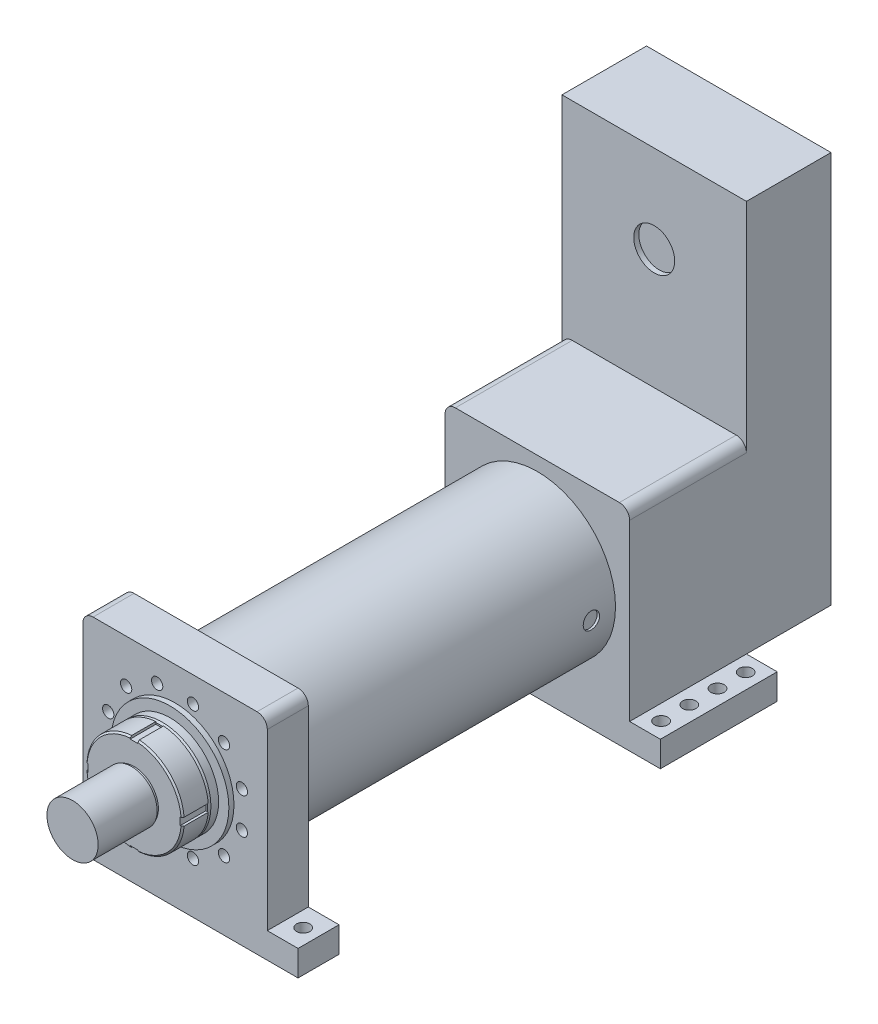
ISO-10303-21;
HEADER;
FILE_DESCRIPTION(('STEP AP214'),'2;1');
FILE_NAME('part.step','',(''),(''),'','','');
FILE_SCHEMA(('AUTOMOTIVE_DESIGN { 1 0 10303 214 1 1 1 1 }'));
ENDSEC;
DATA;
#1=APPLICATION_CONTEXT('core data for automotive mechanical design processes');
#2=APPLICATION_PROTOCOL_DEFINITION('international standard','automotive_design',2000,#1);
#3=PRODUCT_CONTEXT('',#1,'mechanical');
#4=PRODUCT('Part','Part','',(#3));
#5=PRODUCT_RELATED_PRODUCT_CATEGORY('part','',(#4));
#6=PRODUCT_DEFINITION_FORMATION('','',#4);
#7=PRODUCT_DEFINITION_CONTEXT('part definition',#1,'design');
#8=PRODUCT_DEFINITION('design','',#6,#7);
#9=PRODUCT_DEFINITION_SHAPE('','',#8);
#10=(LENGTH_UNIT() NAMED_UNIT(*) SI_UNIT(.MILLI.,.METRE.));
#11=(NAMED_UNIT(*) PLANE_ANGLE_UNIT() SI_UNIT($,.RADIAN.));
#12=(NAMED_UNIT(*) SI_UNIT($,.STERADIAN.) SOLID_ANGLE_UNIT());
#13=UNCERTAINTY_MEASURE_WITH_UNIT(LENGTH_MEASURE(1.E-05),#10,'distance_accuracy_value','');
#14=(GEOMETRIC_REPRESENTATION_CONTEXT(3) GLOBAL_UNCERTAINTY_ASSIGNED_CONTEXT((#13)) GLOBAL_UNIT_ASSIGNED_CONTEXT((#10,
#11,#12)) REPRESENTATION_CONTEXT('',''));
#15=CARTESIAN_POINT('',(0.,0.,0.));
#16=DIRECTION('',(0.,0.,1.));
#17=DIRECTION('',(1.,0.,0.));
#18=AXIS2_PLACEMENT_3D('',#15,#16,#17);
#19=CARTESIAN_POINT('',(0.,0.,737.));
#20=DIRECTION('',(0.,0.,1.));
#21=DIRECTION('',(1.,0.,0.));
#22=AXIS2_PLACEMENT_3D('',#19,#20,#21);
#23=PLANE('',#22);
#24=DIRECTION('',(-1.,0.,0.));
#25=VECTOR('',#24,1.);
#26=CARTESIAN_POINT('',(-90.,-7.5,737.));
#27=LINE('',#26,#25);
#28=CARTESIAN_POINT('',(-90.,-7.5,737.));
#29=VERTEX_POINT('',#28);
#30=CARTESIAN_POINT('',(-92.8778237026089,-7.5,737.));
#31=VERTEX_POINT('',#30);
#32=EDGE_CURVE('E225',#29,#31,#27,.T.);
#33=ORIENTED_EDGE('',*,*,#32,.F.);
#34=DIRECTION('',(0.,-1.,0.));
#35=VECTOR('',#34,1.);
#36=CARTESIAN_POINT('',(-90.,7.5,737.));
#37=LINE('',#36,#35);
#38=CARTESIAN_POINT('',(-90.,7.5,737.));
#39=VERTEX_POINT('',#38);
#40=EDGE_CURVE('E313',#39,#29,#37,.T.);
#41=ORIENTED_EDGE('',*,*,#40,.F.);
#42=DIRECTION('',(1.,0.,0.));
#43=VECTOR('',#42,1.);
#44=CARTESIAN_POINT('',(-90.,7.5,737.));
#45=LINE('',#44,#43);
#46=CARTESIAN_POINT('',(-92.8778237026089,7.5,737.));
#47=VERTEX_POINT('',#46);
#48=EDGE_CURVE('E314',#47,#39,#45,.T.);
#49=ORIENTED_EDGE('',*,*,#48,.F.);
#50=CARTESIAN_POINT('',(0.,0.,737.));
#51=DIRECTION('',(0.,0.,1.));
#52=DIRECTION('',(1.,0.,0.));
#53=AXIS2_PLACEMENT_3D('',#50,#51,#52);
#54=CIRCLE('',#53,93.180148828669);
#55=EDGE_CURVE('E465',#47,#31,#54,.T.);
#56=ORIENTED_EDGE('',*,*,#55,.T.);
#57=EDGE_LOOP('',(#33,#41,#49,#56));
#58=FACE_BOUND('',#57,.T.);
#59=ADVANCED_FACE('F49',(#58),#23,.T.);
#60=DIRECTION('',(0.,1.,0.));
#61=VECTOR('',#60,1.);
#62=CARTESIAN_POINT('',(-7.5,90.,737.));
#63=LINE('',#62,#61);
#64=CARTESIAN_POINT('',(-7.5,90.,737.));
#65=VERTEX_POINT('',#64);
#66=CARTESIAN_POINT('',(-7.5,92.8778237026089,737.));
#67=VERTEX_POINT('',#66);
#68=EDGE_CURVE('E304',#65,#67,#63,.T.);
#69=ORIENTED_EDGE('',*,*,#68,.F.);
#70=DIRECTION('',(-1.,0.,0.));
#71=VECTOR('',#70,1.);
#72=CARTESIAN_POINT('',(-7.5,90.,737.));
#73=LINE('',#72,#71);
#74=CARTESIAN_POINT('',(7.5,90.,737.));
#75=VERTEX_POINT('',#74);
#76=EDGE_CURVE('E299',#75,#65,#73,.T.);
#77=ORIENTED_EDGE('',*,*,#76,.F.);
#78=DIRECTION('',(0.,-1.,0.));
#79=VECTOR('',#78,1.);
#80=CARTESIAN_POINT('',(7.5,90.,737.));
#81=LINE('',#80,#79);
#82=CARTESIAN_POINT('',(7.5,92.8778237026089,737.));
#83=VERTEX_POINT('',#82);
#84=EDGE_CURVE('E300',#83,#75,#81,.T.);
#85=ORIENTED_EDGE('',*,*,#84,.F.);
#86=EDGE_CURVE('E361',#83,#67,#54,.T.);
#87=ORIENTED_EDGE('',*,*,#86,.T.);
#88=EDGE_LOOP('',(#69,#77,#85,#87));
#89=FACE_BOUND('',#88,.T.);
#90=ADVANCED_FACE('F456',(#89),#23,.T.);
#91=DIRECTION('',(1.,0.,0.));
#92=VECTOR('',#91,1.);
#93=CARTESIAN_POINT('',(90.,7.5,737.));
#94=LINE('',#93,#92);
#95=CARTESIAN_POINT('',(90.,7.5,737.));
#96=VERTEX_POINT('',#95);
#97=CARTESIAN_POINT('',(92.8778237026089,7.5,737.));
#98=VERTEX_POINT('',#97);
#99=EDGE_CURVE('E290',#96,#98,#94,.T.);
#100=ORIENTED_EDGE('',*,*,#99,.F.);
#101=DIRECTION('',(0.,1.,0.));
#102=VECTOR('',#101,1.);
#103=CARTESIAN_POINT('',(90.,7.5,737.));
#104=LINE('',#103,#102);
#105=CARTESIAN_POINT('',(90.,-7.5,737.));
#106=VERTEX_POINT('',#105);
#107=EDGE_CURVE('E285',#106,#96,#104,.T.);
#108=ORIENTED_EDGE('',*,*,#107,.F.);
#109=DIRECTION('',(-1.,0.,0.));
#110=VECTOR('',#109,1.);
#111=CARTESIAN_POINT('',(90.,-7.5,737.));
#112=LINE('',#111,#110);
#113=CARTESIAN_POINT('',(92.8778237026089,-7.5,737.));
#114=VERTEX_POINT('',#113);
#115=EDGE_CURVE('E286',#114,#106,#112,.T.);
#116=ORIENTED_EDGE('',*,*,#115,.F.);
#117=EDGE_CURVE('E356',#114,#98,#54,.T.);
#118=ORIENTED_EDGE('',*,*,#117,.T.);
#119=EDGE_LOOP('',(#100,#108,#116,#118));
#120=FACE_BOUND('',#119,.T.);
#121=ADVANCED_FACE('F437',(#120),#23,.T.);
#122=CARTESIAN_POINT('',(0.,0.,737.));
#123=DIRECTION('',(0.,0.,-1.));
#124=DIRECTION('',(-1.,0.,0.));
#125=AXIS2_PLACEMENT_3D('',#122,#123,#124);
#126=CYLINDRICAL_SURFACE('',#125,95.);
#127=CARTESIAN_POINT('',(0.,0.,732.));
#128=DIRECTION('',(0.,0.,1.));
#129=DIRECTION('',(1.,0.,0.));
#130=AXIS2_PLACEMENT_3D('',#127,#128,#129);
#131=CIRCLE('',#130,95.);
#132=CARTESIAN_POINT('',(95.,0.,732.));
#133=VERTEX_POINT('',#132);
#134=EDGE_CURVE('E360',#133,#133,#131,.F.);
#135=ORIENTED_EDGE('',*,*,#134,.T.);
#136=EDGE_LOOP('',(#135));
#137=FACE_BOUND('',#136,.T.);
#138=CARTESIAN_POINT('',(0.,0.,717.));
#139=DIRECTION('',(0.,0.,1.));
#140=DIRECTION('',(1.,0.,0.));
#141=AXIS2_PLACEMENT_3D('',#138,#139,#140);
#142=CIRCLE('',#141,95.);
#143=CARTESIAN_POINT('',(95.,0.,717.));
#144=VERTEX_POINT('',#143);
#145=EDGE_CURVE('E353',#144,#144,#142,.T.);
#146=ORIENTED_EDGE('',*,*,#145,.T.);
#147=EDGE_LOOP('',(#146));
#148=FACE_BOUND('',#147,.T.);
#149=ADVANCED_FACE('F435',(#137,#148),#126,.T.);
#150=DIRECTION('',(0.,-1.,0.));
#151=VECTOR('',#150,1.);
#152=CARTESIAN_POINT('',(7.5,-90.,737.));
#153=LINE('',#152,#151);
#154=CARTESIAN_POINT('',(7.5,-90.,737.));
#155=VERTEX_POINT('',#154);
#156=CARTESIAN_POINT('',(7.5,-92.8778237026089,737.));
#157=VERTEX_POINT('',#156);
#158=EDGE_CURVE('E276',#155,#157,#153,.T.);
#159=ORIENTED_EDGE('',*,*,#158,.F.);
#160=DIRECTION('',(1.,0.,0.));
#161=VECTOR('',#160,1.);
#162=CARTESIAN_POINT('',(-7.5,-90.,737.));
#163=LINE('',#162,#161);
#164=CARTESIAN_POINT('',(-7.5,-90.,737.));
#165=VERTEX_POINT('',#164);
#166=EDGE_CURVE('E273',#165,#155,#163,.T.);
#167=ORIENTED_EDGE('',*,*,#166,.F.);
#168=DIRECTION('',(0.,1.,0.));
#169=VECTOR('',#168,1.);
#170=CARTESIAN_POINT('',(-7.5,-90.,737.));
#171=LINE('',#170,#169);
#172=CARTESIAN_POINT('',(-7.5,-92.8778237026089,737.));
#173=VERTEX_POINT('',#172);
#174=EDGE_CURVE('E232',#173,#165,#171,.T.);
#175=ORIENTED_EDGE('',*,*,#174,.F.);
#176=EDGE_CURVE('E489',#173,#157,#54,.T.);
#177=ORIENTED_EDGE('',*,*,#176,.T.);
#178=EDGE_LOOP('',(#159,#167,#175,#177));
#179=FACE_BOUND('',#178,.T.);
#180=ADVANCED_FACE('F431',(#179),#23,.T.);
#181=CARTESIAN_POINT('',(0.,0.,717.));
#182=DIRECTION('',(0.,0.,1.));
#183=DIRECTION('',(1.,0.,0.));
#184=AXIS2_PLACEMENT_3D('',#181,#182,#183);
#185=PLANE('',#184);
#186=ORIENTED_EDGE('',*,*,#145,.F.);
#187=EDGE_LOOP('',(#186));
#188=FACE_BOUND('',#187,.T.);
#189=ADVANCED_FACE('F434',(#188),#185,.F.);
#190=CARTESIAN_POINT('',(0.,0.,737.));
#191=DIRECTION('',(0.,0.,-1.));
#192=DIRECTION('',(-1.,0.,0.));
#193=AXIS2_PLACEMENT_3D('',#190,#191,#192);
#194=CONICAL_SURFACE('',#193,93.180148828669,0.349065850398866);
#195=ORIENTED_EDGE('',*,*,#134,.F.);
#196=EDGE_LOOP('',(#195));
#197=FACE_BOUND('',#196,.T.);
#198=EDGE_CURVE('E357',#98,#83,#54,.T.);
#199=ORIENTED_EDGE('',*,*,#198,.F.);
#200=ORIENTED_EDGE('',*,*,#117,.F.);
#201=EDGE_CURVE('E492',#157,#114,#54,.T.);
#202=ORIENTED_EDGE('',*,*,#201,.F.);
#203=ORIENTED_EDGE('',*,*,#176,.F.);
#204=EDGE_CURVE('E487',#31,#173,#54,.T.);
#205=ORIENTED_EDGE('',*,*,#204,.F.);
#206=ORIENTED_EDGE('',*,*,#55,.F.);
#207=EDGE_CURVE('E490',#67,#47,#54,.T.);
#208=ORIENTED_EDGE('',*,*,#207,.F.);
#209=ORIENTED_EDGE('',*,*,#86,.F.);
#210=EDGE_LOOP('',(#199,#200,#202,#203,#205,#206,#208,#209));
#211=FACE_BOUND('',#210,.T.);
#212=ADVANCED_FACE('F440',(#197,#211),#194,.T.);
#213=CARTESIAN_POINT('',(0.,0.,737.));
#214=DIRECTION('',(0.,0.,1.));
#215=DIRECTION('',(1.,0.,0.));
#216=AXIS2_PLACEMENT_3D('',#213,#214,#215);
#217=PLANE('',#216);
#218=CARTESIAN_POINT('',(94.7034846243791,7.5,737.));
#219=VERTEX_POINT('',#218);
#220=EDGE_CURVE('E289',#98,#219,#94,.T.);
#221=ORIENTED_EDGE('',*,*,#220,.F.);
#222=ORIENTED_EDGE('',*,*,#198,.T.);
#223=CARTESIAN_POINT('',(7.5,94.7034846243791,737.));
#224=VERTEX_POINT('',#223);
#225=EDGE_CURVE('E296',#224,#83,#81,.T.);
#226=ORIENTED_EDGE('',*,*,#225,.F.);
#227=CARTESIAN_POINT('',(0.,0.,737.));
#228=DIRECTION('',(0.,0.,1.));
#229=DIRECTION('',(1.,0.,0.));
#230=AXIS2_PLACEMENT_3D('',#227,#228,#229);
#231=CIRCLE('',#230,95.);
#232=EDGE_CURVE('E293',#219,#224,#231,.T.);
#233=ORIENTED_EDGE('',*,*,#232,.F.);
#234=EDGE_LOOP('',(#221,#222,#226,#233));
#235=FACE_BOUND('',#234,.T.);
#236=ADVANCED_FACE('F445',(#235),#217,.F.);
#237=CARTESIAN_POINT('',(-7.49999999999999,94.7034846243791,737.));
#238=VERTEX_POINT('',#237);
#239=EDGE_CURVE('E303',#67,#238,#63,.T.);
#240=ORIENTED_EDGE('',*,*,#239,.F.);
#241=ORIENTED_EDGE('',*,*,#207,.T.);
#242=CARTESIAN_POINT('',(-94.7034846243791,7.5,737.));
#243=VERTEX_POINT('',#242);
#244=EDGE_CURVE('E310',#243,#47,#45,.T.);
#245=ORIENTED_EDGE('',*,*,#244,.F.);
#246=CARTESIAN_POINT('',(0.,0.,737.));
#247=DIRECTION('',(0.,0.,1.));
#248=DIRECTION('',(1.,0.,0.));
#249=AXIS2_PLACEMENT_3D('',#246,#247,#248);
#250=CIRCLE('',#249,95.);
#251=EDGE_CURVE('E307',#238,#243,#250,.T.);
#252=ORIENTED_EDGE('',*,*,#251,.F.);
#253=EDGE_LOOP('',(#240,#241,#245,#252));
#254=FACE_BOUND('',#253,.T.);
#255=ADVANCED_FACE('F450',(#254),#217,.F.);
#256=CARTESIAN_POINT('',(-94.7034846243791,-7.5,737.));
#257=VERTEX_POINT('',#256);
#258=EDGE_CURVE('E317',#31,#257,#27,.T.);
#259=ORIENTED_EDGE('',*,*,#258,.F.);
#260=ORIENTED_EDGE('',*,*,#204,.T.);
#261=CARTESIAN_POINT('',(-7.5,-94.7034846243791,737.));
#262=VERTEX_POINT('',#261);
#263=EDGE_CURVE('E270',#262,#173,#171,.T.);
#264=ORIENTED_EDGE('',*,*,#263,.F.);
#265=CARTESIAN_POINT('',(0.,0.,737.));
#266=DIRECTION('',(0.,0.,1.));
#267=DIRECTION('',(1.,0.,0.));
#268=AXIS2_PLACEMENT_3D('',#265,#266,#267);
#269=CIRCLE('',#268,95.);
#270=EDGE_CURVE('E267',#257,#262,#269,.T.);
#271=ORIENTED_EDGE('',*,*,#270,.F.);
#272=EDGE_LOOP('',(#259,#260,#264,#271));
#273=FACE_BOUND('',#272,.T.);
#274=ADVANCED_FACE('F485',(#273),#217,.F.);
#275=CARTESIAN_POINT('',(7.50000000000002,-94.7034846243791,737.));
#276=VERTEX_POINT('',#275);
#277=EDGE_CURVE('E275',#157,#276,#153,.T.);
#278=ORIENTED_EDGE('',*,*,#277,.F.);
#279=ORIENTED_EDGE('',*,*,#201,.T.);
#280=CARTESIAN_POINT('',(94.7034846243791,-7.5,737.));
#281=VERTEX_POINT('',#280);
#282=EDGE_CURVE('E282',#281,#114,#112,.T.);
#283=ORIENTED_EDGE('',*,*,#282,.F.);
#284=CARTESIAN_POINT('',(0.,0.,737.));
#285=DIRECTION('',(0.,0.,1.));
#286=DIRECTION('',(1.,0.,0.));
#287=AXIS2_PLACEMENT_3D('',#284,#285,#286);
#288=CIRCLE('',#287,95.);
#289=EDGE_CURVE('E279',#276,#281,#288,.T.);
#290=ORIENTED_EDGE('',*,*,#289,.F.);
#291=EDGE_LOOP('',(#278,#279,#283,#290));
#292=FACE_BOUND('',#291,.T.);
#293=ADVANCED_FACE('F429',(#292),#217,.F.);
#294=CARTESIAN_POINT('',(0.,0.,787.));
#295=DIRECTION('',(0.,0.,-1.));
#296=DIRECTION('',(-1.,0.,0.));
#297=AXIS2_PLACEMENT_3D('',#294,#295,#296);
#298=CYLINDRICAL_SURFACE('',#297,95.);
#299=DIRECTION('',(0.,0.,-1.));
#300=VECTOR('',#299,1.);
#301=CARTESIAN_POINT('',(-7.5,-94.7034846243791,787.));
#302=LINE('',#301,#300);
#303=CARTESIAN_POINT('',(-7.5,-94.7034846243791,784.));
#304=VERTEX_POINT('',#303);
#305=EDGE_CURVE('E235',#304,#262,#302,.T.);
#306=ORIENTED_EDGE('',*,*,#305,.F.);
#307=CARTESIAN_POINT('',(0.,0.,784.));
#308=DIRECTION('',(0.,0.,1.));
#309=DIRECTION('',(1.,0.,0.));
#310=AXIS2_PLACEMENT_3D('',#307,#308,#309);
#311=CIRCLE('',#310,95.);
#312=CARTESIAN_POINT('',(-94.7034846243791,-7.5,784.));
#313=VERTEX_POINT('',#312);
#314=EDGE_CURVE('E419',#304,#313,#311,.F.);
#315=ORIENTED_EDGE('',*,*,#314,.T.);
#316=DIRECTION('',(0.,0.,-1.));
#317=VECTOR('',#316,1.);
#318=CARTESIAN_POINT('',(-94.7034846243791,-7.5,787.));
#319=LINE('',#318,#317);
#320=EDGE_CURVE('E266',#313,#257,#319,.T.);
#321=ORIENTED_EDGE('',*,*,#320,.T.);
#322=ORIENTED_EDGE('',*,*,#270,.T.);
#323=EDGE_LOOP('',(#306,#315,#321,#322));
#324=FACE_BOUND('',#323,.T.);
#325=ADVANCED_FACE('F426',(#324),#298,.T.);
#326=CARTESIAN_POINT('',(-7.5,-90.,787.));
#327=DIRECTION('',(-1.,0.,0.));
#328=DIRECTION('',(0.,0.,1.));
#329=AXIS2_PLACEMENT_3D('',#326,#327,#328);
#330=PLANE('',#329);
#331=DIRECTION('',(0.,1.,0.));
#332=VECTOR('',#331,1.);
#333=CARTESIAN_POINT('',(-7.5,-90.,787.));
#334=LINE('',#333,#332);
#335=CARTESIAN_POINT('',(-7.5,-91.6937838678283,787.));
#336=VERTEX_POINT('',#335);
#337=CARTESIAN_POINT('',(-7.5,-90.,787.));
#338=VERTEX_POINT('',#337);
#339=EDGE_CURVE('E214',#336,#338,#334,.T.);
#340=ORIENTED_EDGE('',*,*,#339,.F.);
#341=CARTESIAN_POINT('',(-7.5,-91.6937838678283,787.));
#342=CARTESIAN_POINT('',(-7.5,-92.1954266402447,786.500026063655));
#343=CARTESIAN_POINT('',(-7.5,-92.6970564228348,786.000039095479));
#344=CARTESIAN_POINT('',(-7.5,-93.7002900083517,785.000039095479));
#345=CARTESIAN_POINT('',(-7.5,-94.2018938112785,784.500026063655));
#346=CARTESIAN_POINT('',(-7.5,-94.7034846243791,784.));
#347=B_SPLINE_CURVE_WITH_KNOTS('',3,(#341,#342,#343,#344,#345,#346),.UNSPECIFIED.,.F.,.F.,(4,2,
4),(0.,2.12475284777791,4.24950569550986),.UNSPECIFIED.);
#348=EDGE_CURVE('E413',#336,#304,#347,.T.);
#349=ORIENTED_EDGE('',*,*,#348,.T.);
#350=ORIENTED_EDGE('',*,*,#305,.T.);
#351=ORIENTED_EDGE('',*,*,#263,.T.);
#352=ORIENTED_EDGE('',*,*,#174,.T.);
#353=DIRECTION('',(0.,0.,-1.));
#354=VECTOR('',#353,1.);
#355=CARTESIAN_POINT('',(-7.5,-90.,787.));
#356=LINE('',#355,#354);
#357=EDGE_CURVE('E229',#338,#165,#356,.T.);
#358=ORIENTED_EDGE('',*,*,#357,.F.);
#359=EDGE_LOOP('',(#340,#349,#350,#351,#352,#358));
#360=FACE_BOUND('',#359,.T.);
#361=ADVANCED_FACE('F230',(#360),#330,.F.);
#362=CARTESIAN_POINT('',(-7.5,-90.,787.));
#363=DIRECTION('',(0.,1.,0.));
#364=DIRECTION('',(0.,0.,1.));
#365=AXIS2_PLACEMENT_3D('',#362,#363,#364);
#366=PLANE('',#365);
#367=ORIENTED_EDGE('',*,*,#166,.T.);
#368=DIRECTION('',(0.,0.,-1.));
#369=VECTOR('',#368,1.);
#370=CARTESIAN_POINT('',(7.5,-90.,787.));
#371=LINE('',#370,#369);
#372=CARTESIAN_POINT('',(7.5,-90.,787.));
#373=VERTEX_POINT('',#372);
#374=EDGE_CURVE('E236',#373,#155,#371,.T.);
#375=ORIENTED_EDGE('',*,*,#374,.F.);
#376=DIRECTION('',(1.,0.,0.));
#377=VECTOR('',#376,1.);
#378=CARTESIAN_POINT('',(-7.5,-90.,787.));
#379=LINE('',#378,#377);
#380=EDGE_CURVE('E219',#338,#373,#379,.T.);
#381=ORIENTED_EDGE('',*,*,#380,.F.);
#382=ORIENTED_EDGE('',*,*,#357,.T.);
#383=EDGE_LOOP('',(#367,#375,#381,#382));
#384=FACE_BOUND('',#383,.T.);
#385=ADVANCED_FACE('F238',(#384),#366,.F.);
#386=CARTESIAN_POINT('',(7.5,-90.,787.));
#387=DIRECTION('',(1.,0.,0.));
#388=DIRECTION('',(0.,0.,-1.));
#389=AXIS2_PLACEMENT_3D('',#386,#387,#388);
#390=PLANE('',#389);
#391=DIRECTION('',(0.,0.,-1.));
#392=VECTOR('',#391,1.);
#393=CARTESIAN_POINT('',(7.50000000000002,-94.7034846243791,787.));
#394=LINE('',#393,#392);
#395=CARTESIAN_POINT('',(7.50000000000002,-94.7034846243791,784.));
#396=VERTEX_POINT('',#395);
#397=EDGE_CURVE('E349',#396,#276,#394,.T.);
#398=ORIENTED_EDGE('',*,*,#397,.F.);
#399=CARTESIAN_POINT('',(7.50000000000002,-94.7034846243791,784.));
#400=CARTESIAN_POINT('',(7.50000000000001,-94.2018938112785,784.500026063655));
#401=CARTESIAN_POINT('',(7.5,-93.7002900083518,785.000039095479));
#402=CARTESIAN_POINT('',(7.5,-92.6970564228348,786.000039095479));
#403=CARTESIAN_POINT('',(7.5,-92.1954266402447,786.500026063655));
#404=CARTESIAN_POINT('',(7.5,-91.6937838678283,787.));
#405=B_SPLINE_CURVE_WITH_KNOTS('',3,(#399,#400,#401,#402,#403,#404),.UNSPECIFIED.,.F.,.F.,(4,2,
4),(0.,2.12475284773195,4.24950569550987),.UNSPECIFIED.);
#406=CARTESIAN_POINT('',(7.5,-91.6937838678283,787.));
#407=VERTEX_POINT('',#406);
#408=EDGE_CURVE('E407',#396,#407,#405,.T.);
#409=ORIENTED_EDGE('',*,*,#408,.T.);
#410=DIRECTION('',(0.,-1.,0.));
#411=VECTOR('',#410,1.);
#412=CARTESIAN_POINT('',(7.5,-90.,787.));
#413=LINE('',#412,#411);
#414=EDGE_CURVE('E241',#373,#407,#413,.T.);
#415=ORIENTED_EDGE('',*,*,#414,.F.);
#416=ORIENTED_EDGE('',*,*,#374,.T.);
#417=ORIENTED_EDGE('',*,*,#158,.T.);
#418=ORIENTED_EDGE('',*,*,#277,.T.);
#419=EDGE_LOOP('',(#398,#409,#415,#416,#417,#418));
#420=FACE_BOUND('',#419,.T.);
#421=ADVANCED_FACE('F400',(#420),#390,.F.);
#422=CARTESIAN_POINT('',(0.,0.,787.));
#423=DIRECTION('',(0.,0.,-1.));
#424=DIRECTION('',(-1.,0.,0.));
#425=AXIS2_PLACEMENT_3D('',#422,#423,#424);
#426=CYLINDRICAL_SURFACE('',#425,95.);
#427=DIRECTION('',(0.,0.,-1.));
#428=VECTOR('',#427,1.);
#429=CARTESIAN_POINT('',(94.7034846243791,-7.5,787.));
#430=LINE('',#429,#428);
#431=CARTESIAN_POINT('',(94.7034846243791,-7.5,784.));
#432=VERTEX_POINT('',#431);
#433=EDGE_CURVE('E347',#432,#281,#430,.T.);
#434=ORIENTED_EDGE('',*,*,#433,.F.);
#435=CARTESIAN_POINT('',(0.,0.,784.));
#436=DIRECTION('',(0.,0.,1.));
#437=DIRECTION('',(1.,0.,0.));
#438=AXIS2_PLACEMENT_3D('',#435,#436,#437);
#439=CIRCLE('',#438,95.);
#440=EDGE_CURVE('E383',#432,#396,#439,.F.);
#441=ORIENTED_EDGE('',*,*,#440,.T.);
#442=ORIENTED_EDGE('',*,*,#397,.T.);
#443=ORIENTED_EDGE('',*,*,#289,.T.);
#444=EDGE_LOOP('',(#434,#441,#442,#443));
#445=FACE_BOUND('',#444,.T.);
#446=ADVANCED_FACE('F395',(#445),#426,.T.);
#447=CARTESIAN_POINT('',(90.,-7.5,787.));
#448=DIRECTION('',(0.,-1.,0.));
#449=DIRECTION('',(0.,0.,-1.));
#450=AXIS2_PLACEMENT_3D('',#447,#448,#449);
#451=PLANE('',#450);
#452=DIRECTION('',(-1.,0.,0.));
#453=VECTOR('',#452,1.);
#454=CARTESIAN_POINT('',(90.,-7.5,787.));
#455=LINE('',#454,#453);
#456=CARTESIAN_POINT('',(91.6937838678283,-7.5,787.));
#457=VERTEX_POINT('',#456);
#458=CARTESIAN_POINT('',(90.,-7.5,787.));
#459=VERTEX_POINT('',#458);
#460=EDGE_CURVE('E243',#457,#459,#455,.T.);
#461=ORIENTED_EDGE('',*,*,#460,.F.);
#462=CARTESIAN_POINT('',(91.6937838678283,-7.5,787.));
#463=CARTESIAN_POINT('',(92.1954266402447,-7.5,786.500026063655));
#464=CARTESIAN_POINT('',(92.6970564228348,-7.5,786.000039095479));
#465=CARTESIAN_POINT('',(93.7002900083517,-7.5,785.000039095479));
#466=CARTESIAN_POINT('',(94.2018938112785,-7.5,784.500026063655));
#467=CARTESIAN_POINT('',(94.7034846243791,-7.5,784.));
#468=B_SPLINE_CURVE_WITH_KNOTS('',3,(#462,#463,#464,#465,#466,#467),.UNSPECIFIED.,.F.,.F.,(4,2,
4),(0.,2.12475284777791,4.24950569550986),.UNSPECIFIED.);
#469=EDGE_CURVE('E375',#457,#432,#468,.T.);
#470=ORIENTED_EDGE('',*,*,#469,.T.);
#471=ORIENTED_EDGE('',*,*,#433,.T.);
#472=ORIENTED_EDGE('',*,*,#282,.T.);
#473=ORIENTED_EDGE('',*,*,#115,.T.);
#474=DIRECTION('',(0.,0.,-1.));
#475=VECTOR('',#474,1.);
#476=CARTESIAN_POINT('',(90.,-7.5,787.));
#477=LINE('',#476,#475);
#478=EDGE_CURVE('E344',#459,#106,#477,.T.);
#479=ORIENTED_EDGE('',*,*,#478,.F.);
#480=EDGE_LOOP('',(#461,#470,#471,#472,#473,#479));
#481=FACE_BOUND('',#480,.T.);
#482=ADVANCED_FACE('F389',(#481),#451,.F.);
#483=CARTESIAN_POINT('',(90.,7.5,787.));
#484=DIRECTION('',(-1.,0.,0.));
#485=DIRECTION('',(0.,0.,1.));
#486=AXIS2_PLACEMENT_3D('',#483,#484,#485);
#487=PLANE('',#486);
#488=ORIENTED_EDGE('',*,*,#107,.T.);
#489=DIRECTION('',(0.,0.,-1.));
#490=VECTOR('',#489,1.);
#491=CARTESIAN_POINT('',(90.,7.5,787.));
#492=LINE('',#491,#490);
#493=CARTESIAN_POINT('',(90.,7.5,787.));
#494=VERTEX_POINT('',#493);
#495=EDGE_CURVE('E341',#494,#96,#492,.T.);
#496=ORIENTED_EDGE('',*,*,#495,.F.);
#497=DIRECTION('',(0.,1.,0.));
#498=VECTOR('',#497,1.);
#499=CARTESIAN_POINT('',(90.,7.5,787.));
#500=LINE('',#499,#498);
#501=EDGE_CURVE('E248',#459,#494,#500,.T.);
#502=ORIENTED_EDGE('',*,*,#501,.F.);
#503=ORIENTED_EDGE('',*,*,#478,.T.);
#504=EDGE_LOOP('',(#488,#496,#502,#503));
#505=FACE_BOUND('',#504,.T.);
#506=ADVANCED_FACE('F394',(#505),#487,.F.);
#507=CARTESIAN_POINT('',(90.,7.5,787.));
#508=DIRECTION('',(0.,1.,0.));
#509=DIRECTION('',(0.,0.,1.));
#510=AXIS2_PLACEMENT_3D('',#507,#508,#509);
#511=PLANE('',#510);
#512=DIRECTION('',(0.,0.,-1.));
#513=VECTOR('',#512,1.);
#514=CARTESIAN_POINT('',(94.7034846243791,7.5,787.));
#515=LINE('',#514,#513);
#516=CARTESIAN_POINT('',(94.7034846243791,7.5,784.));
#517=VERTEX_POINT('',#516);
#518=EDGE_CURVE('E339',#517,#219,#515,.T.);
#519=ORIENTED_EDGE('',*,*,#518,.F.);
#520=CARTESIAN_POINT('',(94.7034846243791,7.5,784.));
#521=CARTESIAN_POINT('',(94.2018938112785,7.5,784.500026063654));
#522=CARTESIAN_POINT('',(93.7002900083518,7.5,785.000039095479));
#523=CARTESIAN_POINT('',(92.6970564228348,7.5,786.000039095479));
#524=CARTESIAN_POINT('',(92.1954266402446,7.5,786.500026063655));
#525=CARTESIAN_POINT('',(91.6937838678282,7.5,787.));
#526=B_SPLINE_CURVE_WITH_KNOTS('',3,(#520,#521,#522,#523,#524,#525),.UNSPECIFIED.,.F.,.F.,(4,2,
4),(0.,2.12475284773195,4.24950569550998),.UNSPECIFIED.);
#527=CARTESIAN_POINT('',(91.6937838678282,7.5,787.));
#528=VERTEX_POINT('',#527);
#529=EDGE_CURVE('E589',#517,#528,#526,.T.);
#530=ORIENTED_EDGE('',*,*,#529,.T.);
#531=DIRECTION('',(1.,0.,0.));
#532=VECTOR('',#531,1.);
#533=CARTESIAN_POINT('',(90.,7.5,787.));
#534=LINE('',#533,#532);
#535=EDGE_CURVE('E250',#494,#528,#534,.T.);
#536=ORIENTED_EDGE('',*,*,#535,.F.);
#537=ORIENTED_EDGE('',*,*,#495,.T.);
#538=ORIENTED_EDGE('',*,*,#99,.T.);
#539=ORIENTED_EDGE('',*,*,#220,.T.);
#540=EDGE_LOOP('',(#519,#530,#536,#537,#538,#539));
#541=FACE_BOUND('',#540,.T.);
#542=ADVANCED_FACE('F509',(#541),#511,.F.);
#543=CARTESIAN_POINT('',(0.,0.,787.));
#544=DIRECTION('',(0.,0.,-1.));
#545=DIRECTION('',(-1.,0.,0.));
#546=AXIS2_PLACEMENT_3D('',#543,#544,#545);
#547=CYLINDRICAL_SURFACE('',#546,95.);
#548=DIRECTION('',(0.,0.,-1.));
#549=VECTOR('',#548,1.);
#550=CARTESIAN_POINT('',(7.5,94.7034846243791,787.));
#551=LINE('',#550,#549);
#552=CARTESIAN_POINT('',(7.5,94.7034846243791,784.));
#553=VERTEX_POINT('',#552);
#554=EDGE_CURVE('E337',#553,#224,#551,.T.);
#555=ORIENTED_EDGE('',*,*,#554,.F.);
#556=CARTESIAN_POINT('',(0.,0.,784.));
#557=DIRECTION('',(0.,0.,1.));
#558=DIRECTION('',(1.,0.,0.));
#559=AXIS2_PLACEMENT_3D('',#556,#557,#558);
#560=CIRCLE('',#559,95.);
#561=EDGE_CURVE('E574',#553,#517,#560,.F.);
#562=ORIENTED_EDGE('',*,*,#561,.T.);
#563=ORIENTED_EDGE('',*,*,#518,.T.);
#564=ORIENTED_EDGE('',*,*,#232,.T.);
#565=EDGE_LOOP('',(#555,#562,#563,#564));
#566=FACE_BOUND('',#565,.T.);
#567=ADVANCED_FACE('F584',(#566),#547,.T.);
#568=CARTESIAN_POINT('',(7.5,90.,787.));
#569=DIRECTION('',(1.,0.,0.));
#570=DIRECTION('',(0.,0.,-1.));
#571=AXIS2_PLACEMENT_3D('',#568,#569,#570);
#572=PLANE('',#571);
#573=DIRECTION('',(0.,-1.,0.));
#574=VECTOR('',#573,1.);
#575=CARTESIAN_POINT('',(7.5,90.,787.));
#576=LINE('',#575,#574);
#577=CARTESIAN_POINT('',(7.5,91.6937838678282,787.));
#578=VERTEX_POINT('',#577);
#579=CARTESIAN_POINT('',(7.5,90.,787.));
#580=VERTEX_POINT('',#579);
#581=EDGE_CURVE('E253',#578,#580,#576,.T.);
#582=ORIENTED_EDGE('',*,*,#581,.F.);
#583=CARTESIAN_POINT('',(7.5,91.6937838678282,787.));
#584=CARTESIAN_POINT('',(7.5,92.1954266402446,786.500026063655));
#585=CARTESIAN_POINT('',(7.5,92.6970564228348,786.000039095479));
#586=CARTESIAN_POINT('',(7.5,93.7002900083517,785.000039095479));
#587=CARTESIAN_POINT('',(7.5,94.2018938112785,784.500026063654));
#588=CARTESIAN_POINT('',(7.5,94.7034846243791,784.));
#589=B_SPLINE_CURVE_WITH_KNOTS('',3,(#583,#584,#585,#586,#587,#588),.UNSPECIFIED.,.F.,.F.,(4,2,
4),(0.,2.12475284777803,4.24950569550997),.UNSPECIFIED.);
#590=EDGE_CURVE('E567',#578,#553,#589,.T.);
#591=ORIENTED_EDGE('',*,*,#590,.T.);
#592=ORIENTED_EDGE('',*,*,#554,.T.);
#593=ORIENTED_EDGE('',*,*,#225,.T.);
#594=ORIENTED_EDGE('',*,*,#84,.T.);
#595=DIRECTION('',(0.,0.,-1.));
#596=VECTOR('',#595,1.);
#597=CARTESIAN_POINT('',(7.5,90.,787.));
#598=LINE('',#597,#596);
#599=EDGE_CURVE('E334',#580,#75,#598,.T.);
#600=ORIENTED_EDGE('',*,*,#599,.F.);
#601=EDGE_LOOP('',(#582,#591,#592,#593,#594,#600));
#602=FACE_BOUND('',#601,.T.);
#603=ADVANCED_FACE('F578',(#602),#572,.F.);
#604=CARTESIAN_POINT('',(-7.5,90.,787.));
#605=DIRECTION('',(0.,-1.,0.));
#606=DIRECTION('',(0.,0.,-1.));
#607=AXIS2_PLACEMENT_3D('',#604,#605,#606);
#608=PLANE('',#607);
#609=ORIENTED_EDGE('',*,*,#76,.T.);
#610=DIRECTION('',(0.,0.,-1.));
#611=VECTOR('',#610,1.);
#612=CARTESIAN_POINT('',(-7.5,90.,787.));
#613=LINE('',#612,#611);
#614=CARTESIAN_POINT('',(-7.5,90.,787.));
#615=VERTEX_POINT('',#614);
#616=EDGE_CURVE('E331',#615,#65,#613,.T.);
#617=ORIENTED_EDGE('',*,*,#616,.F.);
#618=DIRECTION('',(-1.,0.,0.));
#619=VECTOR('',#618,1.);
#620=CARTESIAN_POINT('',(-7.5,90.,787.));
#621=LINE('',#620,#619);
#622=EDGE_CURVE('E255',#580,#615,#621,.T.);
#623=ORIENTED_EDGE('',*,*,#622,.F.);
#624=ORIENTED_EDGE('',*,*,#599,.T.);
#625=EDGE_LOOP('',(#609,#617,#623,#624));
#626=FACE_BOUND('',#625,.T.);
#627=ADVANCED_FACE('F583',(#626),#608,.F.);
#628=CARTESIAN_POINT('',(-7.5,90.,787.));
#629=DIRECTION('',(-1.,0.,0.));
#630=DIRECTION('',(0.,0.,1.));
#631=AXIS2_PLACEMENT_3D('',#628,#629,#630);
#632=PLANE('',#631);
#633=DIRECTION('',(0.,0.,-1.));
#634=VECTOR('',#633,1.);
#635=CARTESIAN_POINT('',(-7.49999999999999,94.7034846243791,787.));
#636=LINE('',#635,#634);
#637=CARTESIAN_POINT('',(-7.49999999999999,94.7034846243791,784.));
#638=VERTEX_POINT('',#637);
#639=EDGE_CURVE('E329',#638,#238,#636,.T.);
#640=ORIENTED_EDGE('',*,*,#639,.F.);
#641=CARTESIAN_POINT('',(-7.49999999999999,94.7034846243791,784.));
#642=CARTESIAN_POINT('',(-7.49999999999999,94.2018938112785,784.500026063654));
#643=CARTESIAN_POINT('',(-7.5,93.7002900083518,785.000039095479));
#644=CARTESIAN_POINT('',(-7.5,92.6970564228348,786.000039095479));
#645=CARTESIAN_POINT('',(-7.5,92.1954266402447,786.500026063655));
#646=CARTESIAN_POINT('',(-7.5,91.6937838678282,787.));
#647=B_SPLINE_CURVE_WITH_KNOTS('',3,(#641,#642,#643,#644,#645,#646),.UNSPECIFIED.,.F.,.F.,(4,2,
4),(0.,2.12475284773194,4.24950569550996),.UNSPECIFIED.);
#648=CARTESIAN_POINT('',(-7.5,91.6937838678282,787.));
#649=VERTEX_POINT('',#648);
#650=EDGE_CURVE('E12',#638,#649,#647,.T.);
#651=ORIENTED_EDGE('',*,*,#650,.T.);
#652=DIRECTION('',(0.,1.,0.));
#653=VECTOR('',#652,1.);
#654=CARTESIAN_POINT('',(-7.5,90.,787.));
#655=LINE('',#654,#653);
#656=EDGE_CURVE('E257',#615,#649,#655,.T.);
#657=ORIENTED_EDGE('',*,*,#656,.F.);
#658=ORIENTED_EDGE('',*,*,#616,.T.);
#659=ORIENTED_EDGE('',*,*,#68,.T.);
#660=ORIENTED_EDGE('',*,*,#239,.T.);
#661=EDGE_LOOP('',(#640,#651,#657,#658,#659,#660));
#662=FACE_BOUND('',#661,.T.);
#663=ADVANCED_FACE('F605',(#662),#632,.F.);
#664=CARTESIAN_POINT('',(0.,0.,787.));
#665=DIRECTION('',(0.,0.,-1.));
#666=DIRECTION('',(-1.,0.,0.));
#667=AXIS2_PLACEMENT_3D('',#664,#665,#666);
#668=CYLINDRICAL_SURFACE('',#667,95.);
#669=DIRECTION('',(0.,0.,-1.));
#670=VECTOR('',#669,1.);
#671=CARTESIAN_POINT('',(-94.7034846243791,7.5,787.));
#672=LINE('',#671,#670);
#673=CARTESIAN_POINT('',(-94.7034846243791,7.5,784.));
#674=VERTEX_POINT('',#673);
#675=EDGE_CURVE('E327',#674,#243,#672,.T.);
#676=ORIENTED_EDGE('',*,*,#675,.F.);
#677=CARTESIAN_POINT('',(0.,0.,784.));
#678=DIRECTION('',(0.,0.,1.));
#679=DIRECTION('',(1.,0.,0.));
#680=AXIS2_PLACEMENT_3D('',#677,#678,#679);
#681=CIRCLE('',#680,95.);
#682=EDGE_CURVE('E63',#674,#638,#681,.F.);
#683=ORIENTED_EDGE('',*,*,#682,.T.);
#684=ORIENTED_EDGE('',*,*,#639,.T.);
#685=ORIENTED_EDGE('',*,*,#251,.T.);
#686=EDGE_LOOP('',(#676,#683,#684,#685));
#687=FACE_BOUND('',#686,.T.);
#688=ADVANCED_FACE('F603',(#687),#668,.T.);
#689=CARTESIAN_POINT('',(-90.,7.5,787.));
#690=DIRECTION('',(0.,1.,0.));
#691=DIRECTION('',(0.,0.,1.));
#692=AXIS2_PLACEMENT_3D('',#689,#690,#691);
#693=PLANE('',#692);
#694=DIRECTION('',(1.,0.,0.));
#695=VECTOR('',#694,1.);
#696=CARTESIAN_POINT('',(-90.,7.5,787.));
#697=LINE('',#696,#695);
#698=CARTESIAN_POINT('',(-91.6937838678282,7.5,787.));
#699=VERTEX_POINT('',#698);
#700=CARTESIAN_POINT('',(-90.,7.5,787.));
#701=VERTEX_POINT('',#700);
#702=EDGE_CURVE('E260',#699,#701,#697,.T.);
#703=ORIENTED_EDGE('',*,*,#702,.F.);
#704=CARTESIAN_POINT('',(-91.6937838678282,7.5,787.));
#705=CARTESIAN_POINT('',(-92.1954266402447,7.5,786.500026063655));
#706=CARTESIAN_POINT('',(-92.6970564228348,7.5,786.000039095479));
#707=CARTESIAN_POINT('',(-93.7002900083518,7.5,785.000039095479));
#708=CARTESIAN_POINT('',(-94.2018938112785,7.5,784.500026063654));
#709=CARTESIAN_POINT('',(-94.7034846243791,7.5,784.));
#710=B_SPLINE_CURVE_WITH_KNOTS('',3,(#704,#705,#706,#707,#708,#709),.UNSPECIFIED.,.F.,.F.,(4,2,
4),(0.,2.12475284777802,4.24950569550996),.UNSPECIFIED.);
#711=EDGE_CURVE('E77',#699,#674,#710,.T.);
#712=ORIENTED_EDGE('',*,*,#711,.T.);
#713=ORIENTED_EDGE('',*,*,#675,.T.);
#714=ORIENTED_EDGE('',*,*,#244,.T.);
#715=ORIENTED_EDGE('',*,*,#48,.T.);
#716=DIRECTION('',(0.,0.,-1.));
#717=VECTOR('',#716,1.);
#718=CARTESIAN_POINT('',(-90.,7.5,787.));
#719=LINE('',#718,#717);
#720=EDGE_CURVE('E324',#701,#39,#719,.T.);
#721=ORIENTED_EDGE('',*,*,#720,.F.);
#722=EDGE_LOOP('',(#703,#712,#713,#714,#715,#721));
#723=FACE_BOUND('',#722,.T.);
#724=ADVANCED_FACE('F599',(#723),#693,.F.);
#725=CARTESIAN_POINT('',(-90.,7.5,787.));
#726=DIRECTION('',(1.,0.,0.));
#727=DIRECTION('',(0.,0.,-1.));
#728=AXIS2_PLACEMENT_3D('',#725,#726,#727);
#729=PLANE('',#728);
#730=ORIENTED_EDGE('',*,*,#40,.T.);
#731=DIRECTION('',(0.,0.,-1.));
#732=VECTOR('',#731,1.);
#733=CARTESIAN_POINT('',(-90.,-7.5,787.));
#734=LINE('',#733,#732);
#735=CARTESIAN_POINT('',(-90.,-7.5,787.));
#736=VERTEX_POINT('',#735);
#737=EDGE_CURVE('E321',#736,#29,#734,.T.);
#738=ORIENTED_EDGE('',*,*,#737,.F.);
#739=DIRECTION('',(0.,-1.,0.));
#740=VECTOR('',#739,1.);
#741=CARTESIAN_POINT('',(-90.,7.5,787.));
#742=LINE('',#741,#740);
#743=EDGE_CURVE('E262',#701,#736,#742,.T.);
#744=ORIENTED_EDGE('',*,*,#743,.F.);
#745=ORIENTED_EDGE('',*,*,#720,.T.);
#746=EDGE_LOOP('',(#730,#738,#744,#745));
#747=FACE_BOUND('',#746,.T.);
#748=ADVANCED_FACE('F471',(#747),#729,.F.);
#749=CARTESIAN_POINT('',(-90.,-7.5,787.));
#750=DIRECTION('',(0.,-1.,0.));
#751=DIRECTION('',(0.,0.,-1.));
#752=AXIS2_PLACEMENT_3D('',#749,#750,#751);
#753=PLANE('',#752);
#754=ORIENTED_EDGE('',*,*,#320,.F.);
#755=CARTESIAN_POINT('',(-94.7034846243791,-7.5,784.));
#756=CARTESIAN_POINT('',(-94.2018938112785,-7.5,784.500026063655));
#757=CARTESIAN_POINT('',(-93.7002900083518,-7.5,785.000039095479));
#758=CARTESIAN_POINT('',(-92.6970564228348,-7.5,786.000039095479));
#759=CARTESIAN_POINT('',(-92.1954266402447,-7.5,786.500026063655));
#760=CARTESIAN_POINT('',(-91.6937838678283,-7.5,787.));
#761=B_SPLINE_CURVE_WITH_KNOTS('',3,(#755,#756,#757,#758,#759,#760),.UNSPECIFIED.,.F.,.F.,(4,2,
4),(0.,2.12475284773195,4.24950569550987),.UNSPECIFIED.);
#762=CARTESIAN_POINT('',(-91.6937838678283,-7.5,787.));
#763=VERTEX_POINT('',#762);
#764=EDGE_CURVE('E478',#313,#763,#761,.T.);
#765=ORIENTED_EDGE('',*,*,#764,.T.);
#766=DIRECTION('',(-1.,0.,0.));
#767=VECTOR('',#766,1.);
#768=CARTESIAN_POINT('',(-90.,-7.5,787.));
#769=LINE('',#768,#767);
#770=EDGE_CURVE('E264',#736,#763,#769,.T.);
#771=ORIENTED_EDGE('',*,*,#770,.F.);
#772=ORIENTED_EDGE('',*,*,#737,.T.);
#773=ORIENTED_EDGE('',*,*,#32,.T.);
#774=ORIENTED_EDGE('',*,*,#258,.T.);
#775=EDGE_LOOP('',(#754,#765,#771,#772,#773,#774));
#776=FACE_BOUND('',#775,.T.);
#777=ADVANCED_FACE('F476',(#776),#753,.F.);
#778=CARTESIAN_POINT('',(0.,0.,787.));
#779=DIRECTION('',(0.,0.,1.));
#780=DIRECTION('',(1.,0.,0.));
#781=AXIS2_PLACEMENT_3D('',#778,#779,#780);
#782=PLANE('',#781);
#783=CARTESIAN_POINT('',(0.,0.,787.));
#784=DIRECTION('',(0.,0.,1.));
#785=DIRECTION('',(1.,0.,0.));
#786=AXIS2_PLACEMENT_3D('',#783,#784,#785);
#787=CIRCLE('',#786,47.5);
#788=CARTESIAN_POINT('',(47.5,0.,787.));
#789=VERTEX_POINT('',#788);
#790=EDGE_CURVE('E368',#789,#789,#787,.T.);
#791=ORIENTED_EDGE('',*,*,#790,.F.);
#792=EDGE_LOOP('',(#791));
#793=FACE_BOUND('',#792,.T.);
#794=ORIENTED_EDGE('',*,*,#414,.T.);
#795=CARTESIAN_POINT('',(0.,0.,787.));
#796=DIRECTION('',(0.,0.,1.));
#797=DIRECTION('',(1.,0.,0.));
#798=AXIS2_PLACEMENT_3D('',#795,#796,#797);
#799=CIRCLE('',#798,92.);
#800=EDGE_CURVE('E372',#407,#457,#799,.T.);
#801=ORIENTED_EDGE('',*,*,#800,.T.);
#802=ORIENTED_EDGE('',*,*,#460,.T.);
#803=ORIENTED_EDGE('',*,*,#501,.T.);
#804=ORIENTED_EDGE('',*,*,#535,.T.);
#805=CARTESIAN_POINT('',(0.,0.,787.));
#806=DIRECTION('',(0.,0.,1.));
#807=DIRECTION('',(1.,0.,0.));
#808=AXIS2_PLACEMENT_3D('',#805,#806,#807);
#809=CIRCLE('',#808,92.);
#810=EDGE_CURVE('E367',#528,#578,#809,.T.);
#811=ORIENTED_EDGE('',*,*,#810,.T.);
#812=ORIENTED_EDGE('',*,*,#581,.T.);
#813=ORIENTED_EDGE('',*,*,#622,.T.);
#814=ORIENTED_EDGE('',*,*,#656,.T.);
#815=CARTESIAN_POINT('',(0.,0.,787.));
#816=DIRECTION('',(0.,0.,1.));
#817=DIRECTION('',(1.,0.,0.));
#818=AXIS2_PLACEMENT_3D('',#815,#816,#817);
#819=CIRCLE('',#818,92.);
#820=EDGE_CURVE('E364',#649,#699,#819,.T.);
#821=ORIENTED_EDGE('',*,*,#820,.T.);
#822=ORIENTED_EDGE('',*,*,#702,.T.);
#823=ORIENTED_EDGE('',*,*,#743,.T.);
#824=ORIENTED_EDGE('',*,*,#770,.T.);
#825=CARTESIAN_POINT('',(0.,0.,787.));
#826=DIRECTION('',(0.,0.,1.));
#827=DIRECTION('',(1.,0.,0.));
#828=AXIS2_PLACEMENT_3D('',#825,#826,#827);
#829=CIRCLE('',#828,92.);
#830=EDGE_CURVE('E223',#763,#336,#829,.T.);
#831=ORIENTED_EDGE('',*,*,#830,.T.);
#832=ORIENTED_EDGE('',*,*,#339,.T.);
#833=ORIENTED_EDGE('',*,*,#380,.T.);
#834=EDGE_LOOP('',(#794,#801,#802,#803,#804,#811,#812,#813,#814,#821,#822,#823,#824,#831,#832,#833));
#835=FACE_BOUND('',#834,.T.);
#836=ADVANCED_FACE('F217',(#793,#835),#782,.T.);
#837=CARTESIAN_POINT('',(0.,0.,792.));
#838=DIRECTION('',(0.,0.,-1.));
#839=DIRECTION('',(-1.,0.,0.));
#840=AXIS2_PLACEMENT_3D('',#837,#838,#839);
#841=CYLINDRICAL_SURFACE('',#840,47.5);
#842=CARTESIAN_POINT('',(0.,0.,792.));
#843=DIRECTION('',(0.,0.,1.));
#844=DIRECTION('',(1.,0.,0.));
#845=AXIS2_PLACEMENT_3D('',#842,#843,#844);
#846=CIRCLE('',#845,47.5);
#847=CARTESIAN_POINT('',(47.5,0.,792.));
#848=VERTEX_POINT('',#847);
#849=EDGE_CURVE('E271',#848,#848,#846,.T.);
#850=ORIENTED_EDGE('',*,*,#849,.F.);
#851=EDGE_LOOP('',(#850));
#852=FACE_BOUND('',#851,.T.);
#853=ORIENTED_EDGE('',*,*,#790,.T.);
#854=EDGE_LOOP('',(#853));
#855=FACE_BOUND('',#854,.T.);
#856=ADVANCED_FACE('F537',(#852,#855),#841,.T.);
#857=CARTESIAN_POINT('',(0.,0.,907.));
#858=DIRECTION('',(0.,0.,-1.));
#859=DIRECTION('',(-1.,0.,0.));
#860=AXIS2_PLACEMENT_3D('',#857,#858,#859);
#861=CYLINDRICAL_SURFACE('',#860,50.);
#862=CARTESIAN_POINT('',(0.,0.,907.));
#863=DIRECTION('',(0.,0.,1.));
#864=DIRECTION('',(1.,0.,0.));
#865=AXIS2_PLACEMENT_3D('',#862,#863,#864);
#866=CIRCLE('',#865,50.);
#867=CARTESIAN_POINT('',(50.,0.,907.));
#868=VERTEX_POINT('',#867);
#869=EDGE_CURVE('E525',#868,#868,#866,.T.);
#870=ORIENTED_EDGE('',*,*,#869,.F.);
#871=EDGE_LOOP('',(#870));
#872=FACE_BOUND('',#871,.T.);
#873=CARTESIAN_POINT('',(0.,0.,792.));
#874=DIRECTION('',(0.,0.,1.));
#875=DIRECTION('',(1.,0.,0.));
#876=AXIS2_PLACEMENT_3D('',#873,#874,#875);
#877=CIRCLE('',#876,50.);
#878=CARTESIAN_POINT('',(50.,0.,792.));
#879=VERTEX_POINT('',#878);
#880=EDGE_CURVE('E526',#879,#879,#877,.T.);
#881=ORIENTED_EDGE('',*,*,#880,.T.);
#882=EDGE_LOOP('',(#881));
#883=FACE_BOUND('',#882,.T.);
#884=ADVANCED_FACE('F534',(#872,#883),#861,.T.);
#885=CARTESIAN_POINT('',(0.,0.,907.));
#886=DIRECTION('',(0.,0.,1.));
#887=DIRECTION('',(1.,0.,0.));
#888=AXIS2_PLACEMENT_3D('',#885,#886,#887);
#889=PLANE('',#888);
#890=ORIENTED_EDGE('',*,*,#869,.T.);
#891=EDGE_LOOP('',(#890));
#892=FACE_BOUND('',#891,.T.);
#893=ADVANCED_FACE('F532',(#892),#889,.T.);
#894=CARTESIAN_POINT('',(0.,0.,792.));
#895=DIRECTION('',(0.,0.,1.));
#896=DIRECTION('',(1.,0.,0.));
#897=AXIS2_PLACEMENT_3D('',#894,#895,#896);
#898=PLANE('',#897);
#899=ORIENTED_EDGE('',*,*,#849,.T.);
#900=EDGE_LOOP('',(#899));
#901=FACE_BOUND('',#900,.T.);
#902=ORIENTED_EDGE('',*,*,#880,.F.);
#903=EDGE_LOOP('',(#902));
#904=FACE_BOUND('',#903,.T.);
#905=ADVANCED_FACE('F541',(#901,#904),#898,.F.);
#906=CARTESIAN_POINT('',(0.,0.,787.));
#907=DIRECTION('',(0.,0.,-1.));
#908=DIRECTION('',(-1.,0.,0.));
#909=AXIS2_PLACEMENT_3D('',#906,#907,#908);
#910=CONICAL_SURFACE('',#909,92.,0.785398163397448);
#911=ORIENTED_EDGE('',*,*,#408,.F.);
#912=ORIENTED_EDGE('',*,*,#440,.F.);
#913=ORIENTED_EDGE('',*,*,#469,.F.);
#914=ORIENTED_EDGE('',*,*,#800,.F.);
#915=EDGE_LOOP('',(#911,#912,#913,#914));
#916=FACE_BOUND('',#915,.T.);
#917=ADVANCED_FACE('F385',(#916),#910,.T.);
#918=CARTESIAN_POINT('',(0.,0.,787.));
#919=DIRECTION('',(0.,0.,-1.));
#920=DIRECTION('',(-1.,0.,0.));
#921=AXIS2_PLACEMENT_3D('',#918,#919,#920);
#922=CONICAL_SURFACE('',#921,92.,0.785398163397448);
#923=ORIENTED_EDGE('',*,*,#764,.F.);
#924=ORIENTED_EDGE('',*,*,#314,.F.);
#925=ORIENTED_EDGE('',*,*,#348,.F.);
#926=ORIENTED_EDGE('',*,*,#830,.F.);
#927=EDGE_LOOP('',(#923,#924,#925,#926));
#928=FACE_BOUND('',#927,.T.);
#929=ADVANCED_FACE('F421',(#928),#922,.T.);
#930=CARTESIAN_POINT('',(0.,0.,787.));
#931=DIRECTION('',(0.,0.,-1.));
#932=DIRECTION('',(-1.,0.,0.));
#933=AXIS2_PLACEMENT_3D('',#930,#931,#932);
#934=CONICAL_SURFACE('',#933,92.,0.785398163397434);
#935=ORIENTED_EDGE('',*,*,#529,.F.);
#936=ORIENTED_EDGE('',*,*,#561,.F.);
#937=ORIENTED_EDGE('',*,*,#590,.F.);
#938=ORIENTED_EDGE('',*,*,#810,.F.);
#939=EDGE_LOOP('',(#935,#936,#937,#938));
#940=FACE_BOUND('',#939,.T.);
#941=ADVANCED_FACE('F576',(#940),#934,.T.);
#942=CARTESIAN_POINT('',(0.,0.,787.));
#943=DIRECTION('',(0.,0.,-1.));
#944=DIRECTION('',(-1.,0.,0.));
#945=AXIS2_PLACEMENT_3D('',#942,#943,#944);
#946=CONICAL_SURFACE('',#945,92.,0.785398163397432);
#947=ORIENTED_EDGE('',*,*,#650,.F.);
#948=ORIENTED_EDGE('',*,*,#682,.F.);
#949=ORIENTED_EDGE('',*,*,#711,.F.);
#950=ORIENTED_EDGE('',*,*,#820,.F.);
#951=EDGE_LOOP('',(#947,#948,#949,#950));
#952=FACE_BOUND('',#951,.T.);
#953=ADVANCED_FACE('F51',(#952),#946,.T.);
#954=CLOSED_SHELL('',(#59,#90,#121,#149,#180,#189,#212,#236,#255,#274,#293,#325,#361,#385,#421,
#446,#482,#506,#542,#567,#603,#627,#663,#688,#724,#748,#777,#836,#856,#884,#893,#905,#917,#929,
#941,#953));
#955=MANIFOLD_SOLID_BREP('B2',#954);
#956=CARTESIAN_POINT('',(0.,-180.,0.));
#957=DIRECTION('',(0.,1.,0.));
#958=DIRECTION('',(0.,0.,1.));
#959=AXIS2_PLACEMENT_3D('',#956,#957,#958);
#960=PLANE('',#959);
#961=CARTESIAN_POINT('',(-210.,-180.,-31.5));
#962=DIRECTION('',(0.,-1.,0.));
#963=DIRECTION('',(0.,0.,-1.));
#964=AXIS2_PLACEMENT_3D('',#961,#962,#963);
#965=CIRCLE('',#964,13.);
#966=CARTESIAN_POINT('',(-210.,-180.,-44.5));
#967=VERTEX_POINT('',#966);
#968=EDGE_CURVE('E1519',#967,#967,#965,.T.);
#969=ORIENTED_EDGE('',*,*,#968,.T.);
#970=EDGE_LOOP('',(#969));
#971=FACE_BOUND('',#970,.T.);
#972=CARTESIAN_POINT('',(-210.,-180.,-141.5));
#973=DIRECTION('',(0.,-1.,0.));
#974=DIRECTION('',(0.,0.,-1.));
#975=AXIS2_PLACEMENT_3D('',#972,#973,#974);
#976=CIRCLE('',#975,13.);
#977=CARTESIAN_POINT('',(-210.,-180.,-154.5));
#978=VERTEX_POINT('',#977);
#979=EDGE_CURVE('E1503',#978,#978,#976,.T.);
#980=ORIENTED_EDGE('',*,*,#979,.T.);
#981=EDGE_LOOP('',(#980));
#982=FACE_BOUND('',#981,.T.);
#983=CARTESIAN_POINT('',(-210.,-180.,-196.5));
#984=DIRECTION('',(0.,-1.,0.));
#985=DIRECTION('',(0.,0.,-1.));
#986=AXIS2_PLACEMENT_3D('',#983,#984,#985);
#987=CIRCLE('',#986,13.);
#988=CARTESIAN_POINT('',(-210.,-180.,-209.5));
#989=VERTEX_POINT('',#988);
#990=EDGE_CURVE('E1495',#989,#989,#987,.T.);
#991=ORIENTED_EDGE('',*,*,#990,.T.);
#992=EDGE_LOOP('',(#991));
#993=FACE_BOUND('',#992,.T.);
#994=CARTESIAN_POINT('',(-210.,-180.,-86.5));
#995=DIRECTION('',(0.,-1.,0.));
#996=DIRECTION('',(0.,0.,-1.));
#997=AXIS2_PLACEMENT_3D('',#994,#995,#996);
#998=CIRCLE('',#997,13.);
#999=CARTESIAN_POINT('',(-210.,-180.,-99.5));
#1000=VERTEX_POINT('',#999);
#1001=EDGE_CURVE('E1511',#1000,#1000,#998,.T.);
#1002=ORIENTED_EDGE('',*,*,#1001,.T.);
#1003=EDGE_LOOP('',(#1002));
#1004=FACE_BOUND('',#1003,.T.);
#1005=DIRECTION('',(-1.,0.,0.));
#1006=VECTOR('',#1005,1.);
#1007=CARTESIAN_POINT('',(-240.,-180.,0.));
#1008=LINE('',#1007,#1006);
#1009=CARTESIAN_POINT('',(-180.,-180.,0.));
#1010=VERTEX_POINT('',#1009);
#1011=CARTESIAN_POINT('',(-240.,-180.,0.));
#1012=VERTEX_POINT('',#1011);
#1013=EDGE_CURVE('E1471',#1010,#1012,#1008,.T.);
#1014=ORIENTED_EDGE('',*,*,#1013,.F.);
#1015=DIRECTION('',(0.,0.,1.));
#1016=VECTOR('',#1015,1.);
#1017=CARTESIAN_POINT('',(-180.,-180.,-228.));
#1018=LINE('',#1017,#1016);
#1019=CARTESIAN_POINT('',(-180.,-180.,-228.));
#1020=VERTEX_POINT('',#1019);
#1021=EDGE_CURVE('E1443',#1020,#1010,#1018,.T.);
#1022=ORIENTED_EDGE('',*,*,#1021,.F.);
#1023=DIRECTION('',(1.,0.,0.));
#1024=VECTOR('',#1023,1.);
#1025=CARTESIAN_POINT('',(-240.,-180.,-228.));
#1026=LINE('',#1025,#1024);
#1027=CARTESIAN_POINT('',(-240.,-180.,-228.));
#1028=VERTEX_POINT('',#1027);
#1029=EDGE_CURVE('E1475',#1028,#1020,#1026,.T.);
#1030=ORIENTED_EDGE('',*,*,#1029,.F.);
#1031=DIRECTION('',(0.,0.,-1.));
#1032=VECTOR('',#1031,1.);
#1033=CARTESIAN_POINT('',(-240.,-180.,-228.));
#1034=LINE('',#1033,#1032);
#1035=EDGE_CURVE('E1479',#1012,#1028,#1034,.T.);
#1036=ORIENTED_EDGE('',*,*,#1035,.F.);
#1037=EDGE_LOOP('',(#1014,#1022,#1030,#1036));
#1038=FACE_BOUND('',#1037,.T.);
#1039=ADVANCED_FACE('F866',(#971,#982,#993,#1004,#1038),#960,.T.);
#1040=CARTESIAN_POINT('',(210.,-180.,-141.5));
#1041=DIRECTION('',(0.,-1.,0.));
#1042=DIRECTION('',(0.,0.,1.));
#1043=AXIS2_PLACEMENT_3D('',#1040,#1041,#1042);
#1044=CIRCLE('',#1043,13.);
#1045=CARTESIAN_POINT('',(210.,-180.,-128.5));
#1046=VERTEX_POINT('',#1045);
#1047=EDGE_CURVE('E1542',#1046,#1046,#1044,.T.);
#1048=ORIENTED_EDGE('',*,*,#1047,.T.);
#1049=EDGE_LOOP('',(#1048));
#1050=FACE_BOUND('',#1049,.T.);
#1051=CARTESIAN_POINT('',(210.,-180.,-31.5));
#1052=DIRECTION('',(0.,-1.,0.));
#1053=DIRECTION('',(0.,0.,1.));
#1054=AXIS2_PLACEMENT_3D('',#1051,#1052,#1053);
#1055=CIRCLE('',#1054,13.);
#1056=CARTESIAN_POINT('',(210.,-180.,-18.5));
#1057=VERTEX_POINT('',#1056);
#1058=EDGE_CURVE('E1526',#1057,#1057,#1055,.T.);
#1059=ORIENTED_EDGE('',*,*,#1058,.T.);
#1060=EDGE_LOOP('',(#1059));
#1061=FACE_BOUND('',#1060,.T.);
#1062=CARTESIAN_POINT('',(210.,-180.,-86.5));
#1063=DIRECTION('',(0.,-1.,0.));
#1064=DIRECTION('',(0.,0.,1.));
#1065=AXIS2_PLACEMENT_3D('',#1062,#1063,#1064);
#1066=CIRCLE('',#1065,13.);
#1067=CARTESIAN_POINT('',(210.,-180.,-73.5));
#1068=VERTEX_POINT('',#1067);
#1069=EDGE_CURVE('E1534',#1068,#1068,#1066,.T.);
#1070=ORIENTED_EDGE('',*,*,#1069,.T.);
#1071=EDGE_LOOP('',(#1070));
#1072=FACE_BOUND('',#1071,.T.);
#1073=CARTESIAN_POINT('',(210.,-180.,-196.5));
#1074=DIRECTION('',(0.,-1.,0.));
#1075=DIRECTION('',(0.,0.,1.));
#1076=AXIS2_PLACEMENT_3D('',#1073,#1074,#1075);
#1077=CIRCLE('',#1076,13.);
#1078=CARTESIAN_POINT('',(210.,-180.,-183.5));
#1079=VERTEX_POINT('',#1078);
#1080=EDGE_CURVE('E1550',#1079,#1079,#1077,.T.);
#1081=ORIENTED_EDGE('',*,*,#1080,.T.);
#1082=EDGE_LOOP('',(#1081));
#1083=FACE_BOUND('',#1082,.T.);
#1084=DIRECTION('',(0.,0.,1.));
#1085=VECTOR('',#1084,1.);
#1086=CARTESIAN_POINT('',(180.,-180.,-228.));
#1087=LINE('',#1086,#1085);
#1088=CARTESIAN_POINT('',(180.,-180.,-228.));
#1089=VERTEX_POINT('',#1088);
#1090=CARTESIAN_POINT('',(180.,-180.,0.));
#1091=VERTEX_POINT('',#1090);
#1092=EDGE_CURVE('E1439',#1089,#1091,#1087,.T.);
#1093=ORIENTED_EDGE('',*,*,#1092,.T.);
#1094=CARTESIAN_POINT('',(240.,-180.,0.));
#1095=VERTEX_POINT('',#1094);
#1096=EDGE_CURVE('E1466',#1095,#1091,#1008,.T.);
#1097=ORIENTED_EDGE('',*,*,#1096,.F.);
#1098=DIRECTION('',(0.,0.,1.));
#1099=VECTOR('',#1098,1.);
#1100=CARTESIAN_POINT('',(240.,-180.,-228.));
#1101=LINE('',#1100,#1099);
#1102=CARTESIAN_POINT('',(240.,-180.,-228.));
#1103=VERTEX_POINT('',#1102);
#1104=EDGE_CURVE('E1472',#1103,#1095,#1101,.T.);
#1105=ORIENTED_EDGE('',*,*,#1104,.F.);
#1106=EDGE_CURVE('E1478',#1089,#1103,#1026,.T.);
#1107=ORIENTED_EDGE('',*,*,#1106,.F.);
#1108=EDGE_LOOP('',(#1093,#1097,#1105,#1107));
#1109=FACE_BOUND('',#1108,.T.);
#1110=ADVANCED_FACE('F1332',(#1050,#1061,#1072,#1083,#1109),#960,.T.);
#1111=CARTESIAN_POINT('',(-180.,180.,-228.));
#1112=DIRECTION('',(1.,0.,0.));
#1113=DIRECTION('',(0.,1.,0.));
#1114=AXIS2_PLACEMENT_3D('',#1111,#1112,#1113);
#1115=PLANE('',#1114);
#1116=DIRECTION('',(0.,1.,0.));
#1117=VECTOR('',#1116,1.);
#1118=CARTESIAN_POINT('',(-180.,180.,0.));
#1119=LINE('',#1118,#1117);
#1120=CARTESIAN_POINT('',(-180.,160.,0.));
#1121=VERTEX_POINT('',#1120);
#1122=EDGE_CURVE('E1081',#1010,#1121,#1119,.T.);
#1123=ORIENTED_EDGE('',*,*,#1122,.T.);
#1124=DIRECTION('',(0.,0.,1.));
#1125=VECTOR('',#1124,1.);
#1126=CARTESIAN_POINT('',(-180.,160.,-228.));
#1127=LINE('',#1126,#1125);
#1128=CARTESIAN_POINT('',(-180.,160.,-228.));
#1129=VERTEX_POINT('',#1128);
#1130=EDGE_CURVE('E1395',#1121,#1129,#1127,.F.);
#1131=ORIENTED_EDGE('',*,*,#1130,.T.);
#1132=DIRECTION('',(0.,-1.,0.));
#1133=VECTOR('',#1132,1.);
#1134=CARTESIAN_POINT('',(-180.,585.,-228.));
#1135=LINE('',#1134,#1133);
#1136=CARTESIAN_POINT('',(-180.,585.,-228.));
#1137=VERTEX_POINT('',#1136);
#1138=EDGE_CURVE('E881',#1137,#1129,#1135,.T.);
#1139=ORIENTED_EDGE('',*,*,#1138,.F.);
#1140=DIRECTION('',(0.,0.,1.));
#1141=VECTOR('',#1140,1.);
#1142=CARTESIAN_POINT('',(-180.,585.,-393.));
#1143=LINE('',#1142,#1141);
#1144=CARTESIAN_POINT('',(-180.,585.,-393.));
#1145=VERTEX_POINT('',#1144);
#1146=EDGE_CURVE('E1558',#1145,#1137,#1143,.T.);
#1147=ORIENTED_EDGE('',*,*,#1146,.F.);
#1148=DIRECTION('',(0.,-1.,0.));
#1149=VECTOR('',#1148,1.);
#1150=CARTESIAN_POINT('',(-180.,585.,-393.));
#1151=LINE('',#1150,#1149);
#1152=CARTESIAN_POINT('',(-180.,-180.,-393.));
#1153=VERTEX_POINT('',#1152);
#1154=EDGE_CURVE('E1591',#1145,#1153,#1151,.T.);
#1155=ORIENTED_EDGE('',*,*,#1154,.T.);
#1156=DIRECTION('',(0.,0.,1.));
#1157=VECTOR('',#1156,1.);
#1158=CARTESIAN_POINT('',(-180.,-180.,-393.));
#1159=LINE('',#1158,#1157);
#1160=EDGE_CURVE('E1561',#1153,#1020,#1159,.T.);
#1161=ORIENTED_EDGE('',*,*,#1160,.T.);
#1162=ORIENTED_EDGE('',*,*,#1021,.T.);
#1163=EDGE_LOOP('',(#1123,#1131,#1139,#1147,#1155,#1161,#1162));
#1164=FACE_BOUND('',#1163,.T.);
#1165=ADVANCED_FACE('F1338',(#1164),#1115,.F.);
#1166=CARTESIAN_POINT('',(180.,180.,-228.));
#1167=DIRECTION('',(0.,-1.,0.));
#1168=DIRECTION('',(0.,0.,-1.));
#1169=AXIS2_PLACEMENT_3D('',#1166,#1167,#1168);
#1170=PLANE('',#1169);
#1171=DIRECTION('',(1.,0.,0.));
#1172=VECTOR('',#1171,1.);
#1173=CARTESIAN_POINT('',(180.,180.,0.));
#1174=LINE('',#1173,#1172);
#1175=CARTESIAN_POINT('',(-160.,180.,0.));
#1176=VERTEX_POINT('',#1175);
#1177=CARTESIAN_POINT('',(160.,180.,0.));
#1178=VERTEX_POINT('',#1177);
#1179=EDGE_CURVE('E1088',#1176,#1178,#1174,.T.);
#1180=ORIENTED_EDGE('',*,*,#1179,.T.);
#1181=DIRECTION('',(0.,0.,1.));
#1182=VECTOR('',#1181,1.);
#1183=CARTESIAN_POINT('',(160.,180.,-228.));
#1184=LINE('',#1183,#1182);
#1185=CARTESIAN_POINT('',(160.,180.,-228.));
#1186=VERTEX_POINT('',#1185);
#1187=EDGE_CURVE('E889',#1178,#1186,#1184,.F.);
#1188=ORIENTED_EDGE('',*,*,#1187,.T.);
#1189=DIRECTION('',(1.,0.,0.));
#1190=VECTOR('',#1189,1.);
#1191=CARTESIAN_POINT('',(180.,180.,-228.));
#1192=LINE('',#1191,#1190);
#1193=CARTESIAN_POINT('',(-160.,180.,-228.));
#1194=VERTEX_POINT('',#1193);
#1195=EDGE_CURVE('E1446',#1194,#1186,#1192,.T.);
#1196=ORIENTED_EDGE('',*,*,#1195,.F.);
#1197=DIRECTION('',(0.,0.,1.));
#1198=VECTOR('',#1197,1.);
#1199=CARTESIAN_POINT('',(-160.,180.,-228.));
#1200=LINE('',#1199,#1198);
#1201=EDGE_CURVE('E1401',#1194,#1176,#1200,.T.);
#1202=ORIENTED_EDGE('',*,*,#1201,.T.);
#1203=EDGE_LOOP('',(#1180,#1188,#1196,#1202));
#1204=FACE_BOUND('',#1203,.T.);
#1205=ADVANCED_FACE('F1366',(#1204),#1170,.F.);
#1206=CARTESIAN_POINT('',(180.,180.,-228.));
#1207=DIRECTION('',(-1.,0.,0.));
#1208=DIRECTION('',(0.,-1.,0.));
#1209=AXIS2_PLACEMENT_3D('',#1206,#1207,#1208);
#1210=PLANE('',#1209);
#1211=DIRECTION('',(0.,-1.,0.));
#1212=VECTOR('',#1211,1.);
#1213=CARTESIAN_POINT('',(180.,585.,-228.));
#1214=LINE('',#1213,#1212);
#1215=CARTESIAN_POINT('',(180.,585.,-228.));
#1216=VERTEX_POINT('',#1215);
#1217=CARTESIAN_POINT('',(180.,160.,-228.));
#1218=VERTEX_POINT('',#1217);
#1219=EDGE_CURVE('E1572',#1216,#1218,#1214,.T.);
#1220=ORIENTED_EDGE('',*,*,#1219,.T.);
#1221=DIRECTION('',(0.,0.,1.));
#1222=VECTOR('',#1221,1.);
#1223=CARTESIAN_POINT('',(180.,160.,-228.));
#1224=LINE('',#1223,#1222);
#1225=CARTESIAN_POINT('',(180.,160.,0.));
#1226=VERTEX_POINT('',#1225);
#1227=EDGE_CURVE('E1392',#1218,#1226,#1224,.T.);
#1228=ORIENTED_EDGE('',*,*,#1227,.T.);
#1229=DIRECTION('',(0.,-1.,0.));
#1230=VECTOR('',#1229,1.);
#1231=CARTESIAN_POINT('',(180.,180.,0.));
#1232=LINE('',#1231,#1230);
#1233=EDGE_CURVE('E1091',#1226,#1091,#1232,.T.);
#1234=ORIENTED_EDGE('',*,*,#1233,.T.);
#1235=ORIENTED_EDGE('',*,*,#1092,.F.);
#1236=DIRECTION('',(0.,0.,1.));
#1237=VECTOR('',#1236,1.);
#1238=CARTESIAN_POINT('',(180.,-180.,-393.));
#1239=LINE('',#1238,#1237);
#1240=CARTESIAN_POINT('',(180.,-180.,-393.));
#1241=VERTEX_POINT('',#1240);
#1242=EDGE_CURVE('E1566',#1241,#1089,#1239,.T.);
#1243=ORIENTED_EDGE('',*,*,#1242,.F.);
#1244=DIRECTION('',(0.,-1.,0.));
#1245=VECTOR('',#1244,1.);
#1246=CARTESIAN_POINT('',(180.,585.,-393.));
#1247=LINE('',#1246,#1245);
#1248=CARTESIAN_POINT('',(180.,585.,-393.));
#1249=VERTEX_POINT('',#1248);
#1250=EDGE_CURVE('E1562',#1249,#1241,#1247,.T.);
#1251=ORIENTED_EDGE('',*,*,#1250,.F.);
#1252=DIRECTION('',(0.,0.,1.));
#1253=VECTOR('',#1252,1.);
#1254=CARTESIAN_POINT('',(180.,585.,-393.));
#1255=LINE('',#1254,#1253);
#1256=EDGE_CURVE('E1554',#1249,#1216,#1255,.T.);
#1257=ORIENTED_EDGE('',*,*,#1256,.T.);
#1258=EDGE_LOOP('',(#1220,#1228,#1234,#1235,#1243,#1251,#1257));
#1259=FACE_BOUND('',#1258,.T.);
#1260=ADVANCED_FACE('F1362',(#1259),#1210,.F.);
#1261=CARTESIAN_POINT('',(0.,0.,-228.));
#1262=DIRECTION('',(0.,0.,-1.));
#1263=DIRECTION('',(-1.,0.,0.));
#1264=AXIS2_PLACEMENT_3D('',#1261,#1262,#1263);
#1265=PLANE('',#1264);
#1266=DIRECTION('',(-1.,0.,0.));
#1267=VECTOR('',#1266,1.);
#1268=CARTESIAN_POINT('',(180.,-180.,-228.));
#1269=LINE('',#1268,#1267);
#1270=EDGE_CURVE('E1576',#1089,#1020,#1269,.T.);
#1271=ORIENTED_EDGE('',*,*,#1270,.F.);
#1272=ORIENTED_EDGE('',*,*,#1106,.T.);
#1273=DIRECTION('',(0.,1.,0.));
#1274=VECTOR('',#1273,1.);
#1275=CARTESIAN_POINT('',(240.,-230.,-228.));
#1276=LINE('',#1275,#1274);
#1277=CARTESIAN_POINT('',(240.,-230.,-228.));
#1278=VERTEX_POINT('',#1277);
#1279=EDGE_CURVE('E1453',#1278,#1103,#1276,.T.);
#1280=ORIENTED_EDGE('',*,*,#1279,.F.);
#1281=DIRECTION('',(1.,0.,0.));
#1282=VECTOR('',#1281,1.);
#1283=CARTESIAN_POINT('',(-240.,-230.,-228.));
#1284=LINE('',#1283,#1282);
#1285=CARTESIAN_POINT('',(-240.,-230.,-228.));
#1286=VERTEX_POINT('',#1285);
#1287=EDGE_CURVE('E1489',#1286,#1278,#1284,.T.);
#1288=ORIENTED_EDGE('',*,*,#1287,.F.);
#1289=DIRECTION('',(0.,1.,0.));
#1290=VECTOR('',#1289,1.);
#1291=CARTESIAN_POINT('',(-240.,-230.,-228.));
#1292=LINE('',#1291,#1290);
#1293=EDGE_CURVE('E1449',#1286,#1028,#1292,.T.);
#1294=ORIENTED_EDGE('',*,*,#1293,.T.);
#1295=ORIENTED_EDGE('',*,*,#1029,.T.);
#1296=EDGE_LOOP('',(#1271,#1272,#1280,#1288,#1294,#1295));
#1297=FACE_BOUND('',#1296,.T.);
#1298=ADVANCED_FACE('F1359',(#1297),#1265,.T.);
#1299=CARTESIAN_POINT('',(0.,-230.,0.));
#1300=DIRECTION('',(0.,1.,0.));
#1301=DIRECTION('',(0.,0.,1.));
#1302=AXIS2_PLACEMENT_3D('',#1299,#1300,#1301);
#1303=PLANE('',#1302);
#1304=DIRECTION('',(0.,0.,-1.));
#1305=VECTOR('',#1304,1.);
#1306=CARTESIAN_POINT('',(-240.,-230.,-228.));
#1307=LINE('',#1306,#1305);
#1308=CARTESIAN_POINT('',(-240.,-230.,0.));
#1309=VERTEX_POINT('',#1308);
#1310=EDGE_CURVE('E1470',#1309,#1286,#1307,.T.);
#1311=ORIENTED_EDGE('',*,*,#1310,.T.);
#1312=ORIENTED_EDGE('',*,*,#1287,.T.);
#1313=DIRECTION('',(0.,0.,1.));
#1314=VECTOR('',#1313,1.);
#1315=CARTESIAN_POINT('',(240.,-230.,-228.));
#1316=LINE('',#1315,#1314);
#1317=CARTESIAN_POINT('',(240.,-230.,0.));
#1318=VERTEX_POINT('',#1317);
#1319=EDGE_CURVE('E1486',#1278,#1318,#1316,.T.);
#1320=ORIENTED_EDGE('',*,*,#1319,.T.);
#1321=DIRECTION('',(-1.,0.,0.));
#1322=VECTOR('',#1321,1.);
#1323=CARTESIAN_POINT('',(-240.,-230.,0.));
#1324=LINE('',#1323,#1322);
#1325=EDGE_CURVE('E1465',#1318,#1309,#1324,.T.);
#1326=ORIENTED_EDGE('',*,*,#1325,.T.);
#1327=EDGE_LOOP('',(#1311,#1312,#1320,#1326));
#1328=FACE_BOUND('',#1327,.T.);
#1329=CARTESIAN_POINT('',(-210.,-230.,-196.5));
#1330=DIRECTION('',(0.,-1.,0.));
#1331=DIRECTION('',(0.,0.,-1.));
#1332=AXIS2_PLACEMENT_3D('',#1329,#1330,#1331);
#1333=CIRCLE('',#1332,13.);
#1334=CARTESIAN_POINT('',(-210.,-230.,-209.5));
#1335=VERTEX_POINT('',#1334);
#1336=EDGE_CURVE('E1483',#1335,#1335,#1333,.T.);
#1337=ORIENTED_EDGE('',*,*,#1336,.F.);
#1338=EDGE_LOOP('',(#1337));
#1339=FACE_BOUND('',#1338,.T.);
#1340=CARTESIAN_POINT('',(-210.,-230.,-141.5));
#1341=DIRECTION('',(0.,-1.,0.));
#1342=DIRECTION('',(0.,0.,-1.));
#1343=AXIS2_PLACEMENT_3D('',#1340,#1341,#1342);
#1344=CIRCLE('',#1343,13.);
#1345=CARTESIAN_POINT('',(-210.,-230.,-154.5));
#1346=VERTEX_POINT('',#1345);
#1347=EDGE_CURVE('E1499',#1346,#1346,#1344,.T.);
#1348=ORIENTED_EDGE('',*,*,#1347,.F.);
#1349=EDGE_LOOP('',(#1348));
#1350=FACE_BOUND('',#1349,.T.);
#1351=CARTESIAN_POINT('',(-210.,-230.,-86.5));
#1352=DIRECTION('',(0.,-1.,0.));
#1353=DIRECTION('',(0.,0.,-1.));
#1354=AXIS2_PLACEMENT_3D('',#1351,#1352,#1353);
#1355=CIRCLE('',#1354,13.);
#1356=CARTESIAN_POINT('',(-210.,-230.,-99.5));
#1357=VERTEX_POINT('',#1356);
#1358=EDGE_CURVE('E1507',#1357,#1357,#1355,.T.);
#1359=ORIENTED_EDGE('',*,*,#1358,.F.);
#1360=EDGE_LOOP('',(#1359));
#1361=FACE_BOUND('',#1360,.T.);
#1362=CARTESIAN_POINT('',(-210.,-230.,-31.5));
#1363=DIRECTION('',(0.,-1.,0.));
#1364=DIRECTION('',(0.,0.,-1.));
#1365=AXIS2_PLACEMENT_3D('',#1362,#1363,#1364);
#1366=CIRCLE('',#1365,13.);
#1367=CARTESIAN_POINT('',(-210.,-230.,-44.5));
#1368=VERTEX_POINT('',#1367);
#1369=EDGE_CURVE('E1515',#1368,#1368,#1366,.T.);
#1370=ORIENTED_EDGE('',*,*,#1369,.F.);
#1371=EDGE_LOOP('',(#1370));
#1372=FACE_BOUND('',#1371,.T.);
#1373=CARTESIAN_POINT('',(210.,-230.,-31.5));
#1374=DIRECTION('',(0.,-1.,0.));
#1375=DIRECTION('',(0.,0.,1.));
#1376=AXIS2_PLACEMENT_3D('',#1373,#1374,#1375);
#1377=CIRCLE('',#1376,13.);
#1378=CARTESIAN_POINT('',(210.,-230.,-18.5));
#1379=VERTEX_POINT('',#1378);
#1380=EDGE_CURVE('E1522',#1379,#1379,#1377,.T.);
#1381=ORIENTED_EDGE('',*,*,#1380,.F.);
#1382=EDGE_LOOP('',(#1381));
#1383=FACE_BOUND('',#1382,.T.);
#1384=CARTESIAN_POINT('',(210.,-230.,-86.5));
#1385=DIRECTION('',(0.,-1.,0.));
#1386=DIRECTION('',(0.,0.,1.));
#1387=AXIS2_PLACEMENT_3D('',#1384,#1385,#1386);
#1388=CIRCLE('',#1387,13.);
#1389=CARTESIAN_POINT('',(210.,-230.,-73.5));
#1390=VERTEX_POINT('',#1389);
#1391=EDGE_CURVE('E1530',#1390,#1390,#1388,.T.);
#1392=ORIENTED_EDGE('',*,*,#1391,.F.);
#1393=EDGE_LOOP('',(#1392));
#1394=FACE_BOUND('',#1393,.T.);
#1395=CARTESIAN_POINT('',(210.,-230.,-141.5));
#1396=DIRECTION('',(0.,-1.,0.));
#1397=DIRECTION('',(0.,0.,1.));
#1398=AXIS2_PLACEMENT_3D('',#1395,#1396,#1397);
#1399=CIRCLE('',#1398,13.);
#1400=CARTESIAN_POINT('',(210.,-230.,-128.5));
#1401=VERTEX_POINT('',#1400);
#1402=EDGE_CURVE('E1538',#1401,#1401,#1399,.T.);
#1403=ORIENTED_EDGE('',*,*,#1402,.F.);
#1404=EDGE_LOOP('',(#1403));
#1405=FACE_BOUND('',#1404,.T.);
#1406=CARTESIAN_POINT('',(210.,-230.,-196.5));
#1407=DIRECTION('',(0.,-1.,0.));
#1408=DIRECTION('',(0.,0.,1.));
#1409=AXIS2_PLACEMENT_3D('',#1406,#1407,#1408);
#1410=CIRCLE('',#1409,13.);
#1411=CARTESIAN_POINT('',(210.,-230.,-183.5));
#1412=VERTEX_POINT('',#1411);
#1413=EDGE_CURVE('E1546',#1412,#1412,#1410,.T.);
#1414=ORIENTED_EDGE('',*,*,#1413,.F.);
#1415=EDGE_LOOP('',(#1414));
#1416=FACE_BOUND('',#1415,.T.);
#1417=ADVANCED_FACE('F1344',(#1328,#1339,#1350,#1361,#1372,#1383,#1394,#1405,#1416),#1303,.F.);
#1418=CARTESIAN_POINT('',(-240.,-230.,-228.));
#1419=DIRECTION('',(1.,0.,0.));
#1420=DIRECTION('',(0.,0.,-1.));
#1421=AXIS2_PLACEMENT_3D('',#1418,#1419,#1420);
#1422=PLANE('',#1421);
#1423=ORIENTED_EDGE('',*,*,#1035,.T.);
#1424=ORIENTED_EDGE('',*,*,#1293,.F.);
#1425=ORIENTED_EDGE('',*,*,#1310,.F.);
#1426=DIRECTION('',(0.,1.,0.));
#1427=VECTOR('',#1426,1.);
#1428=CARTESIAN_POINT('',(-240.,-230.,0.));
#1429=LINE('',#1428,#1427);
#1430=EDGE_CURVE('E1461',#1309,#1012,#1429,.T.);
#1431=ORIENTED_EDGE('',*,*,#1430,.T.);
#1432=EDGE_LOOP('',(#1423,#1424,#1425,#1431));
#1433=FACE_BOUND('',#1432,.T.);
#1434=ADVANCED_FACE('F1354',(#1433),#1422,.F.);
#1435=CARTESIAN_POINT('',(240.,-230.,-228.));
#1436=DIRECTION('',(-1.,0.,0.));
#1437=DIRECTION('',(0.,0.,1.));
#1438=AXIS2_PLACEMENT_3D('',#1435,#1436,#1437);
#1439=PLANE('',#1438);
#1440=ORIENTED_EDGE('',*,*,#1104,.T.);
#1441=DIRECTION('',(0.,1.,0.));
#1442=VECTOR('',#1441,1.);
#1443=CARTESIAN_POINT('',(240.,-230.,0.));
#1444=LINE('',#1443,#1442);
#1445=EDGE_CURVE('E1457',#1318,#1095,#1444,.T.);
#1446=ORIENTED_EDGE('',*,*,#1445,.F.);
#1447=ORIENTED_EDGE('',*,*,#1319,.F.);
#1448=ORIENTED_EDGE('',*,*,#1279,.T.);
#1449=EDGE_LOOP('',(#1440,#1446,#1447,#1448));
#1450=FACE_BOUND('',#1449,.T.);
#1451=ADVANCED_FACE('F1350',(#1450),#1439,.F.);
#1452=CARTESIAN_POINT('',(-240.,-230.,0.));
#1453=DIRECTION('',(0.,0.,-1.));
#1454=DIRECTION('',(-1.,0.,0.));
#1455=AXIS2_PLACEMENT_3D('',#1452,#1453,#1454);
#1456=PLANE('',#1455);
#1457=ORIENTED_EDGE('',*,*,#1233,.F.);
#1458=CARTESIAN_POINT('',(160.,160.,0.));
#1459=DIRECTION('',(0.,0.,-1.));
#1460=DIRECTION('',(-1.,0.,0.));
#1461=AXIS2_PLACEMENT_3D('',#1458,#1459,#1460);
#1462=CIRCLE('',#1461,20.);
#1463=EDGE_CURVE('E1405',#1226,#1178,#1462,.F.);
#1464=ORIENTED_EDGE('',*,*,#1463,.T.);
#1465=ORIENTED_EDGE('',*,*,#1179,.F.);
#1466=CARTESIAN_POINT('',(-160.,160.,0.));
#1467=DIRECTION('',(0.,0.,-1.));
#1468=DIRECTION('',(-1.,0.,0.));
#1469=AXIS2_PLACEMENT_3D('',#1466,#1467,#1468);
#1470=CIRCLE('',#1469,20.);
#1471=EDGE_CURVE('E1408',#1176,#1121,#1470,.F.);
#1472=ORIENTED_EDGE('',*,*,#1471,.T.);
#1473=ORIENTED_EDGE('',*,*,#1122,.F.);
#1474=ORIENTED_EDGE('',*,*,#1013,.T.);
#1475=ORIENTED_EDGE('',*,*,#1430,.F.);
#1476=ORIENTED_EDGE('',*,*,#1325,.F.);
#1477=ORIENTED_EDGE('',*,*,#1445,.T.);
#1478=ORIENTED_EDGE('',*,*,#1096,.T.);
#1479=EDGE_LOOP('',(#1457,#1464,#1465,#1472,#1473,#1474,#1475,#1476,#1477,#1478));
#1480=FACE_BOUND('',#1479,.T.);
#1481=CARTESIAN_POINT('',(0.,0.,0.));
#1482=DIRECTION('',(0.,0.,1.));
#1483=DIRECTION('',(1.,0.,0.));
#1484=AXIS2_PLACEMENT_3D('',#1481,#1482,#1483);
#1485=CIRCLE('',#1484,152.5);
#1486=CARTESIAN_POINT('',(152.5,0.,0.));
#1487=VERTEX_POINT('',#1486);
#1488=EDGE_CURVE('E1094',#1487,#1487,#1485,.T.);
#1489=ORIENTED_EDGE('',*,*,#1488,.F.);
#1490=EDGE_LOOP('',(#1489));
#1491=FACE_BOUND('',#1490,.T.);
#1492=ADVANCED_FACE('F1346',(#1480,#1491),#1456,.F.);
#1493=CARTESIAN_POINT('',(-210.,-230.,-196.5));
#1494=DIRECTION('',(0.,1.,0.));
#1495=DIRECTION('',(0.,0.,1.));
#1496=AXIS2_PLACEMENT_3D('',#1493,#1494,#1495);
#1497=CYLINDRICAL_SURFACE('',#1496,13.);
#1498=ORIENTED_EDGE('',*,*,#1336,.T.);
#1499=EDGE_LOOP('',(#1498));
#1500=FACE_BOUND('',#1499,.T.);
#1501=ORIENTED_EDGE('',*,*,#990,.F.);
#1502=EDGE_LOOP('',(#1501));
#1503=FACE_BOUND('',#1502,.T.);
#1504=ADVANCED_FACE('F1349',(#1500,#1503),#1497,.F.);
#1505=CARTESIAN_POINT('',(-210.,-230.,-141.5));
#1506=DIRECTION('',(0.,1.,0.));
#1507=DIRECTION('',(0.,0.,1.));
#1508=AXIS2_PLACEMENT_3D('',#1505,#1506,#1507);
#1509=CYLINDRICAL_SURFACE('',#1508,13.);
#1510=ORIENTED_EDGE('',*,*,#1347,.T.);
#1511=EDGE_LOOP('',(#1510));
#1512=FACE_BOUND('',#1511,.T.);
#1513=ORIENTED_EDGE('',*,*,#979,.F.);
#1514=EDGE_LOOP('',(#1513));
#1515=FACE_BOUND('',#1514,.T.);
#1516=ADVANCED_FACE('F1706',(#1512,#1515),#1509,.F.);
#1517=CARTESIAN_POINT('',(-210.,-230.,-86.5));
#1518=DIRECTION('',(0.,1.,0.));
#1519=DIRECTION('',(0.,0.,1.));
#1520=AXIS2_PLACEMENT_3D('',#1517,#1518,#1519);
#1521=CYLINDRICAL_SURFACE('',#1520,13.);
#1522=ORIENTED_EDGE('',*,*,#1358,.T.);
#1523=EDGE_LOOP('',(#1522));
#1524=FACE_BOUND('',#1523,.T.);
#1525=ORIENTED_EDGE('',*,*,#1001,.F.);
#1526=EDGE_LOOP('',(#1525));
#1527=FACE_BOUND('',#1526,.T.);
#1528=ADVANCED_FACE('F1702',(#1524,#1527),#1521,.F.);
#1529=CARTESIAN_POINT('',(-210.,-230.,-31.5));
#1530=DIRECTION('',(0.,1.,0.));
#1531=DIRECTION('',(0.,0.,1.));
#1532=AXIS2_PLACEMENT_3D('',#1529,#1530,#1531);
#1533=CYLINDRICAL_SURFACE('',#1532,13.);
#1534=ORIENTED_EDGE('',*,*,#1369,.T.);
#1535=EDGE_LOOP('',(#1534));
#1536=FACE_BOUND('',#1535,.T.);
#1537=ORIENTED_EDGE('',*,*,#968,.F.);
#1538=EDGE_LOOP('',(#1537));
#1539=FACE_BOUND('',#1538,.T.);
#1540=ADVANCED_FACE('F1698',(#1536,#1539),#1533,.F.);
#1541=CARTESIAN_POINT('',(210.,-230.,-31.5));
#1542=DIRECTION('',(0.,1.,0.));
#1543=DIRECTION('',(0.,0.,1.));
#1544=AXIS2_PLACEMENT_3D('',#1541,#1542,#1543);
#1545=CYLINDRICAL_SURFACE('',#1544,13.);
#1546=ORIENTED_EDGE('',*,*,#1380,.T.);
#1547=EDGE_LOOP('',(#1546));
#1548=FACE_BOUND('',#1547,.T.);
#1549=ORIENTED_EDGE('',*,*,#1058,.F.);
#1550=EDGE_LOOP('',(#1549));
#1551=FACE_BOUND('',#1550,.T.);
#1552=ADVANCED_FACE('F1694',(#1548,#1551),#1545,.F.);
#1553=CARTESIAN_POINT('',(210.,-230.,-86.5));
#1554=DIRECTION('',(0.,1.,0.));
#1555=DIRECTION('',(0.,0.,1.));
#1556=AXIS2_PLACEMENT_3D('',#1553,#1554,#1555);
#1557=CYLINDRICAL_SURFACE('',#1556,13.);
#1558=ORIENTED_EDGE('',*,*,#1391,.T.);
#1559=EDGE_LOOP('',(#1558));
#1560=FACE_BOUND('',#1559,.T.);
#1561=ORIENTED_EDGE('',*,*,#1069,.F.);
#1562=EDGE_LOOP('',(#1561));
#1563=FACE_BOUND('',#1562,.T.);
#1564=ADVANCED_FACE('F1690',(#1560,#1563),#1557,.F.);
#1565=CARTESIAN_POINT('',(210.,-230.,-141.5));
#1566=DIRECTION('',(0.,1.,0.));
#1567=DIRECTION('',(0.,0.,1.));
#1568=AXIS2_PLACEMENT_3D('',#1565,#1566,#1567);
#1569=CYLINDRICAL_SURFACE('',#1568,13.);
#1570=ORIENTED_EDGE('',*,*,#1402,.T.);
#1571=EDGE_LOOP('',(#1570));
#1572=FACE_BOUND('',#1571,.T.);
#1573=ORIENTED_EDGE('',*,*,#1047,.F.);
#1574=EDGE_LOOP('',(#1573));
#1575=FACE_BOUND('',#1574,.T.);
#1576=ADVANCED_FACE('F1683',(#1572,#1575),#1569,.F.);
#1577=CARTESIAN_POINT('',(210.,-230.,-196.5));
#1578=DIRECTION('',(0.,1.,0.));
#1579=DIRECTION('',(0.,0.,1.));
#1580=AXIS2_PLACEMENT_3D('',#1577,#1578,#1579);
#1581=CYLINDRICAL_SURFACE('',#1580,13.);
#1582=ORIENTED_EDGE('',*,*,#1413,.T.);
#1583=EDGE_LOOP('',(#1582));
#1584=FACE_BOUND('',#1583,.T.);
#1585=ORIENTED_EDGE('',*,*,#1080,.F.);
#1586=EDGE_LOOP('',(#1585));
#1587=FACE_BOUND('',#1586,.T.);
#1588=ADVANCED_FACE('F1676',(#1584,#1587),#1581,.F.);
#1589=CARTESIAN_POINT('',(180.,585.,-393.));
#1590=DIRECTION('',(0.,1.,0.));
#1591=DIRECTION('',(0.,0.,1.));
#1592=AXIS2_PLACEMENT_3D('',#1589,#1590,#1591);
#1593=PLANE('',#1592);
#1594=DIRECTION('',(-1.,0.,0.));
#1595=VECTOR('',#1594,1.);
#1596=CARTESIAN_POINT('',(180.,585.,-228.));
#1597=LINE('',#1596,#1595);
#1598=EDGE_CURVE('E1582',#1216,#1137,#1597,.T.);
#1599=ORIENTED_EDGE('',*,*,#1598,.F.);
#1600=ORIENTED_EDGE('',*,*,#1256,.F.);
#1601=DIRECTION('',(-1.,0.,0.));
#1602=VECTOR('',#1601,1.);
#1603=CARTESIAN_POINT('',(180.,585.,-393.));
#1604=LINE('',#1603,#1602);
#1605=EDGE_CURVE('E1575',#1249,#1145,#1604,.T.);
#1606=ORIENTED_EDGE('',*,*,#1605,.T.);
#1607=ORIENTED_EDGE('',*,*,#1146,.T.);
#1608=EDGE_LOOP('',(#1599,#1600,#1606,#1607));
#1609=FACE_BOUND('',#1608,.T.);
#1610=ADVANCED_FACE('F1674',(#1609),#1593,.T.);
#1611=CARTESIAN_POINT('',(180.,-180.,-393.));
#1612=DIRECTION('',(0.,1.,0.));
#1613=DIRECTION('',(0.,0.,1.));
#1614=AXIS2_PLACEMENT_3D('',#1611,#1612,#1613);
#1615=PLANE('',#1614);
#1616=ORIENTED_EDGE('',*,*,#1270,.T.);
#1617=ORIENTED_EDGE('',*,*,#1160,.F.);
#1618=DIRECTION('',(-1.,0.,0.));
#1619=VECTOR('',#1618,1.);
#1620=CARTESIAN_POINT('',(180.,-180.,-393.));
#1621=LINE('',#1620,#1619);
#1622=EDGE_CURVE('E1588',#1241,#1153,#1621,.T.);
#1623=ORIENTED_EDGE('',*,*,#1622,.F.);
#1624=ORIENTED_EDGE('',*,*,#1242,.T.);
#1625=EDGE_LOOP('',(#1616,#1617,#1623,#1624));
#1626=FACE_BOUND('',#1625,.T.);
#1627=ADVANCED_FACE('F1667',(#1626),#1615,.F.);
#1628=CARTESIAN_POINT('',(0.,0.,-393.));
#1629=DIRECTION('',(0.,0.,1.));
#1630=DIRECTION('',(1.,0.,0.));
#1631=AXIS2_PLACEMENT_3D('',#1628,#1629,#1630);
#1632=PLANE('',#1631);
#1633=ORIENTED_EDGE('',*,*,#1605,.F.);
#1634=ORIENTED_EDGE('',*,*,#1250,.T.);
#1635=ORIENTED_EDGE('',*,*,#1622,.T.);
#1636=ORIENTED_EDGE('',*,*,#1154,.F.);
#1637=EDGE_LOOP('',(#1633,#1634,#1635,#1636));
#1638=FACE_BOUND('',#1637,.T.);
#1639=ADVANCED_FACE('F1670',(#1638),#1632,.F.);
#1640=CARTESIAN_POINT('',(0.,0.,-228.));
#1641=DIRECTION('',(0.,0.,1.));
#1642=DIRECTION('',(1.,0.,0.));
#1643=AXIS2_PLACEMENT_3D('',#1640,#1641,#1642);
#1644=PLANE('',#1643);
#1645=CARTESIAN_POINT('',(0.,414.,-228.));
#1646=DIRECTION('',(0.,0.,1.));
#1647=DIRECTION('',(1.,0.,0.));
#1648=AXIS2_PLACEMENT_3D('',#1645,#1646,#1647);
#1649=CIRCLE('',#1648,40.);
#1650=CARTESIAN_POINT('',(40.,414.,-228.));
#1651=VERTEX_POINT('',#1650);
#1652=EDGE_CURVE('E1071',#1651,#1651,#1649,.T.);
#1653=ORIENTED_EDGE('',*,*,#1652,.F.);
#1654=EDGE_LOOP('',(#1653));
#1655=FACE_BOUND('',#1654,.T.);
#1656=ORIENTED_EDGE('',*,*,#1138,.T.);
#1657=CARTESIAN_POINT('',(-160.,160.,-228.));
#1658=DIRECTION('',(0.,0.,1.));
#1659=DIRECTION('',(1.,0.,0.));
#1660=AXIS2_PLACEMENT_3D('',#1657,#1658,#1659);
#1661=CIRCLE('',#1660,20.);
#1662=EDGE_CURVE('E47',#1129,#1194,#1661,.F.);
#1663=ORIENTED_EDGE('',*,*,#1662,.T.);
#1664=ORIENTED_EDGE('',*,*,#1195,.T.);
#1665=CARTESIAN_POINT('',(160.,160.,-228.));
#1666=DIRECTION('',(0.,0.,1.));
#1667=DIRECTION('',(1.,0.,0.));
#1668=AXIS2_PLACEMENT_3D('',#1665,#1666,#1667);
#1669=CIRCLE('',#1668,20.);
#1670=EDGE_CURVE('E875',#1186,#1218,#1669,.F.);
#1671=ORIENTED_EDGE('',*,*,#1670,.T.);
#1672=ORIENTED_EDGE('',*,*,#1219,.F.);
#1673=ORIENTED_EDGE('',*,*,#1598,.T.);
#1674=EDGE_LOOP('',(#1656,#1663,#1664,#1671,#1672,#1673));
#1675=FACE_BOUND('',#1674,.T.);
#1676=ADVANCED_FACE('F1673',(#1655,#1675),#1644,.T.);
#1677=CARTESIAN_POINT('',(0.,414.,-238.));
#1678=DIRECTION('',(0.,0.,1.));
#1679=DIRECTION('',(1.,0.,0.));
#1680=AXIS2_PLACEMENT_3D('',#1677,#1678,#1679);
#1681=CYLINDRICAL_SURFACE('',#1680,40.);
#1682=CARTESIAN_POINT('',(0.,414.,-238.));
#1683=DIRECTION('',(0.,0.,1.));
#1684=DIRECTION('',(1.,0.,0.));
#1685=AXIS2_PLACEMENT_3D('',#1682,#1683,#1684);
#1686=CIRCLE('',#1685,40.);
#1687=CARTESIAN_POINT('',(40.,414.,-238.));
#1688=VERTEX_POINT('',#1687);
#1689=EDGE_CURVE('E1585',#1688,#1688,#1686,.T.);
#1690=ORIENTED_EDGE('',*,*,#1689,.F.);
#1691=EDGE_LOOP('',(#1690));
#1692=FACE_BOUND('',#1691,.T.);
#1693=ORIENTED_EDGE('',*,*,#1652,.T.);
#1694=EDGE_LOOP('',(#1693));
#1695=FACE_BOUND('',#1694,.T.);
#1696=ADVANCED_FACE('F1782',(#1692,#1695),#1681,.F.);
#1697=CARTESIAN_POINT('',(0.,414.,-238.));
#1698=DIRECTION('',(0.,0.,1.));
#1699=DIRECTION('',(1.,0.,0.));
#1700=AXIS2_PLACEMENT_3D('',#1697,#1698,#1699);
#1701=PLANE('',#1700);
#1702=ORIENTED_EDGE('',*,*,#1689,.T.);
#1703=EDGE_LOOP('',(#1702));
#1704=FACE_BOUND('',#1703,.T.);
#1705=ADVANCED_FACE('F2115',(#1704),#1701,.T.);
#1706=CARTESIAN_POINT('',(0.,0.,627.));
#1707=DIRECTION('',(0.,0.,-1.));
#1708=DIRECTION('',(-1.,0.,0.));
#1709=AXIS2_PLACEMENT_3D('',#1706,#1707,#1708);
#1710=CYLINDRICAL_SURFACE('',#1709,152.5);
#1711=CARTESIAN_POINT('',(152.5,0.,31.));
#1712=CARTESIAN_POINT('',(152.500001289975,-0.448200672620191,30.9999954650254));
#1713=CARTESIAN_POINT('',(152.49802011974,-0.896332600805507,31.0188399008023));
#1714=CARTESIAN_POINT('',(152.49015354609,-1.78954229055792,31.094076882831));
#1715=CARTESIAN_POINT('',(152.48426721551,-2.23461930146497,31.1504783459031));
#1716=CARTESIAN_POINT('',(152.46874661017,-3.11882436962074,31.3005020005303));
#1717=CARTESIAN_POINT('',(152.459108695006,-3.55794621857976,31.3941603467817));
#1718=CARTESIAN_POINT('',(152.436358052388,-4.42668632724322,31.6180090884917));
#1719=CARTESIAN_POINT('',(152.423245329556,-4.85630459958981,31.7481994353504));
#1720=CARTESIAN_POINT('',(152.393924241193,-5.70272636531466,32.0440719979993));
#1721=CARTESIAN_POINT('',(152.377717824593,-6.11953773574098,32.2097318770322));
#1722=CARTESIAN_POINT('',(152.342659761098,-6.9377010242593,32.5754000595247));
#1723=CARTESIAN_POINT('',(152.323808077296,-7.33905272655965,32.7754088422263));
#1724=CARTESIAN_POINT('',(152.283993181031,-8.12339897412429,33.2082996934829));
#1725=CARTESIAN_POINT('',(152.263030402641,-8.506397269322,33.4411750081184));
#1726=CARTESIAN_POINT('',(152.219577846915,-9.25145377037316,33.9381802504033));
#1727=CARTESIAN_POINT('',(152.197088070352,-9.61351198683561,34.2023101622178));
#1728=CARTESIAN_POINT('',(152.151130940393,-10.3154013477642,34.760948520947));
#1729=CARTESIAN_POINT('',(152.127660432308,-10.6551500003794,35.055560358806));
#1730=CARTESIAN_POINT('',(152.080478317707,-11.3086456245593,35.6723172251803));
#1731=CARTESIAN_POINT('',(152.056766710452,-11.6223925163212,35.9944623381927));
#1732=CARTESIAN_POINT('',(152.009771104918,-12.2216965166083,36.6640424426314));
#1733=CARTESIAN_POINT('',(151.986487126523,-12.5072523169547,37.0114786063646));
#1734=CARTESIAN_POINT('',(151.941006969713,-13.0481450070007,37.729194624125));
#1735=CARTESIAN_POINT('',(151.918810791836,-13.3034818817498,38.0994744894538));
#1736=CARTESIAN_POINT('',(151.87608610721,-13.7826883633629,38.8611774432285));
#1737=CARTESIAN_POINT('',(151.855561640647,-14.0064826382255,39.2526481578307));
#1738=CARTESIAN_POINT('',(151.816825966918,-14.4202830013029,40.0531694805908));
#1739=CARTESIAN_POINT('',(151.798614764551,-14.6102890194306,40.4622201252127));
#1740=CARTESIAN_POINT('',(151.765029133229,-14.9551317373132,41.2949903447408));
#1741=CARTESIAN_POINT('',(151.74965464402,-15.1099691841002,41.7187096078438));
#1742=CARTESIAN_POINT('',(151.722185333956,-15.3833471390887,42.5778034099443));
#1743=CARTESIAN_POINT('',(151.710090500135,-15.5018877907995,43.0131779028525));
#1744=CARTESIAN_POINT('',(151.689568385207,-15.7014291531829,43.8908362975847));
#1745=CARTESIAN_POINT('',(151.681127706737,-15.782567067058,44.3330886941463));
#1746=CARTESIAN_POINT('',(151.668092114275,-15.9073498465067,45.2229079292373));
#1747=CARTESIAN_POINT('',(151.663497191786,-15.9509947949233,45.6704747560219));
#1748=CARTESIAN_POINT('',(151.658285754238,-16.0004682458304,46.5677052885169));
#1749=CARTESIAN_POINT('',(151.657669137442,-16.0062977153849,47.0173689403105));
#1750=CARTESIAN_POINT('',(151.660431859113,-15.9800995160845,47.9155791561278));
#1751=CARTESIAN_POINT('',(151.663811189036,-15.9480719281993,48.3641257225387));
#1752=CARTESIAN_POINT('',(151.674446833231,-15.8466008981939,49.2550983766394));
#1753=CARTESIAN_POINT('',(151.681687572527,-15.7773077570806,49.6975417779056));
#1754=CARTESIAN_POINT('',(151.699829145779,-15.6019101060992,50.5749925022));
#1755=CARTESIAN_POINT('',(151.710729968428,-15.4958057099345,51.0099998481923));
#1756=CARTESIAN_POINT('',(151.735880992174,-15.2475561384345,51.8695104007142));
#1757=CARTESIAN_POINT('',(151.750131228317,-15.1054105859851,52.2940134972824));
#1758=CARTESIAN_POINT('',(151.781575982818,-14.7861052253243,53.1295272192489));
#1759=CARTESIAN_POINT('',(151.798770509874,-14.6089453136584,53.5405378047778));
#1760=CARTESIAN_POINT('',(151.83565305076,-14.2204984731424,54.3469807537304));
#1761=CARTESIAN_POINT('',(151.855345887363,-14.0091453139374,54.7423809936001));
#1762=CARTESIAN_POINT('',(151.896640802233,-13.5540653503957,55.5139844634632));
#1763=CARTESIAN_POINT('',(151.918242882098,-13.3103385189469,55.8901876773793));
#1764=CARTESIAN_POINT('',(151.962747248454,-12.7922253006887,56.6207864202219));
#1765=CARTESIAN_POINT('',(151.985649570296,-12.5178380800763,56.9751813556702));
#1766=CARTESIAN_POINT('',(152.032109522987,-11.9403334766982,57.6596882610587));
#1767=CARTESIAN_POINT('',(152.055667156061,-11.6372159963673,57.9898001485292));
#1768=CARTESIAN_POINT('',(152.102890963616,-11.0028265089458,58.6249843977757));
#1769=CARTESIAN_POINT('',(152.126557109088,-10.6714248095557,58.9299272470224));
#1770=CARTESIAN_POINT('',(152.173213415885,-9.98407466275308,59.5108244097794));
#1771=CARTESIAN_POINT('',(152.196203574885,-9.62812613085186,59.7867786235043));
#1772=CARTESIAN_POINT('',(152.240857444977,-8.89418144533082,60.3077442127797));
#1773=CARTESIAN_POINT('',(152.262521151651,-8.51618521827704,60.5527554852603));
#1774=CARTESIAN_POINT('',(152.303908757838,-7.74080626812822,61.0100859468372));
#1775=CARTESIAN_POINT('',(152.323632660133,-7.34342357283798,61.2224051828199));
#1776=CARTESIAN_POINT('',(152.360585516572,-6.53199332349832,61.6128649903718));
#1777=CARTESIAN_POINT('',(152.377813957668,-6.11794236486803,61.7909985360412));
#1778=CARTESIAN_POINT('',(152.409281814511,-5.27618993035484,62.1117396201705));
#1779=CARTESIAN_POINT('',(152.423521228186,-4.84848844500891,62.2543471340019));
#1780=CARTESIAN_POINT('',(152.448605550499,-3.98249754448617,62.5029883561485));
#1781=CARTESIAN_POINT('',(152.459450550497,-3.54420841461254,62.6090230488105));
#1782=CARTESIAN_POINT('',(152.477437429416,-2.66017303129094,62.783741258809));
#1783=CARTESIAN_POINT('',(152.484579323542,-2.21442680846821,62.8524249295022));
#1784=CARTESIAN_POINT('',(152.494931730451,-1.32080186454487,62.9516968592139));
#1785=CARTESIAN_POINT('',(152.498160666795,-0.872943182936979,62.9824636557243));
#1786=CARTESIAN_POINT('',(152.500657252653,0.0237861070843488,63.0062676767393));
#1787=CARTESIAN_POINT('',(152.499924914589,0.472656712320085,62.9993050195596));
#1788=CARTESIAN_POINT('',(152.494519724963,1.36819608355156,62.9477020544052));
#1789=CARTESIAN_POINT('',(152.489846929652,1.8148648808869,62.9030622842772));
#1790=CARTESIAN_POINT('',(152.476693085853,2.70281936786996,62.7764346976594));
#1791=CARTESIAN_POINT('',(152.468212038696,3.14410505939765,62.6944468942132));
#1792=CARTESIAN_POINT('',(152.447704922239,4.01715075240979,62.4939550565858));
#1793=CARTESIAN_POINT('',(152.435687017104,4.44893025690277,62.3755350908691));
#1794=CARTESIAN_POINT('',(152.408436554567,5.30095814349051,62.1029766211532));
#1795=CARTESIAN_POINT('',(152.393204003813,5.72120654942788,61.9488381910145));
#1796=CARTESIAN_POINT('',(152.359950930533,6.54723091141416,61.605948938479));
#1797=CARTESIAN_POINT('',(152.34193035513,6.95300659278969,61.4171974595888));
#1798=CARTESIAN_POINT('',(152.303605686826,7.74724407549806,61.0064305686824));
#1799=CARTESIAN_POINT('',(152.28330158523,8.13570581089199,60.7844150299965));
#1800=CARTESIAN_POINT('',(152.240899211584,8.8940073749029,60.3078139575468));
#1801=CARTESIAN_POINT('',(152.218794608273,9.26377336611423,60.053111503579));
#1802=CARTESIAN_POINT('',(152.173478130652,9.98055818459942,59.5135797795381));
#1803=CARTESIAN_POINT('',(152.150266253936,10.3275769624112,59.2287504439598));
#1804=CARTESIAN_POINT('',(152.103387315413,10.9964538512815,58.6309584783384));
#1805=CARTESIAN_POINT('',(152.079720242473,11.3183113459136,58.3179951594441));
#1806=CARTESIAN_POINT('',(152.032597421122,11.9346077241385,57.6661299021));
#1807=CARTESIAN_POINT('',(152.009141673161,12.2290465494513,57.3272279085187));
#1808=CARTESIAN_POINT('',(151.963011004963,12.7895544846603,56.6244538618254));
#1809=CARTESIAN_POINT('',(151.940339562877,13.0555060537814,56.2604878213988));
#1810=CARTESIAN_POINT('',(151.896521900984,13.5558001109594,55.5113546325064));
#1811=CARTESIAN_POINT('',(151.875375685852,13.7901425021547,55.1261874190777));
#1812=CARTESIAN_POINT('',(151.835213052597,14.2255368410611,54.3373733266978));
#1813=CARTESIAN_POINT('',(151.816196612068,14.426589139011,53.9337266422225));
#1814=CARTESIAN_POINT('',(151.780838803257,14.7939530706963,53.1108091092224));
#1815=CARTESIAN_POINT('',(151.764497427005,14.9602648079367,52.6915383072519));
#1816=CARTESIAN_POINT('',(151.734988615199,15.256650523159,51.841174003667));
#1817=CARTESIAN_POINT('',(151.721815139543,15.3867935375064,51.4101047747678));
#1818=CARTESIAN_POINT('',(151.698980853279,15.6103121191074,50.5384448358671));
#1819=CARTESIAN_POINT('',(151.689320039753,15.7036877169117,50.0978541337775));
#1820=CARTESIAN_POINT('',(151.673790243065,15.8529806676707,49.2103169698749));
#1821=CARTESIAN_POINT('',(151.667921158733,15.908899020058,48.7633706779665));
#1822=CARTESIAN_POINT('',(151.660144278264,15.9828666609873,47.8663216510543));
#1823=CARTESIAN_POINT('',(151.658236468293,16.0009160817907,47.4162189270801));
#1824=CARTESIAN_POINT('',(151.658436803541,15.9990169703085,46.518287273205));
#1825=CARTESIAN_POINT('',(151.660525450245,15.979252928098,46.0704579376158));
#1826=CARTESIAN_POINT('',(151.668620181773,15.9022371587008,45.1780715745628));
#1827=CARTESIAN_POINT('',(151.674626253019,15.8449855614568,44.7335145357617));
#1828=CARTESIAN_POINT('',(151.69038372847,15.6934151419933,43.8508339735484));
#1829=CARTESIAN_POINT('',(151.700135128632,15.5990963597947,43.4127104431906));
#1830=CARTESIAN_POINT('',(151.723104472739,15.3740802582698,42.5460004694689));
#1831=CARTESIAN_POINT('',(151.736322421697,15.2433828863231,42.1174140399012));
#1832=CARTESIAN_POINT('',(151.76584549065,14.9465835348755,41.2728768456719));
#1833=CARTESIAN_POINT('',(151.782150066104,14.7804877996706,40.8569238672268));
#1834=CARTESIAN_POINT('',(151.817384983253,14.4140719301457,40.0404930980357));
#1835=CARTESIAN_POINT('',(151.836315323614,14.2137518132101,39.6400152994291));
#1836=CARTESIAN_POINT('',(151.876266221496,13.7803156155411,38.8573336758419));
#1837=CARTESIAN_POINT('',(151.897286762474,13.5471997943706,38.4751297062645));
#1838=CARTESIAN_POINT('',(151.940825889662,13.0498169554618,37.7316496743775));
#1839=CARTESIAN_POINT('',(151.963344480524,12.7855498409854,37.3703736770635));
#1840=CARTESIAN_POINT('',(152.009354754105,12.2264097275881,36.6696192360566));
#1841=CARTESIAN_POINT('',(152.032850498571,11.9313992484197,36.3302507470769));
#1842=CARTESIAN_POINT('',(152.080051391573,11.3138777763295,35.6775439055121));
#1843=CARTESIAN_POINT('',(152.103756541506,10.9913665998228,35.3642057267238));
#1844=CARTESIAN_POINT('',(152.150712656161,10.3210235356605,34.7656868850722));
#1845=CARTESIAN_POINT('',(152.173963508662,9.97318548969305,34.4805131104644));
#1846=CARTESIAN_POINT('',(152.21934851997,9.25470030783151,33.9404249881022));
#1847=CARTESIAN_POINT('',(152.241482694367,8.88405349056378,33.6855102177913));
#1848=CARTESIAN_POINT('',(152.284068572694,8.12149344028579,33.2070853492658));
#1849=CARTESIAN_POINT('',(152.304515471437,7.72952441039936,32.9836637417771));
#1850=CARTESIAN_POINT('',(152.343077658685,6.928033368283,32.5706687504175));
#1851=CARTESIAN_POINT('',(152.36119294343,6.51851132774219,32.3810954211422));
#1852=CARTESIAN_POINT('',(152.394559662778,5.68522805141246,32.0373436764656));
#1853=CARTESIAN_POINT('',(152.409813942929,5.26148146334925,31.8831300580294));
#1854=CARTESIAN_POINT('',(152.437044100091,4.40253122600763,31.6110203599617));
#1855=CARTESIAN_POINT('',(152.449020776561,3.96733039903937,31.4931154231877));
#1856=CARTESIAN_POINT('',(152.472564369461,2.94974180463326,31.2630979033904));
#1857=CARTESIAN_POINT('',(152.482811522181,2.3642097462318,31.1645322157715));
#1858=CARTESIAN_POINT('',(152.496528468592,1.18574501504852,31.0329864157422));
#1859=CARTESIAN_POINT('',(152.499998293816,0.592812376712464,31.0000059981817));
#1860=CARTESIAN_POINT('',(152.5,0.,31.));
#1861=B_SPLINE_CURVE_WITH_KNOTS('',3,(#1711,#1712,#1713,#1714,#1715,#1716,#1717,#1718,#1719,
#1720,#1721,#1722,#1723,#1724,#1725,#1726,#1727,#1728,#1729,#1730,#1731,#1732,#1733,#1734,#1735,
#1736,#1737,#1738,#1739,#1740,#1741,#1742,#1743,#1744,#1745,#1746,#1747,#1748,#1749,#1750,#1751,
#1752,#1753,#1754,#1755,#1756,#1757,#1758,#1759,#1760,#1761,#1762,#1763,#1764,#1765,#1766,#1767,
#1768,#1769,#1770,#1771,#1772,#1773,#1774,#1775,#1776,#1777,#1778,#1779,#1780,#1781,#1782,#1783,
#1784,#1785,#1786,#1787,#1788,#1789,#1790,#1791,#1792,#1793,#1794,#1795,#1796,#1797,#1798,#1799,
#1800,#1801,#1802,#1803,#1804,#1805,#1806,#1807,#1808,#1809,#1810,#1811,#1812,#1813,#1814,#1815,
#1816,#1817,#1818,#1819,#1820,#1821,#1822,#1823,#1824,#1825,#1826,#1827,#1828,#1829,#1830,#1831,
#1832,#1833,#1834,#1835,#1836,#1837,#1838,#1839,#1840,#1841,#1842,#1843,#1844,#1845,#1846,#1847,
#1848,#1849,#1850,#1851,#1852,#1853,#1854,#1855,#1856,#1857,#1858,#1859,#1860),.UNSPECIFIED.,
.T.,.F.,(4,2,2,2,2,2,2,2,2,2,2,2,2,2,2,2,2,2,2,2,2,2,2,2,2,2,2,2,2,2,2,2,2,2,2,2,2,2,2,2,2,2,2,
2,2,2,2,2,2,2,2,2,2,2,2,2,2,2,2,2,2,2,2,2,2,2,2,2,2,2,2,2,2,2,4),(0.,1.34408353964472,
2.68848630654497,4.03419689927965,5.37990570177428,6.72476953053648,8.06965212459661,
9.41425875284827,10.7588646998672,12.1081909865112,13.4575214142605,14.8069144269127,
16.1563081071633,17.5088717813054,18.8614382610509,20.2139760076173,21.5665084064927,
22.9140390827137,24.2615667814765,25.60906001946,26.9565503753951,28.298646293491,
29.6407380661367,30.9828438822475,32.3249536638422,33.6696948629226,35.0144371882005,
36.3592160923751,37.7039995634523,39.0553197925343,40.4066446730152,41.7579740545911,
43.109301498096,44.4609063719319,45.8125121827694,47.1640816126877,48.5156454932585,
49.860820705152,51.2059916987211,52.5511434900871,53.8962948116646,55.2383651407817,
56.5804326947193,57.9225257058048,59.2646238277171,60.6116638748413,61.9587068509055,
63.3057828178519,64.6528616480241,66.0053003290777,67.3577431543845,68.7101717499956,
70.0625963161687,71.412421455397,72.7622454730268,74.1120334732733,75.4618167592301,
76.8050313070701,78.1482411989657,79.4914496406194,80.83466002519,82.1776336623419,
83.5206066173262,84.8635689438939,86.2065354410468,87.5557885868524,88.9050507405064,
90.2546420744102,91.6042145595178,92.9575065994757,94.3108008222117,95.6627418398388,
97.0143528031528,98.7921124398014,100.569863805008),.UNSPECIFIED.);
#1862=CARTESIAN_POINT('',(152.5,0.,31.));
#1863=VERTEX_POINT('',#1862);
#1864=EDGE_CURVE('E1072',#1863,#1863,#1861,.T.);
#1865=ORIENTED_EDGE('',*,*,#1864,.T.);
#1866=EDGE_LOOP('',(#1865));
#1867=FACE_BOUND('',#1866,.T.);
#1868=CARTESIAN_POINT('',(0.,0.,627.));
#1869=DIRECTION('',(0.,0.,1.));
#1870=DIRECTION('',(1.,0.,0.));
#1871=AXIS2_PLACEMENT_3D('',#1868,#1869,#1870);
#1872=CIRCLE('',#1871,152.5);
#1873=CARTESIAN_POINT('',(152.5,0.,627.));
#1874=VERTEX_POINT('',#1873);
#1875=EDGE_CURVE('E1220',#1874,#1874,#1872,.T.);
#1876=ORIENTED_EDGE('',*,*,#1875,.F.);
#1877=EDGE_LOOP('',(#1876));
#1878=FACE_BOUND('',#1877,.T.);
#1879=ORIENTED_EDGE('',*,*,#1488,.T.);
#1880=EDGE_LOOP('',(#1879));
#1881=FACE_BOUND('',#1880,.T.);
#1882=CARTESIAN_POINT('',(-152.5,0.,567.5));
#1883=CARTESIAN_POINT('',(-152.500001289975,0.448200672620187,567.500004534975));
#1884=CARTESIAN_POINT('',(-152.49802011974,0.896332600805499,567.481160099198));
#1885=CARTESIAN_POINT('',(-152.49015354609,1.7895422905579,567.405923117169));
#1886=CARTESIAN_POINT('',(-152.48426721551,2.23461930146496,567.349521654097));
#1887=CARTESIAN_POINT('',(-152.46874661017,3.11882436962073,567.19949799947));
#1888=CARTESIAN_POINT('',(-152.459108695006,3.55794621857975,567.105839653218));
#1889=CARTESIAN_POINT('',(-152.436358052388,4.42668632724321,566.881990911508));
#1890=CARTESIAN_POINT('',(-152.423245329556,4.8563045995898,566.75180056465));
#1891=CARTESIAN_POINT('',(-152.393924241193,5.70272636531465,566.455928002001));
#1892=CARTESIAN_POINT('',(-152.377717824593,6.11953773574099,566.290268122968));
#1893=CARTESIAN_POINT('',(-152.342659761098,6.93770102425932,565.924599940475));
#1894=CARTESIAN_POINT('',(-152.323808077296,7.33905272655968,565.724591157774));
#1895=CARTESIAN_POINT('',(-152.283993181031,8.12339897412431,565.291700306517));
#1896=CARTESIAN_POINT('',(-152.263030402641,8.50639726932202,565.058824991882));
#1897=CARTESIAN_POINT('',(-152.219577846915,9.25145377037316,564.561819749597));
#1898=CARTESIAN_POINT('',(-152.197088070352,9.61351198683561,564.297689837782));
#1899=CARTESIAN_POINT('',(-152.151130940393,10.3154013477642,563.739051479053));
#1900=CARTESIAN_POINT('',(-152.127660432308,10.6551500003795,563.444439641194));
#1901=CARTESIAN_POINT('',(-152.080478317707,11.3086456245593,562.82768277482));
#1902=CARTESIAN_POINT('',(-152.056766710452,11.6223925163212,562.505537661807));
#1903=CARTESIAN_POINT('',(-152.009771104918,12.2216965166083,561.835957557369));
#1904=CARTESIAN_POINT('',(-151.986487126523,12.5072523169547,561.488521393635));
#1905=CARTESIAN_POINT('',(-151.941006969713,13.0481450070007,560.770805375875));
#1906=CARTESIAN_POINT('',(-151.918810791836,13.3034818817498,560.400525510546));
#1907=CARTESIAN_POINT('',(-151.87608610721,13.7826883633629,559.638822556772));
#1908=CARTESIAN_POINT('',(-151.855561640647,14.0064826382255,559.247351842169));
#1909=CARTESIAN_POINT('',(-151.816825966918,14.420283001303,558.446830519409));
#1910=CARTESIAN_POINT('',(-151.798614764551,14.6102890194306,558.037779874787));
#1911=CARTESIAN_POINT('',(-151.765029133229,14.9551317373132,557.205009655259));
#1912=CARTESIAN_POINT('',(-151.74965464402,15.1099691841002,556.781290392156));
#1913=CARTESIAN_POINT('',(-151.722185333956,15.3833471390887,555.922196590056));
#1914=CARTESIAN_POINT('',(-151.710090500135,15.5018877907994,555.486822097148));
#1915=CARTESIAN_POINT('',(-151.689568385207,15.7014291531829,554.609163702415));
#1916=CARTESIAN_POINT('',(-151.681127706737,15.7825670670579,554.166911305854));
#1917=CARTESIAN_POINT('',(-151.668092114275,15.9073498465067,553.277092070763));
#1918=CARTESIAN_POINT('',(-151.663497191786,15.9509947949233,552.829525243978));
#1919=CARTESIAN_POINT('',(-151.658285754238,16.0004682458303,551.932294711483));
#1920=CARTESIAN_POINT('',(-151.657669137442,16.0062977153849,551.482631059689));
#1921=CARTESIAN_POINT('',(-151.660431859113,15.9800995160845,550.584420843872));
#1922=CARTESIAN_POINT('',(-151.663811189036,15.9480719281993,550.135874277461));
#1923=CARTESIAN_POINT('',(-151.674446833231,15.8466008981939,549.244901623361));
#1924=CARTESIAN_POINT('',(-151.681687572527,15.7773077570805,548.802458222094));
#1925=CARTESIAN_POINT('',(-151.699829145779,15.6019101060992,547.9250074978));
#1926=CARTESIAN_POINT('',(-151.710729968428,15.4958057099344,547.490000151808));
#1927=CARTESIAN_POINT('',(-151.735880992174,15.2475561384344,546.630489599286));
#1928=CARTESIAN_POINT('',(-151.750131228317,15.1054105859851,546.205986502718));
#1929=CARTESIAN_POINT('',(-151.781575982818,14.7861052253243,545.370472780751));
#1930=CARTESIAN_POINT('',(-151.798770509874,14.6089453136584,544.959462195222));
#1931=CARTESIAN_POINT('',(-151.83565305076,14.2204984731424,544.15301924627));
#1932=CARTESIAN_POINT('',(-151.855345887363,14.0091453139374,543.7576190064));
#1933=CARTESIAN_POINT('',(-151.896640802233,13.5540653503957,542.986015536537));
#1934=CARTESIAN_POINT('',(-151.918242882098,13.3103385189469,542.609812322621));
#1935=CARTESIAN_POINT('',(-151.962747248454,12.7922253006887,541.879213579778));
#1936=CARTESIAN_POINT('',(-151.985649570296,12.5178380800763,541.52481864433));
#1937=CARTESIAN_POINT('',(-152.032109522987,11.9403334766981,540.840311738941));
#1938=CARTESIAN_POINT('',(-152.055667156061,11.6372159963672,540.510199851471));
#1939=CARTESIAN_POINT('',(-152.102890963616,11.0028265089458,539.875015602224));
#1940=CARTESIAN_POINT('',(-152.126557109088,10.6714248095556,539.570072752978));
#1941=CARTESIAN_POINT('',(-152.173213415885,9.98407466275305,538.989175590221));
#1942=CARTESIAN_POINT('',(-152.196203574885,9.62812613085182,538.713221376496));
#1943=CARTESIAN_POINT('',(-152.240857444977,8.89418144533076,538.19225578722));
#1944=CARTESIAN_POINT('',(-152.262521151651,8.516185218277,537.94724451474));
#1945=CARTESIAN_POINT('',(-152.303908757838,7.74080626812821,537.489914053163));
#1946=CARTESIAN_POINT('',(-152.323632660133,7.34342357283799,537.27759481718));
#1947=CARTESIAN_POINT('',(-152.360585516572,6.53199332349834,536.887135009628));
#1948=CARTESIAN_POINT('',(-152.377813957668,6.11794236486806,536.709001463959));
#1949=CARTESIAN_POINT('',(-152.409281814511,5.27618993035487,536.38826037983));
#1950=CARTESIAN_POINT('',(-152.423521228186,4.84848844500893,536.245652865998));
#1951=CARTESIAN_POINT('',(-152.448605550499,3.98249754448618,535.997011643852));
#1952=CARTESIAN_POINT('',(-152.459450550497,3.54420841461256,535.89097695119));
#1953=CARTESIAN_POINT('',(-152.477437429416,2.66017303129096,535.716258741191));
#1954=CARTESIAN_POINT('',(-152.484579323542,2.21442680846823,535.647575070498));
#1955=CARTESIAN_POINT('',(-152.494931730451,1.32080186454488,535.548303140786));
#1956=CARTESIAN_POINT('',(-152.498160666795,0.872943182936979,535.517536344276));
#1957=CARTESIAN_POINT('',(-152.500657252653,-0.0237861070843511,535.493732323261));
#1958=CARTESIAN_POINT('',(-152.499924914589,-0.472656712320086,535.50069498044));
#1959=CARTESIAN_POINT('',(-152.494519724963,-1.36819608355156,535.552297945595));
#1960=CARTESIAN_POINT('',(-152.489846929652,-1.8148648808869,535.596937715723));
#1961=CARTESIAN_POINT('',(-152.476693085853,-2.70281936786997,535.723565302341));
#1962=CARTESIAN_POINT('',(-152.468212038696,-3.14410505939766,535.805553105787));
#1963=CARTESIAN_POINT('',(-152.447704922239,-4.01715075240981,536.006044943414));
#1964=CARTESIAN_POINT('',(-152.435687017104,-4.44893025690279,536.124464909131));
#1965=CARTESIAN_POINT('',(-152.408436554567,-5.30095814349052,536.397023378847));
#1966=CARTESIAN_POINT('',(-152.393204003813,-5.72120654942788,536.551161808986));
#1967=CARTESIAN_POINT('',(-152.359950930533,-6.54723091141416,536.894051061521));
#1968=CARTESIAN_POINT('',(-152.34193035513,-6.95300659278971,537.082802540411));
#1969=CARTESIAN_POINT('',(-152.303605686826,-7.74724407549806,537.493569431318));
#1970=CARTESIAN_POINT('',(-152.28330158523,-8.13570581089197,537.715584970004));
#1971=CARTESIAN_POINT('',(-152.240899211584,-8.89400737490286,538.192186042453));
#1972=CARTESIAN_POINT('',(-152.218794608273,-9.26377336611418,538.446888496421));
#1973=CARTESIAN_POINT('',(-152.173478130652,-9.98055818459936,538.986420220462));
#1974=CARTESIAN_POINT('',(-152.150266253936,-10.3275769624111,539.27124955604));
#1975=CARTESIAN_POINT('',(-152.103387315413,-10.9964538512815,539.869041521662));
#1976=CARTESIAN_POINT('',(-152.079720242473,-11.3183113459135,540.182004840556));
#1977=CARTESIAN_POINT('',(-152.032597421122,-11.9346077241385,540.8338700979));
#1978=CARTESIAN_POINT('',(-152.009141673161,-12.2290465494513,541.172772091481));
#1979=CARTESIAN_POINT('',(-151.963011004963,-12.7895544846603,541.875546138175));
#1980=CARTESIAN_POINT('',(-151.940339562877,-13.0555060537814,542.239512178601));
#1981=CARTESIAN_POINT('',(-151.896521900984,-13.5558001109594,542.988645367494));
#1982=CARTESIAN_POINT('',(-151.875375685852,-13.7901425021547,543.373812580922));
#1983=CARTESIAN_POINT('',(-151.835213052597,-14.2255368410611,544.162626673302));
#1984=CARTESIAN_POINT('',(-151.816196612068,-14.426589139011,544.566273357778));
#1985=CARTESIAN_POINT('',(-151.780838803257,-14.7939530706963,545.389190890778));
#1986=CARTESIAN_POINT('',(-151.764497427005,-14.9602648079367,545.808461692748));
#1987=CARTESIAN_POINT('',(-151.734988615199,-15.256650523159,546.658825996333));
#1988=CARTESIAN_POINT('',(-151.721815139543,-15.3867935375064,547.089895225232));
#1989=CARTESIAN_POINT('',(-151.698980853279,-15.6103121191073,547.961555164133));
#1990=CARTESIAN_POINT('',(-151.689320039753,-15.7036877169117,548.402145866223));
#1991=CARTESIAN_POINT('',(-151.673790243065,-15.8529806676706,549.289683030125));
#1992=CARTESIAN_POINT('',(-151.667921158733,-15.908899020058,549.736629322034));
#1993=CARTESIAN_POINT('',(-151.660144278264,-15.9828666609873,550.633678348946));
#1994=CARTESIAN_POINT('',(-151.658236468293,-16.0009160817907,551.08378107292));
#1995=CARTESIAN_POINT('',(-151.658436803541,-15.9990169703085,551.981712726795));
#1996=CARTESIAN_POINT('',(-151.660525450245,-15.979252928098,552.429542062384));
#1997=CARTESIAN_POINT('',(-151.668620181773,-15.9022371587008,553.321928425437));
#1998=CARTESIAN_POINT('',(-151.674626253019,-15.8449855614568,553.766485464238));
#1999=CARTESIAN_POINT('',(-151.69038372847,-15.6934151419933,554.649166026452));
#2000=CARTESIAN_POINT('',(-151.700135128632,-15.5990963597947,555.087289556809));
#2001=CARTESIAN_POINT('',(-151.723104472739,-15.3740802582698,555.953999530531));
#2002=CARTESIAN_POINT('',(-151.736322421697,-15.2433828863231,556.382585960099));
#2003=CARTESIAN_POINT('',(-151.76584549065,-14.9465835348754,557.227123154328));
#2004=CARTESIAN_POINT('',(-151.782150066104,-14.7804877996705,557.643076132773));
#2005=CARTESIAN_POINT('',(-151.817384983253,-14.4140719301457,558.459506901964));
#2006=CARTESIAN_POINT('',(-151.836315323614,-14.2137518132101,558.859984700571));
#2007=CARTESIAN_POINT('',(-151.876266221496,-13.7803156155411,559.642666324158));
#2008=CARTESIAN_POINT('',(-151.897286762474,-13.5471997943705,560.024870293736));
#2009=CARTESIAN_POINT('',(-151.940825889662,-13.0498169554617,560.768350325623));
#2010=CARTESIAN_POINT('',(-151.963344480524,-12.7855498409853,561.129626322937));
#2011=CARTESIAN_POINT('',(-152.009354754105,-12.226409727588,561.830380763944));
#2012=CARTESIAN_POINT('',(-152.032850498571,-11.9313992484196,562.169749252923));
#2013=CARTESIAN_POINT('',(-152.080051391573,-11.3138777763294,562.822456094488));
#2014=CARTESIAN_POINT('',(-152.103756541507,-10.9913665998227,563.135794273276));
#2015=CARTESIAN_POINT('',(-152.150712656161,-10.3210235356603,563.734313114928));
#2016=CARTESIAN_POINT('',(-152.173963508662,-9.97318548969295,564.019486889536));
#2017=CARTESIAN_POINT('',(-152.21934851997,-9.25470030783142,564.559575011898));
#2018=CARTESIAN_POINT('',(-152.241482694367,-8.88405349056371,564.814489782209));
#2019=CARTESIAN_POINT('',(-152.284068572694,-8.12149344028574,565.292914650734));
#2020=CARTESIAN_POINT('',(-152.304515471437,-7.72952441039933,565.516336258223));
#2021=CARTESIAN_POINT('',(-152.343077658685,-6.92803336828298,565.929331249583));
#2022=CARTESIAN_POINT('',(-152.36119294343,-6.51851132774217,566.118904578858));
#2023=CARTESIAN_POINT('',(-152.394559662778,-5.68522805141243,566.462656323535));
#2024=CARTESIAN_POINT('',(-152.409813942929,-5.26148146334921,566.616869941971));
#2025=CARTESIAN_POINT('',(-152.437044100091,-4.4025312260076,566.888979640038));
#2026=CARTESIAN_POINT('',(-152.449020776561,-3.96733039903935,567.006884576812));
#2027=CARTESIAN_POINT('',(-152.472564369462,-2.94974180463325,567.23690209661));
#2028=CARTESIAN_POINT('',(-152.482811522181,-2.36420974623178,567.335467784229));
#2029=CARTESIAN_POINT('',(-152.496528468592,-1.1857450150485,567.467013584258));
#2030=CARTESIAN_POINT('',(-152.499998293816,-0.592812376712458,567.499994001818));
#2031=CARTESIAN_POINT('',(-152.5,0.,567.5));
#2032=B_SPLINE_CURVE_WITH_KNOTS('',3,(#1882,#1883,#1884,#1885,#1886,#1887,#1888,#1889,#1890,
#1891,#1892,#1893,#1894,#1895,#1896,#1897,#1898,#1899,#1900,#1901,#1902,#1903,#1904,#1905,#1906,
#1907,#1908,#1909,#1910,#1911,#1912,#1913,#1914,#1915,#1916,#1917,#1918,#1919,#1920,#1921,#1922,
#1923,#1924,#1925,#1926,#1927,#1928,#1929,#1930,#1931,#1932,#1933,#1934,#1935,#1936,#1937,#1938,
#1939,#1940,#1941,#1942,#1943,#1944,#1945,#1946,#1947,#1948,#1949,#1950,#1951,#1952,#1953,#1954,
#1955,#1956,#1957,#1958,#1959,#1960,#1961,#1962,#1963,#1964,#1965,#1966,#1967,#1968,#1969,#1970,
#1971,#1972,#1973,#1974,#1975,#1976,#1977,#1978,#1979,#1980,#1981,#1982,#1983,#1984,#1985,#1986,
#1987,#1988,#1989,#1990,#1991,#1992,#1993,#1994,#1995,#1996,#1997,#1998,#1999,#2000,#2001,#2002,
#2003,#2004,#2005,#2006,#2007,#2008,#2009,#2010,#2011,#2012,#2013,#2014,#2015,#2016,#2017,#2018,
#2019,#2020,#2021,#2022,#2023,#2024,#2025,#2026,#2027,#2028,#2029,#2030,#2031),.UNSPECIFIED.,
.T.,.F.,(4,2,2,2,2,2,2,2,2,2,2,2,2,2,2,2,2,2,2,2,2,2,2,2,2,2,2,2,2,2,2,2,2,2,2,2,2,2,2,2,2,2,2,
2,2,2,2,2,2,2,2,2,2,2,2,2,2,2,2,2,2,2,2,2,2,2,2,2,2,2,2,2,2,2,4),(0.,1.34408353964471,
2.68848630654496,4.03419689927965,5.37990570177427,6.72476953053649,8.06965212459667,
9.41425875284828,10.7588646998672,12.1081909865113,13.4575214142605,14.8069144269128,
16.1563081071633,17.5088717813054,18.861438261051,20.2139760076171,21.5665084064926,
22.9140390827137,24.2615667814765,25.6090600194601,26.9565503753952,28.2986462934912,
29.6407380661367,30.9828438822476,32.3249536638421,33.6696948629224,35.0144371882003,
36.359216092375,37.7039995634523,39.0553197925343,40.4066446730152,41.7579740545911,
43.1093014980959,44.4609063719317,45.8125121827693,47.1640816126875,48.5156454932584,
49.8608207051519,51.205991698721,52.551143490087,53.8962948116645,55.2383651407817,
56.5804326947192,57.9225257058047,59.264623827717,60.6116638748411,61.9587068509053,
63.3057828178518,64.652861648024,66.0053003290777,67.3577431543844,68.7101717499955,
70.0625963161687,71.412421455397,72.7622454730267,74.1120334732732,75.4618167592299,
76.8050313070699,78.1482411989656,79.4914496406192,80.8346600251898,82.1776336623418,
83.5206066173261,84.863568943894,86.2065354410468,87.5557885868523,88.9050507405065,
90.2546420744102,91.6042145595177,92.9575065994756,94.3108008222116,95.6627418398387,
97.0143528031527,98.7921124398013,100.569863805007),.UNSPECIFIED.);
#2033=CARTESIAN_POINT('',(-152.5,0.,567.5));
#2034=VERTEX_POINT('',#2033);
#2035=EDGE_CURVE('E1224',#2034,#2034,#2032,.T.);
#2036=ORIENTED_EDGE('',*,*,#2035,.F.);
#2037=EDGE_LOOP('',(#2036));
#2038=FACE_BOUND('',#2037,.T.);
#2039=CARTESIAN_POINT('',(-152.5,0.,43.));
#2040=CARTESIAN_POINT('',(-152.500001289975,0.448200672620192,43.0000045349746));
#2041=CARTESIAN_POINT('',(-152.49802011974,0.896332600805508,42.9811600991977));
#2042=CARTESIAN_POINT('',(-152.49015354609,1.78954229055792,42.905923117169));
#2043=CARTESIAN_POINT('',(-152.48426721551,2.23461930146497,42.8495216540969));
#2044=CARTESIAN_POINT('',(-152.46874661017,3.11882436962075,42.6994979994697));
#2045=CARTESIAN_POINT('',(-152.459108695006,3.55794621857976,42.6058396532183));
#2046=CARTESIAN_POINT('',(-152.436358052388,4.42668632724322,42.3819909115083));
#2047=CARTESIAN_POINT('',(-152.423245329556,4.85630459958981,42.2518005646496));
#2048=CARTESIAN_POINT('',(-152.393924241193,5.70272636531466,41.9559280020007));
#2049=CARTESIAN_POINT('',(-152.377717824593,6.11953773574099,41.7902681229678));
#2050=CARTESIAN_POINT('',(-152.342659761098,6.93770102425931,41.4245999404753));
#2051=CARTESIAN_POINT('',(-152.323808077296,7.33905272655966,41.2245911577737));
#2052=CARTESIAN_POINT('',(-152.283993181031,8.1233989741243,40.7917003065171));
#2053=CARTESIAN_POINT('',(-152.263030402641,8.50639726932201,40.5588249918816));
#2054=CARTESIAN_POINT('',(-152.219577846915,9.25145377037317,40.0618197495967));
#2055=CARTESIAN_POINT('',(-152.197088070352,9.61351198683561,39.7976898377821));
#2056=CARTESIAN_POINT('',(-152.151130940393,10.3154013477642,39.239051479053));
#2057=CARTESIAN_POINT('',(-152.127660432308,10.6551500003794,38.944439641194));
#2058=CARTESIAN_POINT('',(-152.080478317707,11.3086456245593,38.3276827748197));
#2059=CARTESIAN_POINT('',(-152.056766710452,11.6223925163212,38.0055376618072));
#2060=CARTESIAN_POINT('',(-152.009771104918,12.2216965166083,37.3359575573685));
#2061=CARTESIAN_POINT('',(-151.986487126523,12.5072523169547,36.9885213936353));
#2062=CARTESIAN_POINT('',(-151.941006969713,13.0481450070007,36.270805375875));
#2063=CARTESIAN_POINT('',(-151.918810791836,13.3034818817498,35.9005255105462));
#2064=CARTESIAN_POINT('',(-151.87608610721,13.7826883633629,35.1388225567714));
#2065=CARTESIAN_POINT('',(-151.855561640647,14.0064826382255,34.7473518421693));
#2066=CARTESIAN_POINT('',(-151.816825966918,14.420283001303,33.9468305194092));
#2067=CARTESIAN_POINT('',(-151.798614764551,14.6102890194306,33.5377798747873));
#2068=CARTESIAN_POINT('',(-151.765029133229,14.9551317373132,32.7050096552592));
#2069=CARTESIAN_POINT('',(-151.74965464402,15.1099691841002,32.2812903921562));
#2070=CARTESIAN_POINT('',(-151.722185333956,15.3833471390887,31.4221965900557));
#2071=CARTESIAN_POINT('',(-151.710090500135,15.5018877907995,30.9868220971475));
#2072=CARTESIAN_POINT('',(-151.689568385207,15.7014291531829,30.1091637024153));
#2073=CARTESIAN_POINT('',(-151.681127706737,15.782567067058,29.6669113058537));
#2074=CARTESIAN_POINT('',(-151.668092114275,15.9073498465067,28.7770920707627));
#2075=CARTESIAN_POINT('',(-151.663497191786,15.9509947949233,28.3295252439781));
#2076=CARTESIAN_POINT('',(-151.658285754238,16.0004682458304,27.4322947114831));
#2077=CARTESIAN_POINT('',(-151.657669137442,16.0062977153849,26.9826310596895));
#2078=CARTESIAN_POINT('',(-151.660431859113,15.9800995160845,26.0844208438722));
#2079=CARTESIAN_POINT('',(-151.663811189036,15.9480719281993,25.6358742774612));
#2080=CARTESIAN_POINT('',(-151.674446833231,15.8466008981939,24.7449016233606));
#2081=CARTESIAN_POINT('',(-151.681687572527,15.7773077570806,24.3024582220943));
#2082=CARTESIAN_POINT('',(-151.699829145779,15.6019101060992,23.4250074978));
#2083=CARTESIAN_POINT('',(-151.710729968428,15.4958057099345,22.9900001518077));
#2084=CARTESIAN_POINT('',(-151.735880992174,15.2475561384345,22.1304895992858));
#2085=CARTESIAN_POINT('',(-151.750131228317,15.1054105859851,21.7059865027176));
#2086=CARTESIAN_POINT('',(-151.781575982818,14.7861052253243,20.8704727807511));
#2087=CARTESIAN_POINT('',(-151.798770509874,14.6089453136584,20.4594621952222));
#2088=CARTESIAN_POINT('',(-151.83565305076,14.2204984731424,19.6530192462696));
#2089=CARTESIAN_POINT('',(-151.855345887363,14.0091453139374,19.2576190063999));
#2090=CARTESIAN_POINT('',(-151.896640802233,13.5540653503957,18.4860155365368));
#2091=CARTESIAN_POINT('',(-151.918242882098,13.3103385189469,18.1098123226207));
#2092=CARTESIAN_POINT('',(-151.962747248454,12.7922253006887,17.3792135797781));
#2093=CARTESIAN_POINT('',(-151.985649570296,12.5178380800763,17.0248186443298));
#2094=CARTESIAN_POINT('',(-152.032109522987,11.9403334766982,16.3403117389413));
#2095=CARTESIAN_POINT('',(-152.055667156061,11.6372159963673,16.0101998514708));
#2096=CARTESIAN_POINT('',(-152.102890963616,11.0028265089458,15.3750156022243));
#2097=CARTESIAN_POINT('',(-152.126557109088,10.6714248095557,15.0700727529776));
#2098=CARTESIAN_POINT('',(-152.173213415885,9.98407466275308,14.4891755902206));
#2099=CARTESIAN_POINT('',(-152.196203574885,9.62812613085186,14.2132213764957));
#2100=CARTESIAN_POINT('',(-152.240857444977,8.89418144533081,13.6922557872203));
#2101=CARTESIAN_POINT('',(-152.262521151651,8.51618521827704,13.4472445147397));
#2102=CARTESIAN_POINT('',(-152.303908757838,7.74080626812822,12.9899140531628));
#2103=CARTESIAN_POINT('',(-152.323632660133,7.34342357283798,12.7775948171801));
#2104=CARTESIAN_POINT('',(-152.360585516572,6.53199332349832,12.3871350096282));
#2105=CARTESIAN_POINT('',(-152.377813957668,6.11794236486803,12.2090014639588));
#2106=CARTESIAN_POINT('',(-152.409281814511,5.27618993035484,11.8882603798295));
#2107=CARTESIAN_POINT('',(-152.423521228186,4.8484884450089,11.7456528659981));
#2108=CARTESIAN_POINT('',(-152.448605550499,3.98249754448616,11.4970116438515));
#2109=CARTESIAN_POINT('',(-152.459450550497,3.54420841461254,11.3909769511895));
#2110=CARTESIAN_POINT('',(-152.477437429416,2.66017303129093,11.216258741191));
#2111=CARTESIAN_POINT('',(-152.484579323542,2.2144268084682,11.1475750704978));
#2112=CARTESIAN_POINT('',(-152.494931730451,1.32080186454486,11.048303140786));
#2113=CARTESIAN_POINT('',(-152.498160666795,0.872943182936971,11.0175363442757));
#2114=CARTESIAN_POINT('',(-152.500657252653,-0.0237861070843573,10.9937323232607));
#2115=CARTESIAN_POINT('',(-152.499924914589,-0.472656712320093,11.0006949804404));
#2116=CARTESIAN_POINT('',(-152.494519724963,-1.36819608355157,11.0522979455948));
#2117=CARTESIAN_POINT('',(-152.489846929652,-1.81486488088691,11.0969377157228));
#2118=CARTESIAN_POINT('',(-152.476693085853,-2.70281936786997,11.2235653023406));
#2119=CARTESIAN_POINT('',(-152.468212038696,-3.14410505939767,11.3055531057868));
#2120=CARTESIAN_POINT('',(-152.447704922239,-4.0171507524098,11.5060449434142));
#2121=CARTESIAN_POINT('',(-152.435687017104,-4.44893025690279,11.6244649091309));
#2122=CARTESIAN_POINT('',(-152.408436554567,-5.30095814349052,11.8970233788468));
#2123=CARTESIAN_POINT('',(-152.393204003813,-5.72120654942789,12.0511618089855));
#2124=CARTESIAN_POINT('',(-152.359950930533,-6.54723091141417,12.394051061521));
#2125=CARTESIAN_POINT('',(-152.34193035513,-6.9530065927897,12.5828025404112));
#2126=CARTESIAN_POINT('',(-152.303605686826,-7.74724407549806,12.9935694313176));
#2127=CARTESIAN_POINT('',(-152.28330158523,-8.13570581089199,13.2155849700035));
#2128=CARTESIAN_POINT('',(-152.240899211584,-8.89400737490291,13.6921860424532));
#2129=CARTESIAN_POINT('',(-152.218794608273,-9.26377336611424,13.946888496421));
#2130=CARTESIAN_POINT('',(-152.173478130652,-9.98055818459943,14.4864202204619));
#2131=CARTESIAN_POINT('',(-152.150266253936,-10.3275769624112,14.7712495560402));
#2132=CARTESIAN_POINT('',(-152.103387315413,-10.9964538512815,15.3690415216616));
#2133=CARTESIAN_POINT('',(-152.079720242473,-11.3183113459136,15.6820048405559));
#2134=CARTESIAN_POINT('',(-152.032597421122,-11.9346077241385,16.3338700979));
#2135=CARTESIAN_POINT('',(-152.009141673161,-12.2290465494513,16.6727720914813));
#2136=CARTESIAN_POINT('',(-151.963011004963,-12.7895544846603,17.3755461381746));
#2137=CARTESIAN_POINT('',(-151.940339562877,-13.0555060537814,17.7395121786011));
#2138=CARTESIAN_POINT('',(-151.896521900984,-13.5558001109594,18.4886453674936));
#2139=CARTESIAN_POINT('',(-151.875375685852,-13.7901425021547,18.8738125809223));
#2140=CARTESIAN_POINT('',(-151.835213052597,-14.2255368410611,19.6626266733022));
#2141=CARTESIAN_POINT('',(-151.816196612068,-14.426589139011,20.0662733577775));
#2142=CARTESIAN_POINT('',(-151.780838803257,-14.7939530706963,20.8891908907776));
#2143=CARTESIAN_POINT('',(-151.764497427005,-14.9602648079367,21.3084616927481));
#2144=CARTESIAN_POINT('',(-151.734988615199,-15.2566505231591,22.158825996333));
#2145=CARTESIAN_POINT('',(-151.721815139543,-15.3867935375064,22.5898952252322));
#2146=CARTESIAN_POINT('',(-151.698980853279,-15.6103121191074,23.4615551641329));
#2147=CARTESIAN_POINT('',(-151.689320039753,-15.7036877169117,23.9021458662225));
#2148=CARTESIAN_POINT('',(-151.673790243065,-15.8529806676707,24.7896830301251));
#2149=CARTESIAN_POINT('',(-151.667921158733,-15.908899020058,25.2366293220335));
#2150=CARTESIAN_POINT('',(-151.660144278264,-15.9828666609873,26.1336783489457));
#2151=CARTESIAN_POINT('',(-151.658236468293,-16.0009160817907,26.5837810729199));
#2152=CARTESIAN_POINT('',(-151.658436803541,-15.9990169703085,27.481712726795));
#2153=CARTESIAN_POINT('',(-151.660525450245,-15.979252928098,27.9295420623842));
#2154=CARTESIAN_POINT('',(-151.668620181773,-15.9022371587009,28.8219284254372));
#2155=CARTESIAN_POINT('',(-151.674626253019,-15.8449855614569,29.2664854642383));
#2156=CARTESIAN_POINT('',(-151.69038372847,-15.6934151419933,30.1491660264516));
#2157=CARTESIAN_POINT('',(-151.700135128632,-15.5990963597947,30.5872895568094));
#2158=CARTESIAN_POINT('',(-151.723104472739,-15.3740802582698,31.4539995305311));
#2159=CARTESIAN_POINT('',(-151.736322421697,-15.2433828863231,31.8825859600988));
#2160=CARTESIAN_POINT('',(-151.76584549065,-14.9465835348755,32.7271231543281));
#2161=CARTESIAN_POINT('',(-151.782150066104,-14.7804877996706,33.1430761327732));
#2162=CARTESIAN_POINT('',(-151.817384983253,-14.4140719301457,33.9595069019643));
#2163=CARTESIAN_POINT('',(-151.836315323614,-14.2137518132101,34.3599847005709));
#2164=CARTESIAN_POINT('',(-151.876266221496,-13.7803156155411,35.1426663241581));
#2165=CARTESIAN_POINT('',(-151.897286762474,-13.5471997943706,35.5248702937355));
#2166=CARTESIAN_POINT('',(-151.940825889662,-13.0498169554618,36.2683503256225));
#2167=CARTESIAN_POINT('',(-151.963344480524,-12.7855498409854,36.6296263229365));
#2168=CARTESIAN_POINT('',(-152.009354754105,-12.2264097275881,37.3303807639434));
#2169=CARTESIAN_POINT('',(-152.032850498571,-11.9313992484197,37.6697492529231));
#2170=CARTESIAN_POINT('',(-152.080051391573,-11.3138777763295,38.3224560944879));
#2171=CARTESIAN_POINT('',(-152.103756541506,-10.9913665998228,38.6357942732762));
#2172=CARTESIAN_POINT('',(-152.150712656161,-10.3210235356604,39.2343131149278));
#2173=CARTESIAN_POINT('',(-152.173963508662,-9.97318548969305,39.5194868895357));
#2174=CARTESIAN_POINT('',(-152.21934851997,-9.2547003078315,40.0595750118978));
#2175=CARTESIAN_POINT('',(-152.241482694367,-8.88405349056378,40.3144897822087));
#2176=CARTESIAN_POINT('',(-152.284068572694,-8.12149344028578,40.7929146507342));
#2177=CARTESIAN_POINT('',(-152.304515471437,-7.72952441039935,41.0163362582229));
#2178=CARTESIAN_POINT('',(-152.343077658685,-6.92803336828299,41.4293312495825));
#2179=CARTESIAN_POINT('',(-152.36119294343,-6.51851132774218,41.6189045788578));
#2180=CARTESIAN_POINT('',(-152.394559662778,-5.68522805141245,41.9626563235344));
#2181=CARTESIAN_POINT('',(-152.409813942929,-5.26148146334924,42.1168699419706));
#2182=CARTESIAN_POINT('',(-152.437044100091,-4.40253122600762,42.3889796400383));
#2183=CARTESIAN_POINT('',(-152.449020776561,-3.96733039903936,42.5068845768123));
#2184=CARTESIAN_POINT('',(-152.472564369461,-2.94974180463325,42.7369020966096));
#2185=CARTESIAN_POINT('',(-152.482811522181,-2.36420974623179,42.8354677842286));
#2186=CARTESIAN_POINT('',(-152.496528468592,-1.18574501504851,42.9670135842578));
#2187=CARTESIAN_POINT('',(-152.499998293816,-0.592812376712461,42.9999940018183));
#2188=CARTESIAN_POINT('',(-152.5,0.,43.));
#2189=B_SPLINE_CURVE_WITH_KNOTS('',3,(#2039,#2040,#2041,#2042,#2043,#2044,#2045,#2046,#2047,
#2048,#2049,#2050,#2051,#2052,#2053,#2054,#2055,#2056,#2057,#2058,#2059,#2060,#2061,#2062,#2063,
#2064,#2065,#2066,#2067,#2068,#2069,#2070,#2071,#2072,#2073,#2074,#2075,#2076,#2077,#2078,#2079,
#2080,#2081,#2082,#2083,#2084,#2085,#2086,#2087,#2088,#2089,#2090,#2091,#2092,#2093,#2094,#2095,
#2096,#2097,#2098,#2099,#2100,#2101,#2102,#2103,#2104,#2105,#2106,#2107,#2108,#2109,#2110,#2111,
#2112,#2113,#2114,#2115,#2116,#2117,#2118,#2119,#2120,#2121,#2122,#2123,#2124,#2125,#2126,#2127,
#2128,#2129,#2130,#2131,#2132,#2133,#2134,#2135,#2136,#2137,#2138,#2139,#2140,#2141,#2142,#2143,
#2144,#2145,#2146,#2147,#2148,#2149,#2150,#2151,#2152,#2153,#2154,#2155,#2156,#2157,#2158,#2159,
#2160,#2161,#2162,#2163,#2164,#2165,#2166,#2167,#2168,#2169,#2170,#2171,#2172,#2173,#2174,#2175,
#2176,#2177,#2178,#2179,#2180,#2181,#2182,#2183,#2184,#2185,#2186,#2187,#2188),.UNSPECIFIED.,
.T.,.F.,(4,2,2,2,2,2,2,2,2,2,2,2,2,2,2,2,2,2,2,2,2,2,2,2,2,2,2,2,2,2,2,2,2,2,2,2,2,2,2,2,2,2,2,
2,2,2,2,2,2,2,2,2,2,2,2,2,2,2,2,2,2,2,2,2,2,2,2,2,2,2,2,2,2,2,4),(0.,1.34408353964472,
2.68848630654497,4.03419689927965,5.37990570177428,6.72476953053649,8.06965212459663,
9.41425875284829,10.7588646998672,12.1081909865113,13.4575214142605,14.8069144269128,
16.1563081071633,17.5088717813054,18.8614382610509,20.2139760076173,21.5665084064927,
22.9140390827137,24.2615667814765,25.60906001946,26.9565503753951,28.298646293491,
29.6407380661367,30.9828438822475,32.3249536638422,33.6696948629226,35.0144371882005,
36.3592160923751,37.7039995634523,39.0553197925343,40.4066446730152,41.7579740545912,
43.109301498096,44.4609063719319,45.8125121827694,47.1640816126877,48.5156454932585,
49.8608207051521,51.2059916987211,52.5511434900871,53.8962948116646,55.2383651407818,
56.5804326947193,57.9225257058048,59.2646238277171,60.6116638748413,61.9587068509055,
63.3057828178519,64.6528616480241,66.0053003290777,67.3577431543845,68.7101717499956,
70.0625963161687,71.412421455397,72.7622454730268,74.1120334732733,75.4618167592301,
76.8050313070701,78.1482411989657,79.4914496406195,80.8346600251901,82.177633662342,
83.5206066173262,84.8635689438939,86.2065354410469,87.5557885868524,88.9050507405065,
90.2546420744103,91.6042145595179,92.9575065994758,94.3108008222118,95.6627418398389,
97.0143528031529,98.7921124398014,100.569863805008),.UNSPECIFIED.);
#2190=CARTESIAN_POINT('',(-152.5,0.,43.));
#2191=VERTEX_POINT('',#2190);
#2192=EDGE_CURVE('E1236',#2191,#2191,#2189,.T.);
#2193=ORIENTED_EDGE('',*,*,#2192,.F.);
#2194=EDGE_LOOP('',(#2193));
#2195=FACE_BOUND('',#2194,.T.);
#2196=ADVANCED_FACE('F1242',(#1867,#1878,#1881,#2038,#2195),#1710,.T.);
#2197=CARTESIAN_POINT('',(0.,0.,627.));
#2198=DIRECTION('',(0.,0.,1.));
#2199=DIRECTION('',(1.,0.,0.));
#2200=AXIS2_PLACEMENT_3D('',#2197,#2198,#2199);
#2201=PLANE('',#2200);
#2202=DIRECTION('',(-1.,0.,0.));
#2203=VECTOR('',#2202,1.);
#2204=CARTESIAN_POINT('',(-180.,180.,627.));
#2205=LINE('',#2204,#2203);
#2206=CARTESIAN_POINT('',(160.,180.,627.));
#2207=VERTEX_POINT('',#2206);
#2208=CARTESIAN_POINT('',(-160.,180.,627.));
#2209=VERTEX_POINT('',#2208);
#2210=EDGE_CURVE('E1208',#2207,#2209,#2205,.T.);
#2211=ORIENTED_EDGE('',*,*,#2210,.F.);
#2212=CARTESIAN_POINT('',(160.,160.,627.));
#2213=DIRECTION('',(0.,0.,1.));
#2214=DIRECTION('',(1.,0.,0.));
#2215=AXIS2_PLACEMENT_3D('',#2212,#2213,#2214);
#2216=CIRCLE('',#2215,20.);
#2217=CARTESIAN_POINT('',(180.,160.,627.));
#2218=VERTEX_POINT('',#2217);
#2219=EDGE_CURVE('E1426',#2207,#2218,#2216,.F.);
#2220=ORIENTED_EDGE('',*,*,#2219,.T.);
#2221=DIRECTION('',(0.,1.,0.));
#2222=VECTOR('',#2221,1.);
#2223=CARTESIAN_POINT('',(180.,180.,627.));
#2224=LINE('',#2223,#2222);
#2225=CARTESIAN_POINT('',(180.,-180.,627.));
#2226=VERTEX_POINT('',#2225);
#2227=EDGE_CURVE('E1188',#2226,#2218,#2224,.T.);
#2228=ORIENTED_EDGE('',*,*,#2227,.F.);
#2229=DIRECTION('',(1.,0.,0.));
#2230=VECTOR('',#2229,1.);
#2231=CARTESIAN_POINT('',(-240.,-180.,627.));
#2232=LINE('',#2231,#2230);
#2233=CARTESIAN_POINT('',(240.,-180.,627.));
#2234=VERTEX_POINT('',#2233);
#2235=EDGE_CURVE('E2348',#2226,#2234,#2232,.T.);
#2236=ORIENTED_EDGE('',*,*,#2235,.T.);
#2237=DIRECTION('',(0.,1.,0.));
#2238=VECTOR('',#2237,1.);
#2239=CARTESIAN_POINT('',(240.,-230.,627.));
#2240=LINE('',#2239,#2238);
#2241=CARTESIAN_POINT('',(240.,-230.,627.));
#2242=VERTEX_POINT('',#2241);
#2243=EDGE_CURVE('E1034',#2242,#2234,#2240,.T.);
#2244=ORIENTED_EDGE('',*,*,#2243,.F.);
#2245=DIRECTION('',(1.,0.,0.));
#2246=VECTOR('',#2245,1.);
#2247=CARTESIAN_POINT('',(-240.,-230.,627.));
#2248=LINE('',#2247,#2246);
#2249=CARTESIAN_POINT('',(-240.,-230.,627.));
#2250=VERTEX_POINT('',#2249);
#2251=EDGE_CURVE('E1024',#2250,#2242,#2248,.T.);
#2252=ORIENTED_EDGE('',*,*,#2251,.F.);
#2253=DIRECTION('',(0.,1.,0.));
#2254=VECTOR('',#2253,1.);
#2255=CARTESIAN_POINT('',(-240.,-230.,627.));
#2256=LINE('',#2255,#2254);
#2257=CARTESIAN_POINT('',(-240.,-180.,627.));
#2258=VERTEX_POINT('',#2257);
#2259=EDGE_CURVE('E1031',#2250,#2258,#2256,.T.);
#2260=ORIENTED_EDGE('',*,*,#2259,.T.);
#2261=CARTESIAN_POINT('',(-180.,-180.,627.));
#2262=VERTEX_POINT('',#2261);
#2263=EDGE_CURVE('E2346',#2258,#2262,#2232,.T.);
#2264=ORIENTED_EDGE('',*,*,#2263,.T.);
#2265=DIRECTION('',(0.,-1.,0.));
#2266=VECTOR('',#2265,1.);
#2267=CARTESIAN_POINT('',(-180.,180.,627.));
#2268=LINE('',#2267,#2266);
#2269=CARTESIAN_POINT('',(-180.,160.,627.));
#2270=VERTEX_POINT('',#2269);
#2271=EDGE_CURVE('E1197',#2270,#2262,#2268,.T.);
#2272=ORIENTED_EDGE('',*,*,#2271,.F.);
#2273=CARTESIAN_POINT('',(-160.,160.,627.));
#2274=DIRECTION('',(0.,0.,1.));
#2275=DIRECTION('',(1.,0.,0.));
#2276=AXIS2_PLACEMENT_3D('',#2273,#2274,#2275);
#2277=CIRCLE('',#2276,20.);
#2278=EDGE_CURVE('E1429',#2270,#2209,#2277,.F.);
#2279=ORIENTED_EDGE('',*,*,#2278,.T.);
#2280=EDGE_LOOP('',(#2211,#2220,#2228,#2236,#2244,#2252,#2260,#2264,#2272,#2279));
#2281=FACE_BOUND('',#2280,.T.);
#2282=ORIENTED_EDGE('',*,*,#1875,.T.);
#2283=EDGE_LOOP('',(#2282));
#2284=FACE_BOUND('',#2283,.T.);
#2285=ADVANCED_FACE('F1027',(#2281,#2284),#2201,.F.);
#2286=CARTESIAN_POINT('',(0.,0.,707.));
#2287=DIRECTION('',(0.,0.,1.));
#2288=DIRECTION('',(1.,0.,0.));
#2289=AXIS2_PLACEMENT_3D('',#2286,#2287,#2288);
#2290=PLANE('',#2289);
#2291=CARTESIAN_POINT('',(0.,0.,707.));
#2292=DIRECTION('',(0.,0.,1.));
#2293=DIRECTION('',(1.,0.,0.));
#2294=AXIS2_PLACEMENT_3D('',#2291,#2292,#2293);
#2295=CIRCLE('',#2294,115.);
#2296=CARTESIAN_POINT('',(115.,0.,707.));
#2297=VERTEX_POINT('',#2296);
#2298=EDGE_CURVE('E1067',#2297,#2297,#2295,.T.);
#2299=ORIENTED_EDGE('',*,*,#2298,.F.);
#2300=EDGE_LOOP('',(#2299));
#2301=FACE_BOUND('',#2300,.T.);
#2302=CARTESIAN_POINT('',(34.9405710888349,130.399986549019,707.));
#2303=DIRECTION('',(0.,0.,1.));
#2304=DIRECTION('',(1.,0.,0.));
#2305=AXIS2_PLACEMENT_3D('',#2302,#2303,#2304);
#2306=CIRCLE('',#2305,11.);
#2307=CARTESIAN_POINT('',(45.9405710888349,130.399986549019,707.));
#2308=VERTEX_POINT('',#2307);
#2309=EDGE_CURVE('E1104',#2308,#2308,#2306,.T.);
#2310=ORIENTED_EDGE('',*,*,#2309,.F.);
#2311=EDGE_LOOP('',(#2310));
#2312=FACE_BOUND('',#2311,.T.);
#2313=CARTESIAN_POINT('',(-95.4594154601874,95.4594154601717,707.));
#2314=DIRECTION('',(0.,0.,1.));
#2315=DIRECTION('',(1.,0.,0.));
#2316=AXIS2_PLACEMENT_3D('',#2313,#2314,#2315);
#2317=CIRCLE('',#2316,11.);
#2318=CARTESIAN_POINT('',(-84.4594154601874,95.4594154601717,707.));
#2319=VERTEX_POINT('',#2318);
#2320=EDGE_CURVE('E1120',#2319,#2319,#2317,.T.);
#2321=ORIENTED_EDGE('',*,*,#2320,.F.);
#2322=EDGE_LOOP('',(#2321));
#2323=FACE_BOUND('',#2322,.T.);
#2324=CARTESIAN_POINT('',(-130.399986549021,-34.9405710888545,707.));
#2325=DIRECTION('',(0.,0.,1.));
#2326=DIRECTION('',(1.,0.,0.));
#2327=AXIS2_PLACEMENT_3D('',#2324,#2325,#2326);
#2328=CIRCLE('',#2327,10.9999999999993);
#2329=CARTESIAN_POINT('',(-119.399986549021,-34.9405710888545,707.));
#2330=VERTEX_POINT('',#2329);
#2331=EDGE_CURVE('E1136',#2330,#2330,#2328,.T.);
#2332=ORIENTED_EDGE('',*,*,#2331,.F.);
#2333=EDGE_LOOP('',(#2332));
#2334=FACE_BOUND('',#2333,.T.);
#2335=CARTESIAN_POINT('',(-34.9405710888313,-130.399986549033,707.));
#2336=DIRECTION('',(0.,0.,1.));
#2337=DIRECTION('',(1.,0.,0.));
#2338=AXIS2_PLACEMENT_3D('',#2335,#2336,#2337);
#2339=CIRCLE('',#2338,11.);
#2340=CARTESIAN_POINT('',(-23.9405710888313,-130.399986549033,707.));
#2341=VERTEX_POINT('',#2340);
#2342=EDGE_CURVE('E1152',#2341,#2341,#2339,.T.);
#2343=ORIENTED_EDGE('',*,*,#2342,.F.);
#2344=EDGE_LOOP('',(#2343));
#2345=FACE_BOUND('',#2344,.T.);
#2346=CARTESIAN_POINT('',(95.459415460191,-95.4594154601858,707.));
#2347=DIRECTION('',(0.,0.,1.));
#2348=DIRECTION('',(1.,0.,0.));
#2349=AXIS2_PLACEMENT_3D('',#2346,#2347,#2348);
#2350=CIRCLE('',#2349,11.);
#2351=CARTESIAN_POINT('',(106.459415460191,-95.4594154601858,707.));
#2352=VERTEX_POINT('',#2351);
#2353=EDGE_CURVE('E1168',#2352,#2352,#2350,.T.);
#2354=ORIENTED_EDGE('',*,*,#2353,.F.);
#2355=EDGE_LOOP('',(#2354));
#2356=FACE_BOUND('',#2355,.T.);
#2357=CARTESIAN_POINT('',(130.399986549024,34.9405710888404,707.));
#2358=DIRECTION('',(0.,0.,1.));
#2359=DIRECTION('',(1.,0.,0.));
#2360=AXIS2_PLACEMENT_3D('',#2357,#2358,#2359);
#2361=CIRCLE('',#2360,11.);
#2362=CARTESIAN_POINT('',(141.399986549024,34.9405710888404,707.));
#2363=VERTEX_POINT('',#2362);
#2364=EDGE_CURVE('E1184',#2363,#2363,#2361,.T.);
#2365=ORIENTED_EDGE('',*,*,#2364,.F.);
#2366=EDGE_LOOP('',(#2365));
#2367=FACE_BOUND('',#2366,.T.);
#2368=DIRECTION('',(0.,1.,0.));
#2369=VECTOR('',#2368,1.);
#2370=CARTESIAN_POINT('',(180.,180.,707.));
#2371=LINE('',#2370,#2369);
#2372=CARTESIAN_POINT('',(180.,-180.,707.));
#2373=VERTEX_POINT('',#2372);
#2374=CARTESIAN_POINT('',(180.,160.,707.));
#2375=VERTEX_POINT('',#2374);
#2376=EDGE_CURVE('E1192',#2373,#2375,#2371,.T.);
#2377=ORIENTED_EDGE('',*,*,#2376,.T.);
#2378=CARTESIAN_POINT('',(160.,160.,707.));
#2379=DIRECTION('',(0.,0.,1.));
#2380=DIRECTION('',(1.,0.,0.));
#2381=AXIS2_PLACEMENT_3D('',#2378,#2379,#2380);
#2382=CIRCLE('',#2381,20.);
#2383=CARTESIAN_POINT('',(160.,180.,707.));
#2384=VERTEX_POINT('',#2383);
#2385=EDGE_CURVE('E1417',#2375,#2384,#2382,.T.);
#2386=ORIENTED_EDGE('',*,*,#2385,.T.);
#2387=DIRECTION('',(-1.,0.,0.));
#2388=VECTOR('',#2387,1.);
#2389=CARTESIAN_POINT('',(-180.,180.,707.));
#2390=LINE('',#2389,#2388);
#2391=CARTESIAN_POINT('',(-160.,180.,707.));
#2392=VERTEX_POINT('',#2391);
#2393=EDGE_CURVE('E1196',#2384,#2392,#2390,.T.);
#2394=ORIENTED_EDGE('',*,*,#2393,.T.);
#2395=CARTESIAN_POINT('',(-160.,160.,707.));
#2396=DIRECTION('',(0.,0.,1.));
#2397=DIRECTION('',(1.,0.,0.));
#2398=AXIS2_PLACEMENT_3D('',#2395,#2396,#2397);
#2399=CIRCLE('',#2398,20.);
#2400=CARTESIAN_POINT('',(-180.,160.,707.));
#2401=VERTEX_POINT('',#2400);
#2402=EDGE_CURVE('E1420',#2392,#2401,#2399,.T.);
#2403=ORIENTED_EDGE('',*,*,#2402,.T.);
#2404=DIRECTION('',(0.,-1.,0.));
#2405=VECTOR('',#2404,1.);
#2406=CARTESIAN_POINT('',(-180.,180.,707.));
#2407=LINE('',#2406,#2405);
#2408=CARTESIAN_POINT('',(-180.,-180.,707.));
#2409=VERTEX_POINT('',#2408);
#2410=EDGE_CURVE('E1201',#2401,#2409,#2407,.T.);
#2411=ORIENTED_EDGE('',*,*,#2410,.T.);
#2412=DIRECTION('',(-1.,0.,0.));
#2413=VECTOR('',#2412,1.);
#2414=CARTESIAN_POINT('',(-240.,-180.,707.));
#2415=LINE('',#2414,#2413);
#2416=CARTESIAN_POINT('',(-240.,-180.,707.));
#2417=VERTEX_POINT('',#2416);
#2418=EDGE_CURVE('E2338',#2409,#2417,#2415,.T.);
#2419=ORIENTED_EDGE('',*,*,#2418,.T.);
#2420=DIRECTION('',(0.,1.,0.));
#2421=VECTOR('',#2420,1.);
#2422=CARTESIAN_POINT('',(-240.,-230.,707.));
#2423=LINE('',#2422,#2421);
#2424=CARTESIAN_POINT('',(-240.,-230.,707.));
#2425=VERTEX_POINT('',#2424);
#2426=EDGE_CURVE('E2339',#2425,#2417,#2423,.T.);
#2427=ORIENTED_EDGE('',*,*,#2426,.F.);
#2428=DIRECTION('',(-1.,0.,0.));
#2429=VECTOR('',#2428,1.);
#2430=CARTESIAN_POINT('',(-240.,-230.,707.));
#2431=LINE('',#2430,#2429);
#2432=CARTESIAN_POINT('',(240.,-230.,707.));
#2433=VERTEX_POINT('',#2432);
#2434=EDGE_CURVE('E1045',#2433,#2425,#2431,.T.);
#2435=ORIENTED_EDGE('',*,*,#2434,.F.);
#2436=DIRECTION('',(0.,1.,0.));
#2437=VECTOR('',#2436,1.);
#2438=CARTESIAN_POINT('',(240.,-230.,707.));
#2439=LINE('',#2438,#2437);
#2440=CARTESIAN_POINT('',(240.,-180.,707.));
#2441=VERTEX_POINT('',#2440);
#2442=EDGE_CURVE('E1063',#2433,#2441,#2439,.T.);
#2443=ORIENTED_EDGE('',*,*,#2442,.T.);
#2444=EDGE_CURVE('E1050',#2441,#2373,#2415,.T.);
#2445=ORIENTED_EDGE('',*,*,#2444,.T.);
#2446=EDGE_LOOP('',(#2377,#2386,#2394,#2403,#2411,#2419,#2427,#2435,#2443,#2445));
#2447=FACE_BOUND('',#2446,.T.);
#2448=CARTESIAN_POINT('',(130.399986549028,-34.9405710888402,707.));
#2449=DIRECTION('',(0.,0.,1.));
#2450=DIRECTION('',(1.,0.,0.));
#2451=AXIS2_PLACEMENT_3D('',#2448,#2449,#2450);
#2452=CIRCLE('',#2451,11.);
#2453=CARTESIAN_POINT('',(141.399986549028,-34.9405710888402,707.));
#2454=VERTEX_POINT('',#2453);
#2455=EDGE_CURVE('E1176',#2454,#2454,#2452,.T.);
#2456=ORIENTED_EDGE('',*,*,#2455,.F.);
#2457=EDGE_LOOP('',(#2456));
#2458=FACE_BOUND('',#2457,.T.);
#2459=CARTESIAN_POINT('',(34.9405710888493,-130.399986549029,707.));
#2460=DIRECTION('',(0.,0.,1.));
#2461=DIRECTION('',(1.,0.,0.));
#2462=AXIS2_PLACEMENT_3D('',#2459,#2460,#2461);
#2463=CIRCLE('',#2462,11.);
#2464=CARTESIAN_POINT('',(45.9405710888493,-130.399986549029,707.));
#2465=VERTEX_POINT('',#2464);
#2466=EDGE_CURVE('E1160',#2465,#2465,#2463,.T.);
#2467=ORIENTED_EDGE('',*,*,#2466,.F.);
#2468=EDGE_LOOP('',(#2467));
#2469=FACE_BOUND('',#2468,.T.);
#2470=CARTESIAN_POINT('',(-95.4594154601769,-95.4594154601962,707.));
#2471=DIRECTION('',(0.,0.,1.));
#2472=DIRECTION('',(1.,0.,0.));
#2473=AXIS2_PLACEMENT_3D('',#2470,#2471,#2472);
#2474=CIRCLE('',#2473,11.);
#2475=CARTESIAN_POINT('',(-84.4594154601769,-95.4594154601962,707.));
#2476=VERTEX_POINT('',#2475);
#2477=EDGE_CURVE('E1144',#2476,#2476,#2474,.T.);
#2478=ORIENTED_EDGE('',*,*,#2477,.F.);
#2479=EDGE_LOOP('',(#2478));
#2480=FACE_BOUND('',#2479,.T.);
#2481=CARTESIAN_POINT('',(-130.399986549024,34.9405710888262,707.));
#2482=DIRECTION('',(0.,0.,1.));
#2483=DIRECTION('',(1.,0.,0.));
#2484=AXIS2_PLACEMENT_3D('',#2481,#2482,#2483);
#2485=CIRCLE('',#2484,11.);
#2486=CARTESIAN_POINT('',(-119.399986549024,34.9405710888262,707.));
#2487=VERTEX_POINT('',#2486);
#2488=EDGE_CURVE('E1128',#2487,#2487,#2485,.T.);
#2489=ORIENTED_EDGE('',*,*,#2488,.F.);
#2490=EDGE_LOOP('',(#2489));
#2491=FACE_BOUND('',#2490,.T.);
#2492=CARTESIAN_POINT('',(-34.9405710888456,130.399986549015,707.));
#2493=DIRECTION('',(0.,0.,1.));
#2494=DIRECTION('',(1.,0.,0.));
#2495=AXIS2_PLACEMENT_3D('',#2492,#2493,#2494);
#2496=CIRCLE('',#2495,11.);
#2497=CARTESIAN_POINT('',(-23.9405710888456,130.399986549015,707.));
#2498=VERTEX_POINT('',#2497);
#2499=EDGE_CURVE('E1112',#2498,#2498,#2496,.T.);
#2500=ORIENTED_EDGE('',*,*,#2499,.F.);
#2501=EDGE_LOOP('',(#2500));
#2502=FACE_BOUND('',#2501,.T.);
#2503=CARTESIAN_POINT('',(95.4594154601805,95.4594154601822,707.));
#2504=DIRECTION('',(0.,0.,1.));
#2505=DIRECTION('',(1.,0.,0.));
#2506=AXIS2_PLACEMENT_3D('',#2503,#2504,#2505);
#2507=CIRCLE('',#2506,11.);
#2508=CARTESIAN_POINT('',(106.459415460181,95.4594154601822,707.));
#2509=VERTEX_POINT('',#2508);
#2510=EDGE_CURVE('E1095',#2509,#2509,#2507,.T.);
#2511=ORIENTED_EDGE('',*,*,#2510,.F.);
#2512=EDGE_LOOP('',(#2511));
#2513=FACE_BOUND('',#2512,.T.);
#2514=ADVANCED_FACE('F1304',(#2301,#2312,#2323,#2334,#2345,#2356,#2367,#2447,#2458,#2469,#2480,
#2491,#2502,#2513),#2290,.T.);
#2515=CARTESIAN_POINT('',(180.,180.,707.));
#2516=DIRECTION('',(-1.,0.,0.));
#2517=DIRECTION('',(0.,-1.,0.));
#2518=AXIS2_PLACEMENT_3D('',#2515,#2516,#2517);
#2519=PLANE('',#2518);
#2520=ORIENTED_EDGE('',*,*,#2227,.T.);
#2521=DIRECTION('',(0.,0.,-1.));
#2522=VECTOR('',#2521,1.);
#2523=CARTESIAN_POINT('',(180.,160.,707.));
#2524=LINE('',#2523,#2522);
#2525=EDGE_CURVE('E1423',#2218,#2375,#2524,.F.);
#2526=ORIENTED_EDGE('',*,*,#2525,.T.);
#2527=ORIENTED_EDGE('',*,*,#2376,.F.);
#2528=DIRECTION('',(0.,0.,-1.));
#2529=VECTOR('',#2528,1.);
#2530=CARTESIAN_POINT('',(180.,-180.,707.));
#2531=LINE('',#2530,#2529);
#2532=EDGE_CURVE('E1204',#2373,#2226,#2531,.T.);
#2533=ORIENTED_EDGE('',*,*,#2532,.T.);
#2534=EDGE_LOOP('',(#2520,#2526,#2527,#2533));
#2535=FACE_BOUND('',#2534,.T.);
#2536=ADVANCED_FACE('F1307',(#2535),#2519,.F.);
#2537=CARTESIAN_POINT('',(-180.,180.,707.));
#2538=DIRECTION('',(0.,-1.,0.));
#2539=DIRECTION('',(0.,0.,-1.));
#2540=AXIS2_PLACEMENT_3D('',#2537,#2538,#2539);
#2541=PLANE('',#2540);
#2542=ORIENTED_EDGE('',*,*,#2393,.F.);
#2543=DIRECTION('',(0.,0.,-1.));
#2544=VECTOR('',#2543,1.);
#2545=CARTESIAN_POINT('',(160.,180.,707.));
#2546=LINE('',#2545,#2544);
#2547=EDGE_CURVE('E1432',#2384,#2207,#2546,.T.);
#2548=ORIENTED_EDGE('',*,*,#2547,.T.);
#2549=ORIENTED_EDGE('',*,*,#2210,.T.);
#2550=DIRECTION('',(0.,0.,-1.));
#2551=VECTOR('',#2550,1.);
#2552=CARTESIAN_POINT('',(-160.,180.,707.));
#2553=LINE('',#2552,#2551);
#2554=EDGE_CURVE('E1436',#2209,#2392,#2553,.F.);
#2555=ORIENTED_EDGE('',*,*,#2554,.T.);
#2556=EDGE_LOOP('',(#2542,#2548,#2549,#2555));
#2557=FACE_BOUND('',#2556,.T.);
#2558=ADVANCED_FACE('F1313',(#2557),#2541,.F.);
#2559=CARTESIAN_POINT('',(-180.,180.,707.));
#2560=DIRECTION('',(1.,0.,0.));
#2561=DIRECTION('',(0.,1.,0.));
#2562=AXIS2_PLACEMENT_3D('',#2559,#2560,#2561);
#2563=PLANE('',#2562);
#2564=ORIENTED_EDGE('',*,*,#2410,.F.);
#2565=DIRECTION('',(0.,0.,-1.));
#2566=VECTOR('',#2565,1.);
#2567=CARTESIAN_POINT('',(-180.,160.,707.));
#2568=LINE('',#2567,#2566);
#2569=EDGE_CURVE('E1413',#2401,#2270,#2568,.T.);
#2570=ORIENTED_EDGE('',*,*,#2569,.T.);
#2571=ORIENTED_EDGE('',*,*,#2271,.T.);
#2572=DIRECTION('',(0.,0.,-1.));
#2573=VECTOR('',#2572,1.);
#2574=CARTESIAN_POINT('',(-180.,-180.,707.));
#2575=LINE('',#2574,#2573);
#2576=EDGE_CURVE('E1216',#2409,#2262,#2575,.T.);
#2577=ORIENTED_EDGE('',*,*,#2576,.F.);
#2578=EDGE_LOOP('',(#2564,#2570,#2571,#2577));
#2579=FACE_BOUND('',#2578,.T.);
#2580=ADVANCED_FACE('F1302',(#2579),#2563,.F.);
#2581=CARTESIAN_POINT('',(130.399986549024,34.9405710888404,707.));
#2582=DIRECTION('',(0.,0.,-1.));
#2583=DIRECTION('',(-1.,0.,0.));
#2584=AXIS2_PLACEMENT_3D('',#2581,#2582,#2583);
#2585=CYLINDRICAL_SURFACE('',#2584,11.);
#2586=ORIENTED_EDGE('',*,*,#2364,.T.);
#2587=EDGE_LOOP('',(#2586));
#2588=FACE_BOUND('',#2587,.T.);
#2589=CARTESIAN_POINT('',(130.399986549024,34.9405710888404,627.));
#2590=DIRECTION('',(0.,0.,1.));
#2591=DIRECTION('',(1.,0.,0.));
#2592=AXIS2_PLACEMENT_3D('',#2589,#2590,#2591);
#2593=CIRCLE('',#2592,11.);
#2594=CARTESIAN_POINT('',(141.399986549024,34.9405710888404,627.));
#2595=VERTEX_POINT('',#2594);
#2596=EDGE_CURVE('E1180',#2595,#2595,#2593,.T.);
#2597=ORIENTED_EDGE('',*,*,#2596,.F.);
#2598=EDGE_LOOP('',(#2597));
#2599=FACE_BOUND('',#2598,.T.);
#2600=ADVANCED_FACE('F1298',(#2588,#2599),#2585,.F.);
#2601=CARTESIAN_POINT('',(130.399986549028,-34.9405710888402,707.));
#2602=DIRECTION('',(0.,0.,-1.));
#2603=DIRECTION('',(-1.,0.,0.));
#2604=AXIS2_PLACEMENT_3D('',#2601,#2602,#2603);
#2605=CYLINDRICAL_SURFACE('',#2604,11.);
#2606=ORIENTED_EDGE('',*,*,#2455,.T.);
#2607=EDGE_LOOP('',(#2606));
#2608=FACE_BOUND('',#2607,.T.);
#2609=CARTESIAN_POINT('',(130.399986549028,-34.9405710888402,627.));
#2610=DIRECTION('',(0.,0.,1.));
#2611=DIRECTION('',(1.,0.,0.));
#2612=AXIS2_PLACEMENT_3D('',#2609,#2610,#2611);
#2613=CIRCLE('',#2612,11.);
#2614=CARTESIAN_POINT('',(141.399986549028,-34.9405710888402,627.));
#2615=VERTEX_POINT('',#2614);
#2616=EDGE_CURVE('E1172',#2615,#2615,#2613,.T.);
#2617=ORIENTED_EDGE('',*,*,#2616,.F.);
#2618=EDGE_LOOP('',(#2617));
#2619=FACE_BOUND('',#2618,.T.);
#2620=ADVANCED_FACE('F1294',(#2608,#2619),#2605,.F.);
#2621=CARTESIAN_POINT('',(95.459415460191,-95.4594154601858,707.));
#2622=DIRECTION('',(0.,0.,-1.));
#2623=DIRECTION('',(-1.,0.,0.));
#2624=AXIS2_PLACEMENT_3D('',#2621,#2622,#2623);
#2625=CYLINDRICAL_SURFACE('',#2624,11.);
#2626=ORIENTED_EDGE('',*,*,#2353,.T.);
#2627=EDGE_LOOP('',(#2626));
#2628=FACE_BOUND('',#2627,.T.);
#2629=CARTESIAN_POINT('',(95.459415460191,-95.4594154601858,627.));
#2630=DIRECTION('',(0.,0.,1.));
#2631=DIRECTION('',(1.,0.,0.));
#2632=AXIS2_PLACEMENT_3D('',#2629,#2630,#2631);
#2633=CIRCLE('',#2632,11.);
#2634=CARTESIAN_POINT('',(106.459415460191,-95.4594154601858,627.));
#2635=VERTEX_POINT('',#2634);
#2636=EDGE_CURVE('E1164',#2635,#2635,#2633,.T.);
#2637=ORIENTED_EDGE('',*,*,#2636,.F.);
#2638=EDGE_LOOP('',(#2637));
#2639=FACE_BOUND('',#2638,.T.);
#2640=ADVANCED_FACE('F1290',(#2628,#2639),#2625,.F.);
#2641=CARTESIAN_POINT('',(34.9405710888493,-130.399986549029,707.));
#2642=DIRECTION('',(0.,0.,-1.));
#2643=DIRECTION('',(-1.,0.,0.));
#2644=AXIS2_PLACEMENT_3D('',#2641,#2642,#2643);
#2645=CYLINDRICAL_SURFACE('',#2644,11.);
#2646=ORIENTED_EDGE('',*,*,#2466,.T.);
#2647=EDGE_LOOP('',(#2646));
#2648=FACE_BOUND('',#2647,.T.);
#2649=CARTESIAN_POINT('',(34.9405710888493,-130.399986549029,627.));
#2650=DIRECTION('',(0.,0.,1.));
#2651=DIRECTION('',(1.,0.,0.));
#2652=AXIS2_PLACEMENT_3D('',#2649,#2650,#2651);
#2653=CIRCLE('',#2652,11.);
#2654=CARTESIAN_POINT('',(45.9405710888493,-130.399986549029,627.));
#2655=VERTEX_POINT('',#2654);
#2656=EDGE_CURVE('E1156',#2655,#2655,#2653,.T.);
#2657=ORIENTED_EDGE('',*,*,#2656,.F.);
#2658=EDGE_LOOP('',(#2657));
#2659=FACE_BOUND('',#2658,.T.);
#2660=ADVANCED_FACE('F1286',(#2648,#2659),#2645,.F.);
#2661=CARTESIAN_POINT('',(-34.9405710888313,-130.399986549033,707.));
#2662=DIRECTION('',(0.,0.,-1.));
#2663=DIRECTION('',(-1.,0.,0.));
#2664=AXIS2_PLACEMENT_3D('',#2661,#2662,#2663);
#2665=CYLINDRICAL_SURFACE('',#2664,11.);
#2666=ORIENTED_EDGE('',*,*,#2342,.T.);
#2667=EDGE_LOOP('',(#2666));
#2668=FACE_BOUND('',#2667,.T.);
#2669=CARTESIAN_POINT('',(-34.9405710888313,-130.399986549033,627.));
#2670=DIRECTION('',(0.,0.,1.));
#2671=DIRECTION('',(1.,0.,0.));
#2672=AXIS2_PLACEMENT_3D('',#2669,#2670,#2671);
#2673=CIRCLE('',#2672,11.);
#2674=CARTESIAN_POINT('',(-23.9405710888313,-130.399986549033,627.));
#2675=VERTEX_POINT('',#2674);
#2676=EDGE_CURVE('E1148',#2675,#2675,#2673,.T.);
#2677=ORIENTED_EDGE('',*,*,#2676,.F.);
#2678=EDGE_LOOP('',(#2677));
#2679=FACE_BOUND('',#2678,.T.);
#2680=ADVANCED_FACE('F1282',(#2668,#2679),#2665,.F.);
#2681=CARTESIAN_POINT('',(-95.4594154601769,-95.4594154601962,707.));
#2682=DIRECTION('',(0.,0.,-1.));
#2683=DIRECTION('',(-1.,0.,0.));
#2684=AXIS2_PLACEMENT_3D('',#2681,#2682,#2683);
#2685=CYLINDRICAL_SURFACE('',#2684,11.);
#2686=ORIENTED_EDGE('',*,*,#2477,.T.);
#2687=EDGE_LOOP('',(#2686));
#2688=FACE_BOUND('',#2687,.T.);
#2689=CARTESIAN_POINT('',(-95.4594154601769,-95.4594154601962,627.));
#2690=DIRECTION('',(0.,0.,1.));
#2691=DIRECTION('',(1.,0.,0.));
#2692=AXIS2_PLACEMENT_3D('',#2689,#2690,#2691);
#2693=CIRCLE('',#2692,11.);
#2694=CARTESIAN_POINT('',(-84.4594154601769,-95.4594154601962,627.));
#2695=VERTEX_POINT('',#2694);
#2696=EDGE_CURVE('E1140',#2695,#2695,#2693,.T.);
#2697=ORIENTED_EDGE('',*,*,#2696,.F.);
#2698=EDGE_LOOP('',(#2697));
#2699=FACE_BOUND('',#2698,.T.);
#2700=ADVANCED_FACE('F1278',(#2688,#2699),#2685,.F.);
#2701=CARTESIAN_POINT('',(-130.399986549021,-34.9405710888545,707.));
#2702=DIRECTION('',(0.,0.,-1.));
#2703=DIRECTION('',(-1.,0.,0.));
#2704=AXIS2_PLACEMENT_3D('',#2701,#2702,#2703);
#2705=CYLINDRICAL_SURFACE('',#2704,10.9999999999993);
#2706=ORIENTED_EDGE('',*,*,#2331,.T.);
#2707=EDGE_LOOP('',(#2706));
#2708=FACE_BOUND('',#2707,.T.);
#2709=CARTESIAN_POINT('',(-130.399986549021,-34.9405710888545,627.));
#2710=DIRECTION('',(0.,0.,1.));
#2711=DIRECTION('',(1.,0.,0.));
#2712=AXIS2_PLACEMENT_3D('',#2709,#2710,#2711);
#2713=CIRCLE('',#2712,10.9999999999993);
#2714=CARTESIAN_POINT('',(-119.399986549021,-34.9405710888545,627.));
#2715=VERTEX_POINT('',#2714);
#2716=EDGE_CURVE('E1132',#2715,#2715,#2713,.T.);
#2717=ORIENTED_EDGE('',*,*,#2716,.F.);
#2718=EDGE_LOOP('',(#2717));
#2719=FACE_BOUND('',#2718,.T.);
#2720=ADVANCED_FACE('F1274',(#2708,#2719),#2705,.F.);
#2721=CARTESIAN_POINT('',(-130.399986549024,34.9405710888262,707.));
#2722=DIRECTION('',(0.,0.,-1.));
#2723=DIRECTION('',(-1.,0.,0.));
#2724=AXIS2_PLACEMENT_3D('',#2721,#2722,#2723);
#2725=CYLINDRICAL_SURFACE('',#2724,11.);
#2726=ORIENTED_EDGE('',*,*,#2488,.T.);
#2727=EDGE_LOOP('',(#2726));
#2728=FACE_BOUND('',#2727,.T.);
#2729=CARTESIAN_POINT('',(-130.399986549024,34.9405710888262,627.));
#2730=DIRECTION('',(0.,0.,1.));
#2731=DIRECTION('',(1.,0.,0.));
#2732=AXIS2_PLACEMENT_3D('',#2729,#2730,#2731);
#2733=CIRCLE('',#2732,11.);
#2734=CARTESIAN_POINT('',(-119.399986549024,34.9405710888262,627.));
#2735=VERTEX_POINT('',#2734);
#2736=EDGE_CURVE('E1124',#2735,#2735,#2733,.T.);
#2737=ORIENTED_EDGE('',*,*,#2736,.F.);
#2738=EDGE_LOOP('',(#2737));
#2739=FACE_BOUND('',#2738,.T.);
#2740=ADVANCED_FACE('F1270',(#2728,#2739),#2725,.F.);
#2741=CARTESIAN_POINT('',(-95.4594154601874,95.4594154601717,707.));
#2742=DIRECTION('',(0.,0.,-1.));
#2743=DIRECTION('',(-1.,0.,0.));
#2744=AXIS2_PLACEMENT_3D('',#2741,#2742,#2743);
#2745=CYLINDRICAL_SURFACE('',#2744,11.);
#2746=ORIENTED_EDGE('',*,*,#2320,.T.);
#2747=EDGE_LOOP('',(#2746));
#2748=FACE_BOUND('',#2747,.T.);
#2749=CARTESIAN_POINT('',(-95.4594154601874,95.4594154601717,627.));
#2750=DIRECTION('',(0.,0.,1.));
#2751=DIRECTION('',(1.,0.,0.));
#2752=AXIS2_PLACEMENT_3D('',#2749,#2750,#2751);
#2753=CIRCLE('',#2752,11.);
#2754=CARTESIAN_POINT('',(-84.4594154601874,95.4594154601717,627.));
#2755=VERTEX_POINT('',#2754);
#2756=EDGE_CURVE('E1116',#2755,#2755,#2753,.T.);
#2757=ORIENTED_EDGE('',*,*,#2756,.F.);
#2758=EDGE_LOOP('',(#2757));
#2759=FACE_BOUND('',#2758,.T.);
#2760=ADVANCED_FACE('F1266',(#2748,#2759),#2745,.F.);
#2761=CARTESIAN_POINT('',(-34.9405710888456,130.399986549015,707.));
#2762=DIRECTION('',(0.,0.,-1.));
#2763=DIRECTION('',(-1.,0.,0.));
#2764=AXIS2_PLACEMENT_3D('',#2761,#2762,#2763);
#2765=CYLINDRICAL_SURFACE('',#2764,11.);
#2766=ORIENTED_EDGE('',*,*,#2499,.T.);
#2767=EDGE_LOOP('',(#2766));
#2768=FACE_BOUND('',#2767,.T.);
#2769=CARTESIAN_POINT('',(-34.9405710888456,130.399986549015,627.));
#2770=DIRECTION('',(0.,0.,1.));
#2771=DIRECTION('',(1.,0.,0.));
#2772=AXIS2_PLACEMENT_3D('',#2769,#2770,#2771);
#2773=CIRCLE('',#2772,11.);
#2774=CARTESIAN_POINT('',(-23.9405710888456,130.399986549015,627.));
#2775=VERTEX_POINT('',#2774);
#2776=EDGE_CURVE('E1108',#2775,#2775,#2773,.T.);
#2777=ORIENTED_EDGE('',*,*,#2776,.F.);
#2778=EDGE_LOOP('',(#2777));
#2779=FACE_BOUND('',#2778,.T.);
#2780=ADVANCED_FACE('F1262',(#2768,#2779),#2765,.F.);
#2781=CARTESIAN_POINT('',(34.9405710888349,130.399986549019,707.));
#2782=DIRECTION('',(0.,0.,-1.));
#2783=DIRECTION('',(-1.,0.,0.));
#2784=AXIS2_PLACEMENT_3D('',#2781,#2782,#2783);
#2785=CYLINDRICAL_SURFACE('',#2784,11.);
#2786=ORIENTED_EDGE('',*,*,#2309,.T.);
#2787=EDGE_LOOP('',(#2786));
#2788=FACE_BOUND('',#2787,.T.);
#2789=CARTESIAN_POINT('',(34.9405710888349,130.399986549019,627.));
#2790=DIRECTION('',(0.,0.,1.));
#2791=DIRECTION('',(1.,0.,0.));
#2792=AXIS2_PLACEMENT_3D('',#2789,#2790,#2791);
#2793=CIRCLE('',#2792,11.);
#2794=CARTESIAN_POINT('',(45.9405710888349,130.399986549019,627.));
#2795=VERTEX_POINT('',#2794);
#2796=EDGE_CURVE('E1099',#2795,#2795,#2793,.T.);
#2797=ORIENTED_EDGE('',*,*,#2796,.F.);
#2798=EDGE_LOOP('',(#2797));
#2799=FACE_BOUND('',#2798,.T.);
#2800=ADVANCED_FACE('F1258',(#2788,#2799),#2785,.F.);
#2801=CARTESIAN_POINT('',(95.4594154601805,95.4594154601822,707.));
#2802=DIRECTION('',(0.,0.,-1.));
#2803=DIRECTION('',(-1.,0.,0.));
#2804=AXIS2_PLACEMENT_3D('',#2801,#2802,#2803);
#2805=CYLINDRICAL_SURFACE('',#2804,11.);
#2806=ORIENTED_EDGE('',*,*,#2510,.T.);
#2807=EDGE_LOOP('',(#2806));
#2808=FACE_BOUND('',#2807,.T.);
#2809=CARTESIAN_POINT('',(95.4594154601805,95.4594154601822,627.));
#2810=DIRECTION('',(0.,0.,1.));
#2811=DIRECTION('',(1.,0.,0.));
#2812=AXIS2_PLACEMENT_3D('',#2809,#2810,#2811);
#2813=CIRCLE('',#2812,11.);
#2814=CARTESIAN_POINT('',(106.459415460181,95.4594154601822,627.));
#2815=VERTEX_POINT('',#2814);
#2816=EDGE_CURVE('E1100',#2815,#2815,#2813,.T.);
#2817=ORIENTED_EDGE('',*,*,#2816,.F.);
#2818=EDGE_LOOP('',(#2817));
#2819=FACE_BOUND('',#2818,.T.);
#2820=ADVANCED_FACE('F1254',(#2808,#2819),#2805,.F.);
#2821=CARTESIAN_POINT('',(0.,0.,627.));
#2822=DIRECTION('',(0.,0.,1.));
#2823=DIRECTION('',(1.,0.,0.));
#2824=AXIS2_PLACEMENT_3D('',#2821,#2822,#2823);
#2825=PLANE('',#2824);
#2826=ORIENTED_EDGE('',*,*,#2796,.T.);
#2827=EDGE_LOOP('',(#2826));
#2828=FACE_BOUND('',#2827,.T.);
#2829=ADVANCED_FACE('F1257',(#2828),#2825,.T.);
#2830=ORIENTED_EDGE('',*,*,#2776,.T.);
#2831=EDGE_LOOP('',(#2830));
#2832=FACE_BOUND('',#2831,.T.);
#2833=ADVANCED_FACE('F2020',(#2832),#2825,.T.);
#2834=ORIENTED_EDGE('',*,*,#2756,.T.);
#2835=EDGE_LOOP('',(#2834));
#2836=FACE_BOUND('',#2835,.T.);
#2837=ADVANCED_FACE('F2011',(#2836),#2825,.T.);
#2838=ORIENTED_EDGE('',*,*,#2736,.T.);
#2839=EDGE_LOOP('',(#2838));
#2840=FACE_BOUND('',#2839,.T.);
#2841=ADVANCED_FACE('F2002',(#2840),#2825,.T.);
#2842=ORIENTED_EDGE('',*,*,#2716,.T.);
#2843=EDGE_LOOP('',(#2842));
#2844=FACE_BOUND('',#2843,.T.);
#2845=ADVANCED_FACE('F1993',(#2844),#2825,.T.);
#2846=ORIENTED_EDGE('',*,*,#2696,.T.);
#2847=EDGE_LOOP('',(#2846));
#2848=FACE_BOUND('',#2847,.T.);
#2849=ADVANCED_FACE('F1984',(#2848),#2825,.T.);
#2850=ORIENTED_EDGE('',*,*,#2676,.T.);
#2851=EDGE_LOOP('',(#2850));
#2852=FACE_BOUND('',#2851,.T.);
#2853=ADVANCED_FACE('F1975',(#2852),#2825,.T.);
#2854=ORIENTED_EDGE('',*,*,#2656,.T.);
#2855=EDGE_LOOP('',(#2854));
#2856=FACE_BOUND('',#2855,.T.);
#2857=ADVANCED_FACE('F1966',(#2856),#2825,.T.);
#2858=ORIENTED_EDGE('',*,*,#2636,.T.);
#2859=EDGE_LOOP('',(#2858));
#2860=FACE_BOUND('',#2859,.T.);
#2861=ADVANCED_FACE('F1329',(#2860),#2825,.T.);
#2862=ORIENTED_EDGE('',*,*,#2616,.T.);
#2863=EDGE_LOOP('',(#2862));
#2864=FACE_BOUND('',#2863,.T.);
#2865=ADVANCED_FACE('F1322',(#2864),#2825,.T.);
#2866=ORIENTED_EDGE('',*,*,#2596,.T.);
#2867=EDGE_LOOP('',(#2866));
#2868=FACE_BOUND('',#2867,.T.);
#2869=ADVANCED_FACE('F1320',(#2868),#2825,.T.);
#2870=ORIENTED_EDGE('',*,*,#2816,.T.);
#2871=EDGE_LOOP('',(#2870));
#2872=FACE_BOUND('',#2871,.T.);
#2873=ADVANCED_FACE('F1252',(#2872),#2825,.T.);
#2874=CARTESIAN_POINT('',(-147.5,0.,551.5));
#2875=DIRECTION('',(-1.,0.,0.));
#2876=DIRECTION('',(0.,0.,1.));
#2877=AXIS2_PLACEMENT_3D('',#2874,#2875,#2876);
#2878=CYLINDRICAL_SURFACE('',#2877,16.);
#2879=CARTESIAN_POINT('',(-147.5,0.,551.5));
#2880=DIRECTION('',(1.,0.,0.));
#2881=DIRECTION('',(0.,0.,-1.));
#2882=AXIS2_PLACEMENT_3D('',#2879,#2880,#2881);
#2883=CIRCLE('',#2882,16.);
#2884=CARTESIAN_POINT('',(-147.5,0.,535.5));
#2885=VERTEX_POINT('',#2884);
#2886=EDGE_CURVE('E1076',#2885,#2885,#2883,.T.);
#2887=ORIENTED_EDGE('',*,*,#2886,.T.);
#2888=EDGE_LOOP('',(#2887));
#2889=FACE_BOUND('',#2888,.T.);
#2890=ORIENTED_EDGE('',*,*,#2035,.T.);
#2891=EDGE_LOOP('',(#2890));
#2892=FACE_BOUND('',#2891,.T.);
#2893=ADVANCED_FACE('F1246',(#2889,#2892),#2878,.F.);
#2894=CARTESIAN_POINT('',(-147.5,0.,551.5));
#2895=DIRECTION('',(1.,0.,0.));
#2896=DIRECTION('',(0.,0.,-1.));
#2897=AXIS2_PLACEMENT_3D('',#2894,#2895,#2896);
#2898=PLANE('',#2897);
#2899=ORIENTED_EDGE('',*,*,#2886,.F.);
#2900=EDGE_LOOP('',(#2899));
#2901=FACE_BOUND('',#2900,.T.);
#2902=ADVANCED_FACE('F1251',(#2901),#2898,.F.);
#2903=CARTESIAN_POINT('',(-147.5,0.,27.));
#2904=DIRECTION('',(-1.,0.,0.));
#2905=DIRECTION('',(0.,0.,1.));
#2906=AXIS2_PLACEMENT_3D('',#2903,#2904,#2905);
#2907=CYLINDRICAL_SURFACE('',#2906,16.);
#2908=CARTESIAN_POINT('',(-147.5,0.,27.));
#2909=DIRECTION('',(1.,0.,0.));
#2910=DIRECTION('',(0.,0.,-1.));
#2911=AXIS2_PLACEMENT_3D('',#2908,#2909,#2910);
#2912=CIRCLE('',#2911,16.);
#2913=CARTESIAN_POINT('',(-147.5,0.,11.));
#2914=VERTEX_POINT('',#2913);
#2915=EDGE_CURVE('E1077',#2914,#2914,#2912,.T.);
#2916=ORIENTED_EDGE('',*,*,#2915,.T.);
#2917=EDGE_LOOP('',(#2916));
#2918=FACE_BOUND('',#2917,.T.);
#2919=ORIENTED_EDGE('',*,*,#2192,.T.);
#2920=EDGE_LOOP('',(#2919));
#2921=FACE_BOUND('',#2920,.T.);
#2922=ADVANCED_FACE('F1619',(#2918,#2921),#2907,.F.);
#2923=CARTESIAN_POINT('',(-147.5,0.,27.));
#2924=DIRECTION('',(1.,0.,0.));
#2925=DIRECTION('',(0.,0.,-1.));
#2926=AXIS2_PLACEMENT_3D('',#2923,#2924,#2925);
#2927=PLANE('',#2926);
#2928=ORIENTED_EDGE('',*,*,#2915,.F.);
#2929=EDGE_LOOP('',(#2928));
#2930=FACE_BOUND('',#2929,.T.);
#2931=ADVANCED_FACE('F1615',(#2930),#2927,.F.);
#2932=CARTESIAN_POINT('',(147.5,0.,47.));
#2933=DIRECTION('',(1.,0.,0.));
#2934=DIRECTION('',(0.,0.,-1.));
#2935=AXIS2_PLACEMENT_3D('',#2932,#2933,#2934);
#2936=CYLINDRICAL_SURFACE('',#2935,16.);
#2937=CARTESIAN_POINT('',(147.5,0.,47.));
#2938=DIRECTION('',(1.,0.,0.));
#2939=DIRECTION('',(0.,0.,-1.));
#2940=AXIS2_PLACEMENT_3D('',#2937,#2938,#2939);
#2941=CIRCLE('',#2940,16.);
#2942=CARTESIAN_POINT('',(147.5,0.,31.));
#2943=VERTEX_POINT('',#2942);
#2944=EDGE_CURVE('E1061',#2943,#2943,#2941,.T.);
#2945=ORIENTED_EDGE('',*,*,#2944,.F.);
#2946=EDGE_LOOP('',(#2945));
#2947=FACE_BOUND('',#2946,.T.);
#2948=ORIENTED_EDGE('',*,*,#1864,.F.);
#2949=EDGE_LOOP('',(#2948));
#2950=FACE_BOUND('',#2949,.T.);
#2951=ADVANCED_FACE('F1609',(#2947,#2950),#2936,.F.);
#2952=CARTESIAN_POINT('',(147.5,0.,47.));
#2953=DIRECTION('',(1.,0.,0.));
#2954=DIRECTION('',(0.,0.,-1.));
#2955=AXIS2_PLACEMENT_3D('',#2952,#2953,#2954);
#2956=PLANE('',#2955);
#2957=ORIENTED_EDGE('',*,*,#2944,.T.);
#2958=EDGE_LOOP('',(#2957));
#2959=FACE_BOUND('',#2958,.T.);
#2960=ADVANCED_FACE('F1614',(#2959),#2956,.T.);
#2961=CARTESIAN_POINT('',(0.,0.,717.));
#2962=DIRECTION('',(0.,0.,-1.));
#2963=DIRECTION('',(-1.,0.,0.));
#2964=AXIS2_PLACEMENT_3D('',#2961,#2962,#2963);
#2965=CYLINDRICAL_SURFACE('',#2964,115.);
#2966=CARTESIAN_POINT('',(0.,0.,717.));
#2967=DIRECTION('',(0.,0.,1.));
#2968=DIRECTION('',(1.,0.,0.));
#2969=AXIS2_PLACEMENT_3D('',#2966,#2967,#2968);
#2970=CIRCLE('',#2969,115.);
#2971=CARTESIAN_POINT('',(115.,0.,717.));
#2972=VERTEX_POINT('',#2971);
#2973=EDGE_CURVE('E1056',#2972,#2972,#2970,.T.);
#2974=ORIENTED_EDGE('',*,*,#2973,.F.);
#2975=EDGE_LOOP('',(#2974));
#2976=FACE_BOUND('',#2975,.T.);
#2977=ORIENTED_EDGE('',*,*,#2298,.T.);
#2978=EDGE_LOOP('',(#2977));
#2979=FACE_BOUND('',#2978,.T.);
#2980=ADVANCED_FACE('F1903',(#2976,#2979),#2965,.T.);
#2981=CARTESIAN_POINT('',(0.,0.,717.));
#2982=DIRECTION('',(0.,0.,1.));
#2983=DIRECTION('',(1.,0.,0.));
#2984=AXIS2_PLACEMENT_3D('',#2981,#2982,#2983);
#2985=PLANE('',#2984);
#2986=ORIENTED_EDGE('',*,*,#2973,.T.);
#2987=EDGE_LOOP('',(#2986));
#2988=FACE_BOUND('',#2987,.T.);
#2989=ADVANCED_FACE('F1897',(#2988),#2985,.T.);
#2990=CARTESIAN_POINT('',(0.,-180.,0.));
#2991=DIRECTION('',(0.,1.,0.));
#2992=DIRECTION('',(0.,0.,1.));
#2993=AXIS2_PLACEMENT_3D('',#2990,#2991,#2992);
#2994=PLANE('',#2993);
#2995=CARTESIAN_POINT('',(210.,-180.,667.));
#2996=DIRECTION('',(0.,-1.,0.));
#2997=DIRECTION('',(0.,0.,1.));
#2998=AXIS2_PLACEMENT_3D('',#2995,#2996,#2997);
#2999=CIRCLE('',#2998,13.);
#3000=CARTESIAN_POINT('',(210.,-180.,680.));
#3001=VERTEX_POINT('',#3000);
#3002=EDGE_CURVE('E2355',#3001,#3001,#2999,.T.);
#3003=ORIENTED_EDGE('',*,*,#3002,.T.);
#3004=EDGE_LOOP('',(#3003));
#3005=FACE_BOUND('',#3004,.T.);
#3006=ORIENTED_EDGE('',*,*,#2532,.F.);
#3007=ORIENTED_EDGE('',*,*,#2444,.F.);
#3008=DIRECTION('',(0.,0.,1.));
#3009=VECTOR('',#3008,1.);
#3010=CARTESIAN_POINT('',(240.,-180.,627.));
#3011=LINE('',#3010,#3009);
#3012=EDGE_CURVE('E2341',#2234,#2441,#3011,.T.);
#3013=ORIENTED_EDGE('',*,*,#3012,.F.);
#3014=ORIENTED_EDGE('',*,*,#2235,.F.);
#3015=EDGE_LOOP('',(#3006,#3007,#3013,#3014));
#3016=FACE_BOUND('',#3015,.T.);
#3017=ADVANCED_FACE('F1885',(#3005,#3016),#2994,.T.);
#3018=CARTESIAN_POINT('',(0.,-230.,0.));
#3019=DIRECTION('',(0.,1.,0.));
#3020=DIRECTION('',(0.,0.,1.));
#3021=AXIS2_PLACEMENT_3D('',#3018,#3019,#3020);
#3022=PLANE('',#3021);
#3023=DIRECTION('',(0.,0.,-1.));
#3024=VECTOR('',#3023,1.);
#3025=CARTESIAN_POINT('',(-240.,-230.,627.));
#3026=LINE('',#3025,#3024);
#3027=EDGE_CURVE('E1039',#2425,#2250,#3026,.T.);
#3028=ORIENTED_EDGE('',*,*,#3027,.T.);
#3029=ORIENTED_EDGE('',*,*,#2251,.T.);
#3030=DIRECTION('',(0.,0.,1.));
#3031=VECTOR('',#3030,1.);
#3032=CARTESIAN_POINT('',(240.,-230.,627.));
#3033=LINE('',#3032,#3031);
#3034=EDGE_CURVE('E1038',#2242,#2433,#3033,.T.);
#3035=ORIENTED_EDGE('',*,*,#3034,.T.);
#3036=ORIENTED_EDGE('',*,*,#2434,.T.);
#3037=EDGE_LOOP('',(#3028,#3029,#3035,#3036));
#3038=FACE_BOUND('',#3037,.T.);
#3039=CARTESIAN_POINT('',(210.,-230.,667.));
#3040=DIRECTION('',(0.,-1.,0.));
#3041=DIRECTION('',(0.,0.,1.));
#3042=AXIS2_PLACEMENT_3D('',#3039,#3040,#3041);
#3043=CIRCLE('',#3042,13.);
#3044=CARTESIAN_POINT('',(210.,-230.,680.));
#3045=VERTEX_POINT('',#3044);
#3046=EDGE_CURVE('E2349',#3045,#3045,#3043,.T.);
#3047=ORIENTED_EDGE('',*,*,#3046,.F.);
#3048=EDGE_LOOP('',(#3047));
#3049=FACE_BOUND('',#3048,.T.);
#3050=CARTESIAN_POINT('',(-210.,-230.,667.));
#3051=DIRECTION('',(0.,-1.,0.));
#3052=DIRECTION('',(0.,0.,-1.));
#3053=AXIS2_PLACEMENT_3D('',#3050,#3051,#3052);
#3054=CIRCLE('',#3053,13.);
#3055=CARTESIAN_POINT('',(-210.,-230.,654.));
#3056=VERTEX_POINT('',#3055);
#3057=EDGE_CURVE('E2373',#3056,#3056,#3054,.T.);
#3058=ORIENTED_EDGE('',*,*,#3057,.F.);
#3059=EDGE_LOOP('',(#3058));
#3060=FACE_BOUND('',#3059,.T.);
#3061=ADVANCED_FACE('F1042',(#3038,#3049,#3060),#3022,.F.);
#3062=ORIENTED_EDGE('',*,*,#2418,.F.);
#3063=ORIENTED_EDGE('',*,*,#2576,.T.);
#3064=ORIENTED_EDGE('',*,*,#2263,.F.);
#3065=DIRECTION('',(0.,0.,-1.));
#3066=VECTOR('',#3065,1.);
#3067=CARTESIAN_POINT('',(-240.,-180.,627.));
#3068=LINE('',#3067,#3066);
#3069=EDGE_CURVE('E1054',#2417,#2258,#3068,.T.);
#3070=ORIENTED_EDGE('',*,*,#3069,.F.);
#3071=EDGE_LOOP('',(#3062,#3063,#3064,#3070));
#3072=FACE_BOUND('',#3071,.T.);
#3073=CARTESIAN_POINT('',(-210.,-180.,667.));
#3074=DIRECTION('',(0.,-1.,0.));
#3075=DIRECTION('',(0.,0.,-1.));
#3076=AXIS2_PLACEMENT_3D('',#3073,#3074,#3075);
#3077=CIRCLE('',#3076,13.);
#3078=CARTESIAN_POINT('',(-210.,-180.,654.));
#3079=VERTEX_POINT('',#3078);
#3080=EDGE_CURVE('E2375',#3079,#3079,#3077,.T.);
#3081=ORIENTED_EDGE('',*,*,#3080,.T.);
#3082=EDGE_LOOP('',(#3081));
#3083=FACE_BOUND('',#3082,.T.);
#3084=ADVANCED_FACE('F1876',(#3072,#3083),#2994,.T.);
#3085=CARTESIAN_POINT('',(-240.,-230.,627.));
#3086=DIRECTION('',(1.,0.,0.));
#3087=DIRECTION('',(0.,0.,-1.));
#3088=AXIS2_PLACEMENT_3D('',#3085,#3086,#3087);
#3089=PLANE('',#3088);
#3090=ORIENTED_EDGE('',*,*,#3069,.T.);
#3091=ORIENTED_EDGE('',*,*,#2259,.F.);
#3092=ORIENTED_EDGE('',*,*,#3027,.F.);
#3093=ORIENTED_EDGE('',*,*,#2426,.T.);
#3094=EDGE_LOOP('',(#3090,#3091,#3092,#3093));
#3095=FACE_BOUND('',#3094,.T.);
#3096=ADVANCED_FACE('F1052',(#3095),#3089,.F.);
#3097=CARTESIAN_POINT('',(240.,-230.,627.));
#3098=DIRECTION('',(-1.,0.,0.));
#3099=DIRECTION('',(0.,0.,1.));
#3100=AXIS2_PLACEMENT_3D('',#3097,#3098,#3099);
#3101=PLANE('',#3100);
#3102=ORIENTED_EDGE('',*,*,#3012,.T.);
#3103=ORIENTED_EDGE('',*,*,#2442,.F.);
#3104=ORIENTED_EDGE('',*,*,#3034,.F.);
#3105=ORIENTED_EDGE('',*,*,#2243,.T.);
#3106=EDGE_LOOP('',(#3102,#3103,#3104,#3105));
#3107=FACE_BOUND('',#3106,.T.);
#3108=ADVANCED_FACE('F1861',(#3107),#3101,.F.);
#3109=CARTESIAN_POINT('',(210.,-230.,667.));
#3110=DIRECTION('',(0.,1.,0.));
#3111=DIRECTION('',(0.,0.,1.));
#3112=AXIS2_PLACEMENT_3D('',#3109,#3110,#3111);
#3113=CYLINDRICAL_SURFACE('',#3112,13.);
#3114=ORIENTED_EDGE('',*,*,#3046,.T.);
#3115=EDGE_LOOP('',(#3114));
#3116=FACE_BOUND('',#3115,.T.);
#3117=ORIENTED_EDGE('',*,*,#3002,.F.);
#3118=EDGE_LOOP('',(#3117));
#3119=FACE_BOUND('',#3118,.T.);
#3120=ADVANCED_FACE('F1853',(#3116,#3119),#3113,.F.);
#3121=CARTESIAN_POINT('',(-210.,-230.,667.));
#3122=DIRECTION('',(0.,1.,0.));
#3123=DIRECTION('',(0.,0.,1.));
#3124=AXIS2_PLACEMENT_3D('',#3121,#3122,#3123);
#3125=CYLINDRICAL_SURFACE('',#3124,13.);
#3126=ORIENTED_EDGE('',*,*,#3057,.T.);
#3127=EDGE_LOOP('',(#3126));
#3128=FACE_BOUND('',#3127,.T.);
#3129=ORIENTED_EDGE('',*,*,#3080,.F.);
#3130=EDGE_LOOP('',(#3129));
#3131=FACE_BOUND('',#3130,.T.);
#3132=ADVANCED_FACE('F1377',(#3128,#3131),#3125,.F.);
#3133=CARTESIAN_POINT('',(160.,160.,707.));
#3134=DIRECTION('',(0.,0.,-1.));
#3135=DIRECTION('',(-1.,0.,0.));
#3136=AXIS2_PLACEMENT_3D('',#3133,#3134,#3135);
#3137=CYLINDRICAL_SURFACE('',#3136,20.);
#3138=ORIENTED_EDGE('',*,*,#2385,.F.);
#3139=ORIENTED_EDGE('',*,*,#2525,.F.);
#3140=ORIENTED_EDGE('',*,*,#2219,.F.);
#3141=ORIENTED_EDGE('',*,*,#2547,.F.);
#3142=EDGE_LOOP('',(#3138,#3139,#3140,#3141));
#3143=FACE_BOUND('',#3142,.T.);
#3144=ADVANCED_FACE('F1373',(#3143),#3137,.T.);
#3145=CARTESIAN_POINT('',(-160.,160.,707.));
#3146=DIRECTION('',(0.,0.,-1.));
#3147=DIRECTION('',(-1.,0.,0.));
#3148=AXIS2_PLACEMENT_3D('',#3145,#3146,#3147);
#3149=CYLINDRICAL_SURFACE('',#3148,20.);
#3150=ORIENTED_EDGE('',*,*,#2402,.F.);
#3151=ORIENTED_EDGE('',*,*,#2554,.F.);
#3152=ORIENTED_EDGE('',*,*,#2278,.F.);
#3153=ORIENTED_EDGE('',*,*,#2569,.F.);
#3154=EDGE_LOOP('',(#3150,#3151,#3152,#3153));
#3155=FACE_BOUND('',#3154,.T.);
#3156=ADVANCED_FACE('F1376',(#3155),#3149,.T.);
#3157=CARTESIAN_POINT('',(160.,160.,-228.));
#3158=DIRECTION('',(0.,0.,1.));
#3159=DIRECTION('',(1.,0.,0.));
#3160=AXIS2_PLACEMENT_3D('',#3157,#3158,#3159);
#3161=CYLINDRICAL_SURFACE('',#3160,20.);
#3162=ORIENTED_EDGE('',*,*,#1670,.F.);
#3163=ORIENTED_EDGE('',*,*,#1187,.F.);
#3164=ORIENTED_EDGE('',*,*,#1463,.F.);
#3165=ORIENTED_EDGE('',*,*,#1227,.F.);
#3166=EDGE_LOOP('',(#3162,#3163,#3164,#3165));
#3167=FACE_BOUND('',#3166,.T.);
#3168=ADVANCED_FACE('F1380',(#3167),#3161,.T.);
#3169=CARTESIAN_POINT('',(-160.,160.,-228.));
#3170=DIRECTION('',(0.,0.,1.));
#3171=DIRECTION('',(1.,0.,0.));
#3172=AXIS2_PLACEMENT_3D('',#3169,#3170,#3171);
#3173=CYLINDRICAL_SURFACE('',#3172,20.);
#3174=ORIENTED_EDGE('',*,*,#1662,.F.);
#3175=ORIENTED_EDGE('',*,*,#1130,.F.);
#3176=ORIENTED_EDGE('',*,*,#1471,.F.);
#3177=ORIENTED_EDGE('',*,*,#1201,.F.);
#3178=EDGE_LOOP('',(#3174,#3175,#3176,#3177));
#3179=FACE_BOUND('',#3178,.T.);
#3180=ADVANCED_FACE('F868',(#3179),#3173,.T.);
#3181=CLOSED_SHELL('',(#1039,#1110,#1165,#1205,#1260,#1298,#1417,#1434,#1451,#1492,#1504,#1516,
#1528,#1540,#1552,#1564,#1576,#1588,#1610,#1627,#1639,#1676,#1696,#1705,#2196,#2285,#2514,#2536,
#2558,#2580,#2600,#2620,#2640,#2660,#2680,#2700,#2720,#2740,#2760,#2780,#2800,#2820,#2829,#2833,
#2837,#2841,#2845,#2849,#2853,#2857,#2861,#2865,#2869,#2873,#2893,#2902,#2922,#2931,#2951,#2960,
#2980,#2989,#3017,#3061,#3084,#3096,#3108,#3120,#3132,#3144,#3156,#3168,#3180));
#3182=MANIFOLD_SOLID_BREP('B6',#3181);
#3183=ADVANCED_BREP_SHAPE_REPRESENTATION('',(#18,#955,#3182),#14);
#3184=SHAPE_DEFINITION_REPRESENTATION(#9,#3183);
ENDSEC;
END-ISO-10303-21;
